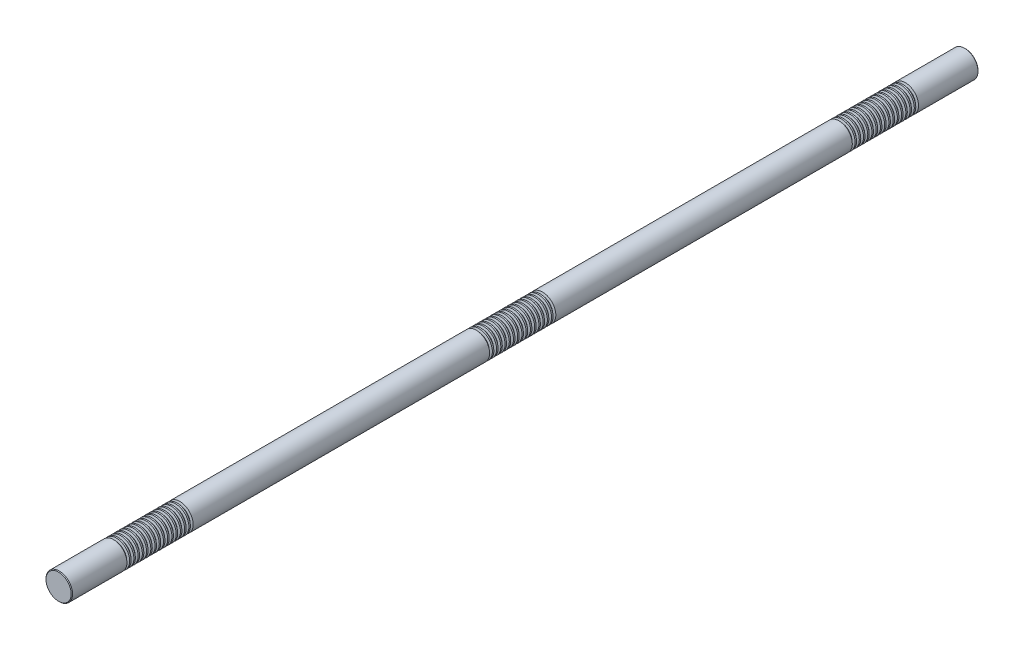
ISO-10303-21;
HEADER;
FILE_DESCRIPTION(('STEP AP214'),'2;1');
FILE_NAME('part.step','',(''),(''),'','','');
FILE_SCHEMA(('AUTOMOTIVE_DESIGN { 1 0 10303 214 1 1 1 1 }'));
ENDSEC;
DATA;
#1=APPLICATION_CONTEXT('core data for automotive mechanical design processes');
#2=APPLICATION_PROTOCOL_DEFINITION('international standard','automotive_design',2000,#1);
#3=PRODUCT_CONTEXT('',#1,'mechanical');
#4=PRODUCT('Part','Part','',(#3));
#5=PRODUCT_RELATED_PRODUCT_CATEGORY('part','',(#4));
#6=PRODUCT_DEFINITION_FORMATION('','',#4);
#7=PRODUCT_DEFINITION_CONTEXT('part definition',#1,'design');
#8=PRODUCT_DEFINITION('design','',#6,#7);
#9=PRODUCT_DEFINITION_SHAPE('','',#8);
#10=(LENGTH_UNIT() NAMED_UNIT(*) SI_UNIT(.MILLI.,.METRE.));
#11=(NAMED_UNIT(*) PLANE_ANGLE_UNIT() SI_UNIT($,.RADIAN.));
#12=(NAMED_UNIT(*) SI_UNIT($,.STERADIAN.) SOLID_ANGLE_UNIT());
#13=UNCERTAINTY_MEASURE_WITH_UNIT(LENGTH_MEASURE(1.E-05),#10,'distance_accuracy_value','');
#14=(GEOMETRIC_REPRESENTATION_CONTEXT(3) GLOBAL_UNCERTAINTY_ASSIGNED_CONTEXT((#13)) GLOBAL_UNIT_ASSIGNED_CONTEXT((#10,
#11,#12)) REPRESENTATION_CONTEXT('',''));
#15=CARTESIAN_POINT('',(0.,0.,0.));
#16=DIRECTION('',(0.,0.,1.));
#17=DIRECTION('',(1.,0.,0.));
#18=AXIS2_PLACEMENT_3D('',#15,#16,#17);
#19=CARTESIAN_POINT('',(0.,0.,750.));
#20=DIRECTION('',(0.,0.,-1.));
#21=DIRECTION('',(-1.,0.,0.));
#22=AXIS2_PLACEMENT_3D('',#19,#20,#21);
#23=CYLINDRICAL_SURFACE('',#22,22.);
#24=CARTESIAN_POINT('',(0.,0.,652.035898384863));
#25=DIRECTION('',(0.,0.,1.));
#26=DIRECTION('',(1.,0.,0.));
#27=AXIS2_PLACEMENT_3D('',#24,#25,#26);
#28=CIRCLE('',#27,22.);
#29=CARTESIAN_POINT('',(22.,0.,652.035898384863));
#30=VERTEX_POINT('',#29);
#31=EDGE_CURVE('E802',#30,#30,#28,.T.);
#32=ORIENTED_EDGE('',*,*,#31,.T.);
#33=EDGE_LOOP('',(#32));
#34=FACE_BOUND('',#33,.T.);
#35=CARTESIAN_POINT('',(0.,0.,654.464101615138));
#36=DIRECTION('',(0.,0.,1.));
#37=DIRECTION('',(1.,0.,0.));
#38=AXIS2_PLACEMENT_3D('',#35,#36,#37);
#39=CIRCLE('',#38,22.);
#40=CARTESIAN_POINT('',(22.,0.,654.464101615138));
#41=VERTEX_POINT('',#40);
#42=EDGE_CURVE('E813',#41,#41,#39,.T.);
#43=ORIENTED_EDGE('',*,*,#42,.F.);
#44=EDGE_LOOP('',(#43));
#45=FACE_BOUND('',#44,.T.);
#46=ADVANCED_FACE('F37',(#34,#45),#23,.T.);
#47=CARTESIAN_POINT('',(0.,0.,645.035898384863));
#48=DIRECTION('',(0.,0.,1.));
#49=DIRECTION('',(1.,0.,0.));
#50=AXIS2_PLACEMENT_3D('',#47,#48,#49);
#51=CIRCLE('',#50,22.);
#52=CARTESIAN_POINT('',(22.,0.,645.035898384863));
#53=VERTEX_POINT('',#52);
#54=EDGE_CURVE('E786',#53,#53,#51,.T.);
#55=ORIENTED_EDGE('',*,*,#54,.T.);
#56=EDGE_LOOP('',(#55));
#57=FACE_BOUND('',#56,.T.);
#58=CARTESIAN_POINT('',(0.,0.,647.464101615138));
#59=DIRECTION('',(0.,0.,1.));
#60=DIRECTION('',(1.,0.,0.));
#61=AXIS2_PLACEMENT_3D('',#58,#59,#60);
#62=CIRCLE('',#61,22.);
#63=CARTESIAN_POINT('',(22.,0.,647.464101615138));
#64=VERTEX_POINT('',#63);
#65=EDGE_CURVE('E798',#64,#64,#62,.T.);
#66=ORIENTED_EDGE('',*,*,#65,.F.);
#67=EDGE_LOOP('',(#66));
#68=FACE_BOUND('',#67,.T.);
#69=ADVANCED_FACE('F849',(#57,#68),#23,.T.);
#70=CARTESIAN_POINT('',(0.,0.,638.035898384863));
#71=DIRECTION('',(0.,0.,1.));
#72=DIRECTION('',(1.,0.,0.));
#73=AXIS2_PLACEMENT_3D('',#70,#71,#72);
#74=CIRCLE('',#73,22.);
#75=CARTESIAN_POINT('',(22.,0.,638.035898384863));
#76=VERTEX_POINT('',#75);
#77=EDGE_CURVE('E771',#76,#76,#74,.T.);
#78=ORIENTED_EDGE('',*,*,#77,.T.);
#79=EDGE_LOOP('',(#78));
#80=FACE_BOUND('',#79,.T.);
#81=CARTESIAN_POINT('',(0.,0.,640.464101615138));
#82=DIRECTION('',(0.,0.,1.));
#83=DIRECTION('',(1.,0.,0.));
#84=AXIS2_PLACEMENT_3D('',#81,#82,#83);
#85=CIRCLE('',#84,22.);
#86=CARTESIAN_POINT('',(22.,0.,640.464101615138));
#87=VERTEX_POINT('',#86);
#88=EDGE_CURVE('E782',#87,#87,#85,.T.);
#89=ORIENTED_EDGE('',*,*,#88,.F.);
#90=EDGE_LOOP('',(#89));
#91=FACE_BOUND('',#90,.T.);
#92=ADVANCED_FACE('F857',(#80,#91),#23,.T.);
#93=CARTESIAN_POINT('',(0.,0.,631.035898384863));
#94=DIRECTION('',(0.,0.,1.));
#95=DIRECTION('',(1.,0.,0.));
#96=AXIS2_PLACEMENT_3D('',#93,#94,#95);
#97=CIRCLE('',#96,22.);
#98=CARTESIAN_POINT('',(22.,0.,631.035898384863));
#99=VERTEX_POINT('',#98);
#100=EDGE_CURVE('E755',#99,#99,#97,.T.);
#101=ORIENTED_EDGE('',*,*,#100,.T.);
#102=EDGE_LOOP('',(#101));
#103=FACE_BOUND('',#102,.T.);
#104=CARTESIAN_POINT('',(0.,0.,633.464101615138));
#105=DIRECTION('',(0.,0.,1.));
#106=DIRECTION('',(1.,0.,0.));
#107=AXIS2_PLACEMENT_3D('',#104,#105,#106);
#108=CIRCLE('',#107,22.);
#109=CARTESIAN_POINT('',(22.,0.,633.464101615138));
#110=VERTEX_POINT('',#109);
#111=EDGE_CURVE('E767',#110,#110,#108,.T.);
#112=ORIENTED_EDGE('',*,*,#111,.F.);
#113=EDGE_LOOP('',(#112));
#114=FACE_BOUND('',#113,.T.);
#115=ADVANCED_FACE('F1864',(#103,#114),#23,.T.);
#116=CARTESIAN_POINT('',(0.,0.,624.035898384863));
#117=DIRECTION('',(0.,0.,1.));
#118=DIRECTION('',(1.,0.,0.));
#119=AXIS2_PLACEMENT_3D('',#116,#117,#118);
#120=CIRCLE('',#119,22.);
#121=CARTESIAN_POINT('',(22.,0.,624.035898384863));
#122=VERTEX_POINT('',#121);
#123=EDGE_CURVE('E739',#122,#122,#120,.T.);
#124=ORIENTED_EDGE('',*,*,#123,.T.);
#125=EDGE_LOOP('',(#124));
#126=FACE_BOUND('',#125,.T.);
#127=CARTESIAN_POINT('',(0.,0.,626.464101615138));
#128=DIRECTION('',(0.,0.,1.));
#129=DIRECTION('',(1.,0.,0.));
#130=AXIS2_PLACEMENT_3D('',#127,#128,#129);
#131=CIRCLE('',#130,22.);
#132=CARTESIAN_POINT('',(22.,0.,626.464101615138));
#133=VERTEX_POINT('',#132);
#134=EDGE_CURVE('E751',#133,#133,#131,.T.);
#135=ORIENTED_EDGE('',*,*,#134,.F.);
#136=EDGE_LOOP('',(#135));
#137=FACE_BOUND('',#136,.T.);
#138=ADVANCED_FACE('F1841',(#126,#137),#23,.T.);
#139=CARTESIAN_POINT('',(0.,0.,617.035898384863));
#140=DIRECTION('',(0.,0.,1.));
#141=DIRECTION('',(1.,0.,0.));
#142=AXIS2_PLACEMENT_3D('',#139,#140,#141);
#143=CIRCLE('',#142,22.);
#144=CARTESIAN_POINT('',(22.,0.,617.035898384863));
#145=VERTEX_POINT('',#144);
#146=EDGE_CURVE('E723',#145,#145,#143,.T.);
#147=ORIENTED_EDGE('',*,*,#146,.T.);
#148=EDGE_LOOP('',(#147));
#149=FACE_BOUND('',#148,.T.);
#150=CARTESIAN_POINT('',(0.,0.,619.464101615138));
#151=DIRECTION('',(0.,0.,1.));
#152=DIRECTION('',(1.,0.,0.));
#153=AXIS2_PLACEMENT_3D('',#150,#151,#152);
#154=CIRCLE('',#153,22.);
#155=CARTESIAN_POINT('',(22.,0.,619.464101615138));
#156=VERTEX_POINT('',#155);
#157=EDGE_CURVE('E735',#156,#156,#154,.T.);
#158=ORIENTED_EDGE('',*,*,#157,.F.);
#159=EDGE_LOOP('',(#158));
#160=FACE_BOUND('',#159,.T.);
#161=ADVANCED_FACE('F1818',(#149,#160),#23,.T.);
#162=CARTESIAN_POINT('',(0.,0.,610.035898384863));
#163=DIRECTION('',(0.,0.,1.));
#164=DIRECTION('',(1.,0.,0.));
#165=AXIS2_PLACEMENT_3D('',#162,#163,#164);
#166=CIRCLE('',#165,22.);
#167=CARTESIAN_POINT('',(22.,0.,610.035898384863));
#168=VERTEX_POINT('',#167);
#169=EDGE_CURVE('E707',#168,#168,#166,.T.);
#170=ORIENTED_EDGE('',*,*,#169,.T.);
#171=EDGE_LOOP('',(#170));
#172=FACE_BOUND('',#171,.T.);
#173=CARTESIAN_POINT('',(0.,0.,612.464101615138));
#174=DIRECTION('',(0.,0.,1.));
#175=DIRECTION('',(1.,0.,0.));
#176=AXIS2_PLACEMENT_3D('',#173,#174,#175);
#177=CIRCLE('',#176,22.);
#178=CARTESIAN_POINT('',(22.,0.,612.464101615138));
#179=VERTEX_POINT('',#178);
#180=EDGE_CURVE('E719',#179,#179,#177,.T.);
#181=ORIENTED_EDGE('',*,*,#180,.F.);
#182=EDGE_LOOP('',(#181));
#183=FACE_BOUND('',#182,.T.);
#184=ADVANCED_FACE('F1795',(#172,#183),#23,.T.);
#185=CARTESIAN_POINT('',(0.,0.,603.035898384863));
#186=DIRECTION('',(0.,0.,1.));
#187=DIRECTION('',(1.,0.,0.));
#188=AXIS2_PLACEMENT_3D('',#185,#186,#187);
#189=CIRCLE('',#188,22.);
#190=CARTESIAN_POINT('',(22.,0.,603.035898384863));
#191=VERTEX_POINT('',#190);
#192=EDGE_CURVE('E691',#191,#191,#189,.T.);
#193=ORIENTED_EDGE('',*,*,#192,.T.);
#194=EDGE_LOOP('',(#193));
#195=FACE_BOUND('',#194,.T.);
#196=CARTESIAN_POINT('',(0.,0.,605.464101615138));
#197=DIRECTION('',(0.,0.,1.));
#198=DIRECTION('',(1.,0.,0.));
#199=AXIS2_PLACEMENT_3D('',#196,#197,#198);
#200=CIRCLE('',#199,22.);
#201=CARTESIAN_POINT('',(22.,0.,605.464101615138));
#202=VERTEX_POINT('',#201);
#203=EDGE_CURVE('E703',#202,#202,#200,.T.);
#204=ORIENTED_EDGE('',*,*,#203,.F.);
#205=EDGE_LOOP('',(#204));
#206=FACE_BOUND('',#205,.T.);
#207=ADVANCED_FACE('F1772',(#195,#206),#23,.T.);
#208=CARTESIAN_POINT('',(0.,0.,596.035898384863));
#209=DIRECTION('',(0.,0.,1.));
#210=DIRECTION('',(1.,0.,0.));
#211=AXIS2_PLACEMENT_3D('',#208,#209,#210);
#212=CIRCLE('',#211,22.);
#213=CARTESIAN_POINT('',(22.,0.,596.035898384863));
#214=VERTEX_POINT('',#213);
#215=EDGE_CURVE('E675',#214,#214,#212,.T.);
#216=ORIENTED_EDGE('',*,*,#215,.T.);
#217=EDGE_LOOP('',(#216));
#218=FACE_BOUND('',#217,.T.);
#219=CARTESIAN_POINT('',(0.,0.,598.464101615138));
#220=DIRECTION('',(0.,0.,1.));
#221=DIRECTION('',(1.,0.,0.));
#222=AXIS2_PLACEMENT_3D('',#219,#220,#221);
#223=CIRCLE('',#222,22.);
#224=CARTESIAN_POINT('',(22.,0.,598.464101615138));
#225=VERTEX_POINT('',#224);
#226=EDGE_CURVE('E687',#225,#225,#223,.T.);
#227=ORIENTED_EDGE('',*,*,#226,.F.);
#228=EDGE_LOOP('',(#227));
#229=FACE_BOUND('',#228,.T.);
#230=ADVANCED_FACE('F1749',(#218,#229),#23,.T.);
#231=CARTESIAN_POINT('',(0.,0.,589.035898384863));
#232=DIRECTION('',(0.,0.,1.));
#233=DIRECTION('',(1.,0.,0.));
#234=AXIS2_PLACEMENT_3D('',#231,#232,#233);
#235=CIRCLE('',#234,22.);
#236=CARTESIAN_POINT('',(22.,0.,589.035898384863));
#237=VERTEX_POINT('',#236);
#238=EDGE_CURVE('E659',#237,#237,#235,.T.);
#239=ORIENTED_EDGE('',*,*,#238,.T.);
#240=EDGE_LOOP('',(#239));
#241=FACE_BOUND('',#240,.T.);
#242=CARTESIAN_POINT('',(0.,0.,591.464101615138));
#243=DIRECTION('',(0.,0.,1.));
#244=DIRECTION('',(1.,0.,0.));
#245=AXIS2_PLACEMENT_3D('',#242,#243,#244);
#246=CIRCLE('',#245,22.);
#247=CARTESIAN_POINT('',(22.,0.,591.464101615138));
#248=VERTEX_POINT('',#247);
#249=EDGE_CURVE('E671',#248,#248,#246,.T.);
#250=ORIENTED_EDGE('',*,*,#249,.F.);
#251=EDGE_LOOP('',(#250));
#252=FACE_BOUND('',#251,.T.);
#253=ADVANCED_FACE('F1726',(#241,#252),#23,.T.);
#254=CARTESIAN_POINT('',(0.,0.,582.035898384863));
#255=DIRECTION('',(0.,0.,1.));
#256=DIRECTION('',(1.,0.,0.));
#257=AXIS2_PLACEMENT_3D('',#254,#255,#256);
#258=CIRCLE('',#257,22.);
#259=CARTESIAN_POINT('',(22.,0.,582.035898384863));
#260=VERTEX_POINT('',#259);
#261=EDGE_CURVE('E643',#260,#260,#258,.T.);
#262=ORIENTED_EDGE('',*,*,#261,.T.);
#263=EDGE_LOOP('',(#262));
#264=FACE_BOUND('',#263,.T.);
#265=CARTESIAN_POINT('',(0.,0.,584.464101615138));
#266=DIRECTION('',(0.,0.,1.));
#267=DIRECTION('',(1.,0.,0.));
#268=AXIS2_PLACEMENT_3D('',#265,#266,#267);
#269=CIRCLE('',#268,22.);
#270=CARTESIAN_POINT('',(22.,0.,584.464101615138));
#271=VERTEX_POINT('',#270);
#272=EDGE_CURVE('E655',#271,#271,#269,.T.);
#273=ORIENTED_EDGE('',*,*,#272,.F.);
#274=EDGE_LOOP('',(#273));
#275=FACE_BOUND('',#274,.T.);
#276=ADVANCED_FACE('F1703',(#264,#275),#23,.T.);
#277=CARTESIAN_POINT('',(0.,0.,575.035898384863));
#278=DIRECTION('',(0.,0.,1.));
#279=DIRECTION('',(1.,0.,0.));
#280=AXIS2_PLACEMENT_3D('',#277,#278,#279);
#281=CIRCLE('',#280,22.);
#282=CARTESIAN_POINT('',(22.,0.,575.035898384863));
#283=VERTEX_POINT('',#282);
#284=EDGE_CURVE('E627',#283,#283,#281,.T.);
#285=ORIENTED_EDGE('',*,*,#284,.T.);
#286=EDGE_LOOP('',(#285));
#287=FACE_BOUND('',#286,.T.);
#288=CARTESIAN_POINT('',(0.,0.,577.464101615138));
#289=DIRECTION('',(0.,0.,1.));
#290=DIRECTION('',(1.,0.,0.));
#291=AXIS2_PLACEMENT_3D('',#288,#289,#290);
#292=CIRCLE('',#291,22.);
#293=CARTESIAN_POINT('',(22.,0.,577.464101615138));
#294=VERTEX_POINT('',#293);
#295=EDGE_CURVE('E639',#294,#294,#292,.T.);
#296=ORIENTED_EDGE('',*,*,#295,.F.);
#297=EDGE_LOOP('',(#296));
#298=FACE_BOUND('',#297,.T.);
#299=ADVANCED_FACE('F1680',(#287,#298),#23,.T.);
#300=CARTESIAN_POINT('',(0.,0.,568.035898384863));
#301=DIRECTION('',(0.,0.,1.));
#302=DIRECTION('',(1.,0.,0.));
#303=AXIS2_PLACEMENT_3D('',#300,#301,#302);
#304=CIRCLE('',#303,22.);
#305=CARTESIAN_POINT('',(22.,0.,568.035898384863));
#306=VERTEX_POINT('',#305);
#307=EDGE_CURVE('E611',#306,#306,#304,.T.);
#308=ORIENTED_EDGE('',*,*,#307,.T.);
#309=EDGE_LOOP('',(#308));
#310=FACE_BOUND('',#309,.T.);
#311=CARTESIAN_POINT('',(0.,0.,570.464101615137));
#312=DIRECTION('',(0.,0.,1.));
#313=DIRECTION('',(1.,0.,0.));
#314=AXIS2_PLACEMENT_3D('',#311,#312,#313);
#315=CIRCLE('',#314,22.);
#316=CARTESIAN_POINT('',(22.,0.,570.464101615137));
#317=VERTEX_POINT('',#316);
#318=EDGE_CURVE('E623',#317,#317,#315,.T.);
#319=ORIENTED_EDGE('',*,*,#318,.F.);
#320=EDGE_LOOP('',(#319));
#321=FACE_BOUND('',#320,.T.);
#322=ADVANCED_FACE('F1657',(#310,#321),#23,.T.);
#323=CARTESIAN_POINT('',(0.,0.,561.035898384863));
#324=DIRECTION('',(0.,0.,1.));
#325=DIRECTION('',(1.,0.,0.));
#326=AXIS2_PLACEMENT_3D('',#323,#324,#325);
#327=CIRCLE('',#326,22.);
#328=CARTESIAN_POINT('',(22.,0.,561.035898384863));
#329=VERTEX_POINT('',#328);
#330=EDGE_CURVE('E595',#329,#329,#327,.T.);
#331=ORIENTED_EDGE('',*,*,#330,.T.);
#332=EDGE_LOOP('',(#331));
#333=FACE_BOUND('',#332,.T.);
#334=CARTESIAN_POINT('',(0.,0.,563.464101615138));
#335=DIRECTION('',(0.,0.,1.));
#336=DIRECTION('',(1.,0.,0.));
#337=AXIS2_PLACEMENT_3D('',#334,#335,#336);
#338=CIRCLE('',#337,22.);
#339=CARTESIAN_POINT('',(22.,0.,563.464101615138));
#340=VERTEX_POINT('',#339);
#341=EDGE_CURVE('E607',#340,#340,#338,.T.);
#342=ORIENTED_EDGE('',*,*,#341,.F.);
#343=EDGE_LOOP('',(#342));
#344=FACE_BOUND('',#343,.T.);
#345=ADVANCED_FACE('F1638',(#333,#344),#23,.T.);
#346=CARTESIAN_POINT('',(0.,0.,554.035898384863));
#347=DIRECTION('',(0.,0.,1.));
#348=DIRECTION('',(1.,0.,0.));
#349=AXIS2_PLACEMENT_3D('',#346,#347,#348);
#350=CIRCLE('',#349,22.);
#351=CARTESIAN_POINT('',(22.,0.,554.035898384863));
#352=VERTEX_POINT('',#351);
#353=EDGE_CURVE('E339',#352,#352,#350,.T.);
#354=ORIENTED_EDGE('',*,*,#353,.T.);
#355=EDGE_LOOP('',(#354));
#356=FACE_BOUND('',#355,.T.);
#357=CARTESIAN_POINT('',(0.,0.,556.464101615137));
#358=DIRECTION('',(0.,0.,1.));
#359=DIRECTION('',(1.,0.,0.));
#360=AXIS2_PLACEMENT_3D('',#357,#358,#359);
#361=CIRCLE('',#360,22.);
#362=CARTESIAN_POINT('',(22.,0.,556.464101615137));
#363=VERTEX_POINT('',#362);
#364=EDGE_CURVE('E591',#363,#363,#361,.T.);
#365=ORIENTED_EDGE('',*,*,#364,.F.);
#366=EDGE_LOOP('',(#365));
#367=FACE_BOUND('',#366,.T.);
#368=ADVANCED_FACE('F1587',(#356,#367),#23,.T.);
#369=CARTESIAN_POINT('',(0.,0.,52.0358983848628));
#370=DIRECTION('',(0.,0.,1.));
#371=DIRECTION('',(1.,0.,0.));
#372=AXIS2_PLACEMENT_3D('',#369,#370,#371);
#373=CIRCLE('',#372,22.);
#374=CARTESIAN_POINT('',(22.,0.,52.0358983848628));
#375=VERTEX_POINT('',#374);
#376=EDGE_CURVE('E563',#375,#375,#373,.T.);
#377=ORIENTED_EDGE('',*,*,#376,.T.);
#378=EDGE_LOOP('',(#377));
#379=FACE_BOUND('',#378,.T.);
#380=CARTESIAN_POINT('',(0.,0.,54.4641016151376));
#381=DIRECTION('',(0.,0.,1.));
#382=DIRECTION('',(1.,0.,0.));
#383=AXIS2_PLACEMENT_3D('',#380,#381,#382);
#384=CIRCLE('',#383,22.);
#385=CARTESIAN_POINT('',(22.,0.,54.4641016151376));
#386=VERTEX_POINT('',#385);
#387=EDGE_CURVE('E575',#386,#386,#384,.T.);
#388=ORIENTED_EDGE('',*,*,#387,.F.);
#389=EDGE_LOOP('',(#388));
#390=FACE_BOUND('',#389,.T.);
#391=ADVANCED_FACE('F1563',(#379,#390),#23,.T.);
#392=CARTESIAN_POINT('',(0.,0.,45.0358983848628));
#393=DIRECTION('',(0.,0.,1.));
#394=DIRECTION('',(1.,0.,0.));
#395=AXIS2_PLACEMENT_3D('',#392,#393,#394);
#396=CIRCLE('',#395,22.);
#397=CARTESIAN_POINT('',(22.,0.,45.0358983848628));
#398=VERTEX_POINT('',#397);
#399=EDGE_CURVE('E547',#398,#398,#396,.T.);
#400=ORIENTED_EDGE('',*,*,#399,.T.);
#401=EDGE_LOOP('',(#400));
#402=FACE_BOUND('',#401,.T.);
#403=CARTESIAN_POINT('',(0.,0.,47.4641016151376));
#404=DIRECTION('',(0.,0.,1.));
#405=DIRECTION('',(1.,0.,0.));
#406=AXIS2_PLACEMENT_3D('',#403,#404,#405);
#407=CIRCLE('',#406,22.);
#408=CARTESIAN_POINT('',(22.,0.,47.4641016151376));
#409=VERTEX_POINT('',#408);
#410=EDGE_CURVE('E559',#409,#409,#407,.T.);
#411=ORIENTED_EDGE('',*,*,#410,.F.);
#412=EDGE_LOOP('',(#411));
#413=FACE_BOUND('',#412,.T.);
#414=ADVANCED_FACE('F1540',(#402,#413),#23,.T.);
#415=CARTESIAN_POINT('',(0.,0.,38.0358983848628));
#416=DIRECTION('',(0.,0.,1.));
#417=DIRECTION('',(1.,0.,0.));
#418=AXIS2_PLACEMENT_3D('',#415,#416,#417);
#419=CIRCLE('',#418,22.);
#420=CARTESIAN_POINT('',(22.,0.,38.0358983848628));
#421=VERTEX_POINT('',#420);
#422=EDGE_CURVE('E531',#421,#421,#419,.T.);
#423=ORIENTED_EDGE('',*,*,#422,.T.);
#424=EDGE_LOOP('',(#423));
#425=FACE_BOUND('',#424,.T.);
#426=CARTESIAN_POINT('',(0.,0.,40.4641016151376));
#427=DIRECTION('',(0.,0.,1.));
#428=DIRECTION('',(1.,0.,0.));
#429=AXIS2_PLACEMENT_3D('',#426,#427,#428);
#430=CIRCLE('',#429,22.);
#431=CARTESIAN_POINT('',(22.,0.,40.4641016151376));
#432=VERTEX_POINT('',#431);
#433=EDGE_CURVE('E543',#432,#432,#430,.T.);
#434=ORIENTED_EDGE('',*,*,#433,.F.);
#435=EDGE_LOOP('',(#434));
#436=FACE_BOUND('',#435,.T.);
#437=ADVANCED_FACE('F1517',(#425,#436),#23,.T.);
#438=CARTESIAN_POINT('',(0.,0.,31.0358983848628));
#439=DIRECTION('',(0.,0.,1.));
#440=DIRECTION('',(1.,0.,0.));
#441=AXIS2_PLACEMENT_3D('',#438,#439,#440);
#442=CIRCLE('',#441,22.);
#443=CARTESIAN_POINT('',(22.,0.,31.0358983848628));
#444=VERTEX_POINT('',#443);
#445=EDGE_CURVE('E515',#444,#444,#442,.T.);
#446=ORIENTED_EDGE('',*,*,#445,.T.);
#447=EDGE_LOOP('',(#446));
#448=FACE_BOUND('',#447,.T.);
#449=CARTESIAN_POINT('',(0.,0.,33.4641016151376));
#450=DIRECTION('',(0.,0.,1.));
#451=DIRECTION('',(1.,0.,0.));
#452=AXIS2_PLACEMENT_3D('',#449,#450,#451);
#453=CIRCLE('',#452,22.);
#454=CARTESIAN_POINT('',(22.,0.,33.4641016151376));
#455=VERTEX_POINT('',#454);
#456=EDGE_CURVE('E527',#455,#455,#453,.T.);
#457=ORIENTED_EDGE('',*,*,#456,.F.);
#458=EDGE_LOOP('',(#457));
#459=FACE_BOUND('',#458,.T.);
#460=ADVANCED_FACE('F1494',(#448,#459),#23,.T.);
#461=CARTESIAN_POINT('',(0.,0.,24.0358983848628));
#462=DIRECTION('',(0.,0.,1.));
#463=DIRECTION('',(1.,0.,0.));
#464=AXIS2_PLACEMENT_3D('',#461,#462,#463);
#465=CIRCLE('',#464,22.);
#466=CARTESIAN_POINT('',(22.,0.,24.0358983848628));
#467=VERTEX_POINT('',#466);
#468=EDGE_CURVE('E499',#467,#467,#465,.T.);
#469=ORIENTED_EDGE('',*,*,#468,.T.);
#470=EDGE_LOOP('',(#469));
#471=FACE_BOUND('',#470,.T.);
#472=CARTESIAN_POINT('',(0.,0.,26.4641016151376));
#473=DIRECTION('',(0.,0.,1.));
#474=DIRECTION('',(1.,0.,0.));
#475=AXIS2_PLACEMENT_3D('',#472,#473,#474);
#476=CIRCLE('',#475,22.);
#477=CARTESIAN_POINT('',(22.,0.,26.4641016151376));
#478=VERTEX_POINT('',#477);
#479=EDGE_CURVE('E511',#478,#478,#476,.T.);
#480=ORIENTED_EDGE('',*,*,#479,.F.);
#481=EDGE_LOOP('',(#480));
#482=FACE_BOUND('',#481,.T.);
#483=ADVANCED_FACE('F1471',(#471,#482),#23,.T.);
#484=CARTESIAN_POINT('',(0.,0.,17.0358983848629));
#485=DIRECTION('',(0.,0.,1.));
#486=DIRECTION('',(1.,0.,0.));
#487=AXIS2_PLACEMENT_3D('',#484,#485,#486);
#488=CIRCLE('',#487,22.);
#489=CARTESIAN_POINT('',(22.,0.,17.0358983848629));
#490=VERTEX_POINT('',#489);
#491=EDGE_CURVE('E483',#490,#490,#488,.T.);
#492=ORIENTED_EDGE('',*,*,#491,.T.);
#493=EDGE_LOOP('',(#492));
#494=FACE_BOUND('',#493,.T.);
#495=CARTESIAN_POINT('',(0.,0.,19.4641016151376));
#496=DIRECTION('',(0.,0.,1.));
#497=DIRECTION('',(1.,0.,0.));
#498=AXIS2_PLACEMENT_3D('',#495,#496,#497);
#499=CIRCLE('',#498,22.);
#500=CARTESIAN_POINT('',(22.,0.,19.4641016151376));
#501=VERTEX_POINT('',#500);
#502=EDGE_CURVE('E495',#501,#501,#499,.T.);
#503=ORIENTED_EDGE('',*,*,#502,.F.);
#504=EDGE_LOOP('',(#503));
#505=FACE_BOUND('',#504,.T.);
#506=ADVANCED_FACE('F1448',(#494,#505),#23,.T.);
#507=CARTESIAN_POINT('',(0.,0.,10.0358983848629));
#508=DIRECTION('',(0.,0.,1.));
#509=DIRECTION('',(1.,0.,0.));
#510=AXIS2_PLACEMENT_3D('',#507,#508,#509);
#511=CIRCLE('',#510,22.);
#512=CARTESIAN_POINT('',(22.,0.,10.0358983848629));
#513=VERTEX_POINT('',#512);
#514=EDGE_CURVE('E467',#513,#513,#511,.T.);
#515=ORIENTED_EDGE('',*,*,#514,.T.);
#516=EDGE_LOOP('',(#515));
#517=FACE_BOUND('',#516,.T.);
#518=CARTESIAN_POINT('',(0.,0.,12.4641016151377));
#519=DIRECTION('',(0.,0.,1.));
#520=DIRECTION('',(1.,0.,0.));
#521=AXIS2_PLACEMENT_3D('',#518,#519,#520);
#522=CIRCLE('',#521,22.);
#523=CARTESIAN_POINT('',(22.,0.,12.4641016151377));
#524=VERTEX_POINT('',#523);
#525=EDGE_CURVE('E479',#524,#524,#522,.T.);
#526=ORIENTED_EDGE('',*,*,#525,.F.);
#527=EDGE_LOOP('',(#526));
#528=FACE_BOUND('',#527,.T.);
#529=ADVANCED_FACE('F1425',(#517,#528),#23,.T.);
#530=CARTESIAN_POINT('',(0.,0.,3.03589838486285));
#531=DIRECTION('',(0.,0.,1.));
#532=DIRECTION('',(1.,0.,0.));
#533=AXIS2_PLACEMENT_3D('',#530,#531,#532);
#534=CIRCLE('',#533,22.);
#535=CARTESIAN_POINT('',(22.,0.,3.03589838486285));
#536=VERTEX_POINT('',#535);
#537=EDGE_CURVE('E451',#536,#536,#534,.T.);
#538=ORIENTED_EDGE('',*,*,#537,.T.);
#539=EDGE_LOOP('',(#538));
#540=FACE_BOUND('',#539,.T.);
#541=CARTESIAN_POINT('',(0.,0.,5.46410161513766));
#542=DIRECTION('',(0.,0.,1.));
#543=DIRECTION('',(1.,0.,0.));
#544=AXIS2_PLACEMENT_3D('',#541,#542,#543);
#545=CIRCLE('',#544,22.);
#546=CARTESIAN_POINT('',(22.,0.,5.46410161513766));
#547=VERTEX_POINT('',#546);
#548=EDGE_CURVE('E463',#547,#547,#545,.T.);
#549=ORIENTED_EDGE('',*,*,#548,.F.);
#550=EDGE_LOOP('',(#549));
#551=FACE_BOUND('',#550,.T.);
#552=ADVANCED_FACE('F1402',(#540,#551),#23,.T.);
#553=CARTESIAN_POINT('',(0.,0.,-3.96410161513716));
#554=DIRECTION('',(0.,0.,1.));
#555=DIRECTION('',(1.,0.,0.));
#556=AXIS2_PLACEMENT_3D('',#553,#554,#555);
#557=CIRCLE('',#556,22.);
#558=CARTESIAN_POINT('',(22.,0.,-3.96410161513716));
#559=VERTEX_POINT('',#558);
#560=EDGE_CURVE('E435',#559,#559,#557,.T.);
#561=ORIENTED_EDGE('',*,*,#560,.T.);
#562=EDGE_LOOP('',(#561));
#563=FACE_BOUND('',#562,.T.);
#564=CARTESIAN_POINT('',(0.,0.,-1.53589838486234));
#565=DIRECTION('',(0.,0.,1.));
#566=DIRECTION('',(1.,0.,0.));
#567=AXIS2_PLACEMENT_3D('',#564,#565,#566);
#568=CIRCLE('',#567,22.);
#569=CARTESIAN_POINT('',(22.,0.,-1.53589838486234));
#570=VERTEX_POINT('',#569);
#571=EDGE_CURVE('E447',#570,#570,#568,.T.);
#572=ORIENTED_EDGE('',*,*,#571,.F.);
#573=EDGE_LOOP('',(#572));
#574=FACE_BOUND('',#573,.T.);
#575=ADVANCED_FACE('F1379',(#563,#574),#23,.T.);
#576=CARTESIAN_POINT('',(0.,0.,-10.9641016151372));
#577=DIRECTION('',(0.,0.,1.));
#578=DIRECTION('',(1.,0.,0.));
#579=AXIS2_PLACEMENT_3D('',#576,#577,#578);
#580=CIRCLE('',#579,22.);
#581=CARTESIAN_POINT('',(22.,0.,-10.9641016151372));
#582=VERTEX_POINT('',#581);
#583=EDGE_CURVE('E419',#582,#582,#580,.T.);
#584=ORIENTED_EDGE('',*,*,#583,.T.);
#585=EDGE_LOOP('',(#584));
#586=FACE_BOUND('',#585,.T.);
#587=CARTESIAN_POINT('',(0.,0.,-8.53589838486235));
#588=DIRECTION('',(0.,0.,1.));
#589=DIRECTION('',(1.,0.,0.));
#590=AXIS2_PLACEMENT_3D('',#587,#588,#589);
#591=CIRCLE('',#590,22.);
#592=CARTESIAN_POINT('',(22.,0.,-8.53589838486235));
#593=VERTEX_POINT('',#592);
#594=EDGE_CURVE('E431',#593,#593,#591,.T.);
#595=ORIENTED_EDGE('',*,*,#594,.F.);
#596=EDGE_LOOP('',(#595));
#597=FACE_BOUND('',#596,.T.);
#598=ADVANCED_FACE('F1356',(#586,#597),#23,.T.);
#599=CARTESIAN_POINT('',(0.,0.,-17.9641016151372));
#600=DIRECTION('',(0.,0.,1.));
#601=DIRECTION('',(1.,0.,0.));
#602=AXIS2_PLACEMENT_3D('',#599,#600,#601);
#603=CIRCLE('',#602,22.);
#604=CARTESIAN_POINT('',(22.,0.,-17.9641016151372));
#605=VERTEX_POINT('',#604);
#606=EDGE_CURVE('E403',#605,#605,#603,.T.);
#607=ORIENTED_EDGE('',*,*,#606,.T.);
#608=EDGE_LOOP('',(#607));
#609=FACE_BOUND('',#608,.T.);
#610=CARTESIAN_POINT('',(0.,0.,-15.5358983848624));
#611=DIRECTION('',(0.,0.,1.));
#612=DIRECTION('',(1.,0.,0.));
#613=AXIS2_PLACEMENT_3D('',#610,#611,#612);
#614=CIRCLE('',#613,22.);
#615=CARTESIAN_POINT('',(22.,0.,-15.5358983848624));
#616=VERTEX_POINT('',#615);
#617=EDGE_CURVE('E415',#616,#616,#614,.T.);
#618=ORIENTED_EDGE('',*,*,#617,.F.);
#619=EDGE_LOOP('',(#618));
#620=FACE_BOUND('',#619,.T.);
#621=ADVANCED_FACE('F1333',(#609,#620),#23,.T.);
#622=CARTESIAN_POINT('',(0.,0.,-24.9641016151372));
#623=DIRECTION('',(0.,0.,1.));
#624=DIRECTION('',(1.,0.,0.));
#625=AXIS2_PLACEMENT_3D('',#622,#623,#624);
#626=CIRCLE('',#625,22.);
#627=CARTESIAN_POINT('',(22.,0.,-24.9641016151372));
#628=VERTEX_POINT('',#627);
#629=EDGE_CURVE('E387',#628,#628,#626,.T.);
#630=ORIENTED_EDGE('',*,*,#629,.T.);
#631=EDGE_LOOP('',(#630));
#632=FACE_BOUND('',#631,.T.);
#633=CARTESIAN_POINT('',(0.,0.,-22.5358983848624));
#634=DIRECTION('',(0.,0.,1.));
#635=DIRECTION('',(1.,0.,0.));
#636=AXIS2_PLACEMENT_3D('',#633,#634,#635);
#637=CIRCLE('',#636,22.);
#638=CARTESIAN_POINT('',(22.,0.,-22.5358983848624));
#639=VERTEX_POINT('',#638);
#640=EDGE_CURVE('E399',#639,#639,#637,.T.);
#641=ORIENTED_EDGE('',*,*,#640,.F.);
#642=EDGE_LOOP('',(#641));
#643=FACE_BOUND('',#642,.T.);
#644=ADVANCED_FACE('F1310',(#632,#643),#23,.T.);
#645=CARTESIAN_POINT('',(0.,0.,-31.9641016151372));
#646=DIRECTION('',(0.,0.,1.));
#647=DIRECTION('',(1.,0.,0.));
#648=AXIS2_PLACEMENT_3D('',#645,#646,#647);
#649=CIRCLE('',#648,22.);
#650=CARTESIAN_POINT('',(22.,0.,-31.9641016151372));
#651=VERTEX_POINT('',#650);
#652=EDGE_CURVE('E371',#651,#651,#649,.T.);
#653=ORIENTED_EDGE('',*,*,#652,.T.);
#654=EDGE_LOOP('',(#653));
#655=FACE_BOUND('',#654,.T.);
#656=CARTESIAN_POINT('',(0.,0.,-29.5358983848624));
#657=DIRECTION('',(0.,0.,1.));
#658=DIRECTION('',(1.,0.,0.));
#659=AXIS2_PLACEMENT_3D('',#656,#657,#658);
#660=CIRCLE('',#659,22.);
#661=CARTESIAN_POINT('',(22.,0.,-29.5358983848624));
#662=VERTEX_POINT('',#661);
#663=EDGE_CURVE('E383',#662,#662,#660,.T.);
#664=ORIENTED_EDGE('',*,*,#663,.F.);
#665=EDGE_LOOP('',(#664));
#666=FACE_BOUND('',#665,.T.);
#667=ADVANCED_FACE('F1287',(#655,#666),#23,.T.);
#668=CARTESIAN_POINT('',(0.,0.,-38.9641016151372));
#669=DIRECTION('',(0.,0.,1.));
#670=DIRECTION('',(1.,0.,0.));
#671=AXIS2_PLACEMENT_3D('',#668,#669,#670);
#672=CIRCLE('',#671,22.);
#673=CARTESIAN_POINT('',(22.,0.,-38.9641016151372));
#674=VERTEX_POINT('',#673);
#675=EDGE_CURVE('E355',#674,#674,#672,.T.);
#676=ORIENTED_EDGE('',*,*,#675,.T.);
#677=EDGE_LOOP('',(#676));
#678=FACE_BOUND('',#677,.T.);
#679=CARTESIAN_POINT('',(0.,0.,-36.5358983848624));
#680=DIRECTION('',(0.,0.,1.));
#681=DIRECTION('',(1.,0.,0.));
#682=AXIS2_PLACEMENT_3D('',#679,#680,#681);
#683=CIRCLE('',#682,22.);
#684=CARTESIAN_POINT('',(22.,0.,-36.5358983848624));
#685=VERTEX_POINT('',#684);
#686=EDGE_CURVE('E367',#685,#685,#683,.T.);
#687=ORIENTED_EDGE('',*,*,#686,.F.);
#688=EDGE_LOOP('',(#687));
#689=FACE_BOUND('',#688,.T.);
#690=ADVANCED_FACE('F1264',(#678,#689),#23,.T.);
#691=CARTESIAN_POINT('',(0.,0.,-45.9641016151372));
#692=DIRECTION('',(0.,0.,1.));
#693=DIRECTION('',(1.,0.,0.));
#694=AXIS2_PLACEMENT_3D('',#691,#692,#693);
#695=CIRCLE('',#694,22.);
#696=CARTESIAN_POINT('',(22.,0.,-45.9641016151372));
#697=VERTEX_POINT('',#696);
#698=EDGE_CURVE('E323',#697,#697,#695,.T.);
#699=ORIENTED_EDGE('',*,*,#698,.T.);
#700=EDGE_LOOP('',(#699));
#701=FACE_BOUND('',#700,.T.);
#702=CARTESIAN_POINT('',(0.,0.,-43.5358983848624));
#703=DIRECTION('',(0.,0.,1.));
#704=DIRECTION('',(1.,0.,0.));
#705=AXIS2_PLACEMENT_3D('',#702,#703,#704);
#706=CIRCLE('',#705,22.);
#707=CARTESIAN_POINT('',(22.,0.,-43.5358983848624));
#708=VERTEX_POINT('',#707);
#709=EDGE_CURVE('E351',#708,#708,#706,.T.);
#710=ORIENTED_EDGE('',*,*,#709,.F.);
#711=EDGE_LOOP('',(#710));
#712=FACE_BOUND('',#711,.T.);
#713=ADVANCED_FACE('F1241',(#701,#712),#23,.T.);
#714=CARTESIAN_POINT('',(0.,0.,-540.964101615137));
#715=DIRECTION('',(0.,0.,1.));
#716=DIRECTION('',(1.,0.,0.));
#717=AXIS2_PLACEMENT_3D('',#714,#715,#716);
#718=CIRCLE('',#717,22.);
#719=CARTESIAN_POINT('',(22.,0.,-540.964101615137));
#720=VERTEX_POINT('',#719);
#721=EDGE_CURVE('E307',#720,#720,#718,.T.);
#722=ORIENTED_EDGE('',*,*,#721,.T.);
#723=EDGE_LOOP('',(#722));
#724=FACE_BOUND('',#723,.T.);
#725=CARTESIAN_POINT('',(0.,0.,-50.5358983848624));
#726=DIRECTION('',(0.,0.,1.));
#727=DIRECTION('',(1.,0.,0.));
#728=AXIS2_PLACEMENT_3D('',#725,#726,#727);
#729=CIRCLE('',#728,22.);
#730=CARTESIAN_POINT('',(22.,0.,-50.5358983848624));
#731=VERTEX_POINT('',#730);
#732=EDGE_CURVE('E319',#731,#731,#729,.T.);
#733=ORIENTED_EDGE('',*,*,#732,.F.);
#734=EDGE_LOOP('',(#733));
#735=FACE_BOUND('',#734,.T.);
#736=ADVANCED_FACE('F1218',(#724,#735),#23,.T.);
#737=CARTESIAN_POINT('',(0.,0.,-547.964101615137));
#738=DIRECTION('',(0.,0.,1.));
#739=DIRECTION('',(1.,0.,0.));
#740=AXIS2_PLACEMENT_3D('',#737,#738,#739);
#741=CIRCLE('',#740,22.);
#742=CARTESIAN_POINT('',(22.,0.,-547.964101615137));
#743=VERTEX_POINT('',#742);
#744=EDGE_CURVE('E291',#743,#743,#741,.T.);
#745=ORIENTED_EDGE('',*,*,#744,.T.);
#746=EDGE_LOOP('',(#745));
#747=FACE_BOUND('',#746,.T.);
#748=CARTESIAN_POINT('',(0.,0.,-545.535898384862));
#749=DIRECTION('',(0.,0.,1.));
#750=DIRECTION('',(1.,0.,0.));
#751=AXIS2_PLACEMENT_3D('',#748,#749,#750);
#752=CIRCLE('',#751,22.);
#753=CARTESIAN_POINT('',(22.,0.,-545.535898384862));
#754=VERTEX_POINT('',#753);
#755=EDGE_CURVE('E303',#754,#754,#752,.T.);
#756=ORIENTED_EDGE('',*,*,#755,.F.);
#757=EDGE_LOOP('',(#756));
#758=FACE_BOUND('',#757,.T.);
#759=ADVANCED_FACE('F1195',(#747,#758),#23,.T.);
#760=CARTESIAN_POINT('',(0.,0.,-554.964101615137));
#761=DIRECTION('',(0.,0.,1.));
#762=DIRECTION('',(1.,0.,0.));
#763=AXIS2_PLACEMENT_3D('',#760,#761,#762);
#764=CIRCLE('',#763,22.);
#765=CARTESIAN_POINT('',(22.,0.,-554.964101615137));
#766=VERTEX_POINT('',#765);
#767=EDGE_CURVE('E275',#766,#766,#764,.T.);
#768=ORIENTED_EDGE('',*,*,#767,.T.);
#769=EDGE_LOOP('',(#768));
#770=FACE_BOUND('',#769,.T.);
#771=CARTESIAN_POINT('',(0.,0.,-552.535898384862));
#772=DIRECTION('',(0.,0.,1.));
#773=DIRECTION('',(1.,0.,0.));
#774=AXIS2_PLACEMENT_3D('',#771,#772,#773);
#775=CIRCLE('',#774,22.);
#776=CARTESIAN_POINT('',(22.,0.,-552.535898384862));
#777=VERTEX_POINT('',#776);
#778=EDGE_CURVE('E287',#777,#777,#775,.T.);
#779=ORIENTED_EDGE('',*,*,#778,.F.);
#780=EDGE_LOOP('',(#779));
#781=FACE_BOUND('',#780,.T.);
#782=ADVANCED_FACE('F1172',(#770,#781),#23,.T.);
#783=CARTESIAN_POINT('',(0.,0.,-561.964101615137));
#784=DIRECTION('',(0.,0.,1.));
#785=DIRECTION('',(1.,0.,0.));
#786=AXIS2_PLACEMENT_3D('',#783,#784,#785);
#787=CIRCLE('',#786,22.);
#788=CARTESIAN_POINT('',(22.,0.,-561.964101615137));
#789=VERTEX_POINT('',#788);
#790=EDGE_CURVE('E259',#789,#789,#787,.T.);
#791=ORIENTED_EDGE('',*,*,#790,.T.);
#792=EDGE_LOOP('',(#791));
#793=FACE_BOUND('',#792,.T.);
#794=CARTESIAN_POINT('',(0.,0.,-559.535898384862));
#795=DIRECTION('',(0.,0.,1.));
#796=DIRECTION('',(1.,0.,0.));
#797=AXIS2_PLACEMENT_3D('',#794,#795,#796);
#798=CIRCLE('',#797,22.);
#799=CARTESIAN_POINT('',(22.,0.,-559.535898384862));
#800=VERTEX_POINT('',#799);
#801=EDGE_CURVE('E271',#800,#800,#798,.T.);
#802=ORIENTED_EDGE('',*,*,#801,.F.);
#803=EDGE_LOOP('',(#802));
#804=FACE_BOUND('',#803,.T.);
#805=ADVANCED_FACE('F1149',(#793,#804),#23,.T.);
#806=CARTESIAN_POINT('',(0.,0.,-568.964101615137));
#807=DIRECTION('',(0.,0.,1.));
#808=DIRECTION('',(1.,0.,0.));
#809=AXIS2_PLACEMENT_3D('',#806,#807,#808);
#810=CIRCLE('',#809,22.);
#811=CARTESIAN_POINT('',(22.,0.,-568.964101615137));
#812=VERTEX_POINT('',#811);
#813=EDGE_CURVE('E243',#812,#812,#810,.T.);
#814=ORIENTED_EDGE('',*,*,#813,.T.);
#815=EDGE_LOOP('',(#814));
#816=FACE_BOUND('',#815,.T.);
#817=CARTESIAN_POINT('',(0.,0.,-566.535898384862));
#818=DIRECTION('',(0.,0.,1.));
#819=DIRECTION('',(1.,0.,0.));
#820=AXIS2_PLACEMENT_3D('',#817,#818,#819);
#821=CIRCLE('',#820,22.);
#822=CARTESIAN_POINT('',(22.,0.,-566.535898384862));
#823=VERTEX_POINT('',#822);
#824=EDGE_CURVE('E255',#823,#823,#821,.T.);
#825=ORIENTED_EDGE('',*,*,#824,.F.);
#826=EDGE_LOOP('',(#825));
#827=FACE_BOUND('',#826,.T.);
#828=ADVANCED_FACE('F1126',(#816,#827),#23,.T.);
#829=CARTESIAN_POINT('',(0.,0.,-575.964101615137));
#830=DIRECTION('',(0.,0.,1.));
#831=DIRECTION('',(1.,0.,0.));
#832=AXIS2_PLACEMENT_3D('',#829,#830,#831);
#833=CIRCLE('',#832,22.);
#834=CARTESIAN_POINT('',(22.,0.,-575.964101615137));
#835=VERTEX_POINT('',#834);
#836=EDGE_CURVE('E227',#835,#835,#833,.T.);
#837=ORIENTED_EDGE('',*,*,#836,.T.);
#838=EDGE_LOOP('',(#837));
#839=FACE_BOUND('',#838,.T.);
#840=CARTESIAN_POINT('',(0.,0.,-573.535898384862));
#841=DIRECTION('',(0.,0.,1.));
#842=DIRECTION('',(1.,0.,0.));
#843=AXIS2_PLACEMENT_3D('',#840,#841,#842);
#844=CIRCLE('',#843,22.);
#845=CARTESIAN_POINT('',(22.,0.,-573.535898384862));
#846=VERTEX_POINT('',#845);
#847=EDGE_CURVE('E239',#846,#846,#844,.T.);
#848=ORIENTED_EDGE('',*,*,#847,.F.);
#849=EDGE_LOOP('',(#848));
#850=FACE_BOUND('',#849,.T.);
#851=ADVANCED_FACE('F1103',(#839,#850),#23,.T.);
#852=CARTESIAN_POINT('',(0.,0.,-582.964101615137));
#853=DIRECTION('',(0.,0.,1.));
#854=DIRECTION('',(1.,0.,0.));
#855=AXIS2_PLACEMENT_3D('',#852,#853,#854);
#856=CIRCLE('',#855,22.);
#857=CARTESIAN_POINT('',(22.,0.,-582.964101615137));
#858=VERTEX_POINT('',#857);
#859=EDGE_CURVE('E212',#858,#858,#856,.T.);
#860=ORIENTED_EDGE('',*,*,#859,.T.);
#861=EDGE_LOOP('',(#860));
#862=FACE_BOUND('',#861,.T.);
#863=CARTESIAN_POINT('',(0.,0.,-580.535898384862));
#864=DIRECTION('',(0.,0.,1.));
#865=DIRECTION('',(1.,0.,0.));
#866=AXIS2_PLACEMENT_3D('',#863,#864,#865);
#867=CIRCLE('',#866,22.);
#868=CARTESIAN_POINT('',(22.,0.,-580.535898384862));
#869=VERTEX_POINT('',#868);
#870=EDGE_CURVE('E223',#869,#869,#867,.T.);
#871=ORIENTED_EDGE('',*,*,#870,.F.);
#872=EDGE_LOOP('',(#871));
#873=FACE_BOUND('',#872,.T.);
#874=ADVANCED_FACE('F1080',(#862,#873),#23,.T.);
#875=CARTESIAN_POINT('',(0.,0.,-589.964101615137));
#876=DIRECTION('',(0.,0.,1.));
#877=DIRECTION('',(1.,0.,0.));
#878=AXIS2_PLACEMENT_3D('',#875,#876,#877);
#879=CIRCLE('',#878,22.);
#880=CARTESIAN_POINT('',(22.,0.,-589.964101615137));
#881=VERTEX_POINT('',#880);
#882=EDGE_CURVE('E196',#881,#881,#879,.T.);
#883=ORIENTED_EDGE('',*,*,#882,.T.);
#884=EDGE_LOOP('',(#883));
#885=FACE_BOUND('',#884,.T.);
#886=CARTESIAN_POINT('',(0.,0.,-587.535898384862));
#887=DIRECTION('',(0.,0.,1.));
#888=DIRECTION('',(1.,0.,0.));
#889=AXIS2_PLACEMENT_3D('',#886,#887,#888);
#890=CIRCLE('',#889,22.);
#891=CARTESIAN_POINT('',(22.,0.,-587.535898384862));
#892=VERTEX_POINT('',#891);
#893=EDGE_CURVE('E208',#892,#892,#890,.T.);
#894=ORIENTED_EDGE('',*,*,#893,.F.);
#895=EDGE_LOOP('',(#894));
#896=FACE_BOUND('',#895,.T.);
#897=ADVANCED_FACE('F1057',(#885,#896),#23,.T.);
#898=CARTESIAN_POINT('',(0.,0.,-596.964101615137));
#899=DIRECTION('',(0.,0.,1.));
#900=DIRECTION('',(1.,0.,0.));
#901=AXIS2_PLACEMENT_3D('',#898,#899,#900);
#902=CIRCLE('',#901,22.);
#903=CARTESIAN_POINT('',(22.,0.,-596.964101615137));
#904=VERTEX_POINT('',#903);
#905=EDGE_CURVE('E181',#904,#904,#902,.T.);
#906=ORIENTED_EDGE('',*,*,#905,.T.);
#907=EDGE_LOOP('',(#906));
#908=FACE_BOUND('',#907,.T.);
#909=CARTESIAN_POINT('',(0.,0.,-594.535898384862));
#910=DIRECTION('',(0.,0.,1.));
#911=DIRECTION('',(1.,0.,0.));
#912=AXIS2_PLACEMENT_3D('',#909,#910,#911);
#913=CIRCLE('',#912,22.);
#914=CARTESIAN_POINT('',(22.,0.,-594.535898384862));
#915=VERTEX_POINT('',#914);
#916=EDGE_CURVE('E192',#915,#915,#913,.T.);
#917=ORIENTED_EDGE('',*,*,#916,.F.);
#918=EDGE_LOOP('',(#917));
#919=FACE_BOUND('',#918,.T.);
#920=ADVANCED_FACE('F1034',(#908,#919),#23,.T.);
#921=CARTESIAN_POINT('',(0.,0.,-603.964101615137));
#922=DIRECTION('',(0.,0.,1.));
#923=DIRECTION('',(1.,0.,0.));
#924=AXIS2_PLACEMENT_3D('',#921,#922,#923);
#925=CIRCLE('',#924,22.);
#926=CARTESIAN_POINT('',(22.,0.,-603.964101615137));
#927=VERTEX_POINT('',#926);
#928=EDGE_CURVE('E165',#927,#927,#925,.T.);
#929=ORIENTED_EDGE('',*,*,#928,.T.);
#930=EDGE_LOOP('',(#929));
#931=FACE_BOUND('',#930,.T.);
#932=CARTESIAN_POINT('',(0.,0.,-601.535898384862));
#933=DIRECTION('',(0.,0.,1.));
#934=DIRECTION('',(1.,0.,0.));
#935=AXIS2_PLACEMENT_3D('',#932,#933,#934);
#936=CIRCLE('',#935,22.);
#937=CARTESIAN_POINT('',(22.,0.,-601.535898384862));
#938=VERTEX_POINT('',#937);
#939=EDGE_CURVE('E177',#938,#938,#936,.T.);
#940=ORIENTED_EDGE('',*,*,#939,.F.);
#941=EDGE_LOOP('',(#940));
#942=FACE_BOUND('',#941,.T.);
#943=ADVANCED_FACE('F1011',(#931,#942),#23,.T.);
#944=CARTESIAN_POINT('',(0.,0.,-610.964101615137));
#945=DIRECTION('',(0.,0.,1.));
#946=DIRECTION('',(1.,0.,0.));
#947=AXIS2_PLACEMENT_3D('',#944,#945,#946);
#948=CIRCLE('',#947,22.);
#949=CARTESIAN_POINT('',(22.,0.,-610.964101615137));
#950=VERTEX_POINT('',#949);
#951=EDGE_CURVE('E149',#950,#950,#948,.T.);
#952=ORIENTED_EDGE('',*,*,#951,.T.);
#953=EDGE_LOOP('',(#952));
#954=FACE_BOUND('',#953,.T.);
#955=CARTESIAN_POINT('',(0.,0.,-608.535898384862));
#956=DIRECTION('',(0.,0.,1.));
#957=DIRECTION('',(1.,0.,0.));
#958=AXIS2_PLACEMENT_3D('',#955,#956,#957);
#959=CIRCLE('',#958,22.);
#960=CARTESIAN_POINT('',(22.,0.,-608.535898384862));
#961=VERTEX_POINT('',#960);
#962=EDGE_CURVE('E161',#961,#961,#959,.T.);
#963=ORIENTED_EDGE('',*,*,#962,.F.);
#964=EDGE_LOOP('',(#963));
#965=FACE_BOUND('',#964,.T.);
#966=ADVANCED_FACE('F988',(#954,#965),#23,.T.);
#967=CARTESIAN_POINT('',(0.,0.,-617.964101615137));
#968=DIRECTION('',(0.,0.,1.));
#969=DIRECTION('',(1.,0.,0.));
#970=AXIS2_PLACEMENT_3D('',#967,#968,#969);
#971=CIRCLE('',#970,22.);
#972=CARTESIAN_POINT('',(22.,0.,-617.964101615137));
#973=VERTEX_POINT('',#972);
#974=EDGE_CURVE('E133',#973,#973,#971,.T.);
#975=ORIENTED_EDGE('',*,*,#974,.T.);
#976=EDGE_LOOP('',(#975));
#977=FACE_BOUND('',#976,.T.);
#978=CARTESIAN_POINT('',(0.,0.,-615.535898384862));
#979=DIRECTION('',(0.,0.,1.));
#980=DIRECTION('',(1.,0.,0.));
#981=AXIS2_PLACEMENT_3D('',#978,#979,#980);
#982=CIRCLE('',#981,22.);
#983=CARTESIAN_POINT('',(22.,0.,-615.535898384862));
#984=VERTEX_POINT('',#983);
#985=EDGE_CURVE('E145',#984,#984,#982,.T.);
#986=ORIENTED_EDGE('',*,*,#985,.F.);
#987=EDGE_LOOP('',(#986));
#988=FACE_BOUND('',#987,.T.);
#989=ADVANCED_FACE('F965',(#977,#988),#23,.T.);
#990=CARTESIAN_POINT('',(0.,0.,-624.964101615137));
#991=DIRECTION('',(0.,0.,1.));
#992=DIRECTION('',(1.,0.,0.));
#993=AXIS2_PLACEMENT_3D('',#990,#991,#992);
#994=CIRCLE('',#993,22.);
#995=CARTESIAN_POINT('',(22.,0.,-624.964101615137));
#996=VERTEX_POINT('',#995);
#997=EDGE_CURVE('E117',#996,#996,#994,.T.);
#998=ORIENTED_EDGE('',*,*,#997,.T.);
#999=EDGE_LOOP('',(#998));
#1000=FACE_BOUND('',#999,.T.);
#1001=CARTESIAN_POINT('',(0.,0.,-622.535898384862));
#1002=DIRECTION('',(0.,0.,1.));
#1003=DIRECTION('',(1.,0.,0.));
#1004=AXIS2_PLACEMENT_3D('',#1001,#1002,#1003);
#1005=CIRCLE('',#1004,22.);
#1006=CARTESIAN_POINT('',(22.,0.,-622.535898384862));
#1007=VERTEX_POINT('',#1006);
#1008=EDGE_CURVE('E129',#1007,#1007,#1005,.T.);
#1009=ORIENTED_EDGE('',*,*,#1008,.F.);
#1010=EDGE_LOOP('',(#1009));
#1011=FACE_BOUND('',#1010,.T.);
#1012=ADVANCED_FACE('F942',(#1000,#1011),#23,.T.);
#1013=CARTESIAN_POINT('',(0.,0.,-631.964101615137));
#1014=DIRECTION('',(0.,0.,1.));
#1015=DIRECTION('',(1.,0.,0.));
#1016=AXIS2_PLACEMENT_3D('',#1013,#1014,#1015);
#1017=CIRCLE('',#1016,22.);
#1018=CARTESIAN_POINT('',(22.,0.,-631.964101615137));
#1019=VERTEX_POINT('',#1018);
#1020=EDGE_CURVE('E101',#1019,#1019,#1017,.T.);
#1021=ORIENTED_EDGE('',*,*,#1020,.T.);
#1022=EDGE_LOOP('',(#1021));
#1023=FACE_BOUND('',#1022,.T.);
#1024=CARTESIAN_POINT('',(0.,0.,-629.535898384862));
#1025=DIRECTION('',(0.,0.,1.));
#1026=DIRECTION('',(1.,0.,0.));
#1027=AXIS2_PLACEMENT_3D('',#1024,#1025,#1026);
#1028=CIRCLE('',#1027,22.);
#1029=CARTESIAN_POINT('',(22.,0.,-629.535898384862));
#1030=VERTEX_POINT('',#1029);
#1031=EDGE_CURVE('E113',#1030,#1030,#1028,.T.);
#1032=ORIENTED_EDGE('',*,*,#1031,.F.);
#1033=EDGE_LOOP('',(#1032));
#1034=FACE_BOUND('',#1033,.T.);
#1035=ADVANCED_FACE('F919',(#1023,#1034),#23,.T.);
#1036=CARTESIAN_POINT('',(0.,0.,-638.964101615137));
#1037=DIRECTION('',(0.,0.,1.));
#1038=DIRECTION('',(1.,0.,0.));
#1039=AXIS2_PLACEMENT_3D('',#1036,#1037,#1038);
#1040=CIRCLE('',#1039,22.);
#1041=CARTESIAN_POINT('',(22.,0.,-638.964101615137));
#1042=VERTEX_POINT('',#1041);
#1043=EDGE_CURVE('E85',#1042,#1042,#1040,.T.);
#1044=ORIENTED_EDGE('',*,*,#1043,.T.);
#1045=EDGE_LOOP('',(#1044));
#1046=FACE_BOUND('',#1045,.T.);
#1047=CARTESIAN_POINT('',(0.,0.,-636.535898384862));
#1048=DIRECTION('',(0.,0.,1.));
#1049=DIRECTION('',(1.,0.,0.));
#1050=AXIS2_PLACEMENT_3D('',#1047,#1048,#1049);
#1051=CIRCLE('',#1050,22.);
#1052=CARTESIAN_POINT('',(22.,0.,-636.535898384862));
#1053=VERTEX_POINT('',#1052);
#1054=EDGE_CURVE('E97',#1053,#1053,#1051,.T.);
#1055=ORIENTED_EDGE('',*,*,#1054,.F.);
#1056=EDGE_LOOP('',(#1055));
#1057=FACE_BOUND('',#1056,.T.);
#1058=ADVANCED_FACE('F872',(#1046,#1057),#23,.T.);
#1059=CARTESIAN_POINT('',(0.,0.,-645.964101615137));
#1060=DIRECTION('',(0.,0.,1.));
#1061=DIRECTION('',(1.,0.,0.));
#1062=AXIS2_PLACEMENT_3D('',#1059,#1060,#1061);
#1063=CIRCLE('',#1062,22.);
#1064=CARTESIAN_POINT('',(22.,0.,-645.964101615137));
#1065=VERTEX_POINT('',#1064);
#1066=EDGE_CURVE('E69',#1065,#1065,#1063,.T.);
#1067=ORIENTED_EDGE('',*,*,#1066,.T.);
#1068=EDGE_LOOP('',(#1067));
#1069=FACE_BOUND('',#1068,.T.);
#1070=CARTESIAN_POINT('',(0.,0.,-643.535898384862));
#1071=DIRECTION('',(0.,0.,1.));
#1072=DIRECTION('',(1.,0.,0.));
#1073=AXIS2_PLACEMENT_3D('',#1070,#1071,#1072);
#1074=CIRCLE('',#1073,22.);
#1075=CARTESIAN_POINT('',(22.,0.,-643.535898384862));
#1076=VERTEX_POINT('',#1075);
#1077=EDGE_CURVE('E81',#1076,#1076,#1074,.T.);
#1078=ORIENTED_EDGE('',*,*,#1077,.F.);
#1079=EDGE_LOOP('',(#1078));
#1080=FACE_BOUND('',#1079,.T.);
#1081=ADVANCED_FACE('F865',(#1069,#1080),#23,.T.);
#1082=CARTESIAN_POINT('',(0.,0.,-748.9));
#1083=DIRECTION('',(0.,0.,1.));
#1084=DIRECTION('',(1.,0.,0.));
#1085=AXIS2_PLACEMENT_3D('',#1082,#1083,#1084);
#1086=CIRCLE('',#1085,22.);
#1087=CARTESIAN_POINT('',(22.,0.,-748.9));
#1088=VERTEX_POINT('',#1087);
#1089=EDGE_CURVE('E52',#1088,#1088,#1086,.T.);
#1090=ORIENTED_EDGE('',*,*,#1089,.T.);
#1091=EDGE_LOOP('',(#1090));
#1092=FACE_BOUND('',#1091,.T.);
#1093=CARTESIAN_POINT('',(0.,0.,-650.535898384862));
#1094=DIRECTION('',(0.,0.,1.));
#1095=DIRECTION('',(1.,0.,0.));
#1096=AXIS2_PLACEMENT_3D('',#1093,#1094,#1095);
#1097=CIRCLE('',#1096,22.);
#1098=CARTESIAN_POINT('',(22.,0.,-650.535898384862));
#1099=VERTEX_POINT('',#1098);
#1100=EDGE_CURVE('E65',#1099,#1099,#1097,.T.);
#1101=ORIENTED_EDGE('',*,*,#1100,.F.);
#1102=EDGE_LOOP('',(#1101));
#1103=FACE_BOUND('',#1102,.T.);
#1104=ADVANCED_FACE('F853',(#1092,#1103),#23,.T.);
#1105=CARTESIAN_POINT('',(0.,0.,-750.));
#1106=DIRECTION('',(0.,0.,1.));
#1107=DIRECTION('',(1.,0.,0.));
#1108=AXIS2_PLACEMENT_3D('',#1105,#1106,#1107);
#1109=PLANE('',#1108);
#1110=CARTESIAN_POINT('',(0.,0.,-750.));
#1111=DIRECTION('',(0.,0.,1.));
#1112=DIRECTION('',(1.,0.,0.));
#1113=AXIS2_PLACEMENT_3D('',#1110,#1111,#1112);
#1114=CIRCLE('',#1113,20.8999999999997);
#1115=CARTESIAN_POINT('',(20.8999999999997,0.,-750.));
#1116=VERTEX_POINT('',#1115);
#1117=EDGE_CURVE('E45',#1116,#1116,#1114,.F.);
#1118=ORIENTED_EDGE('',*,*,#1117,.T.);
#1119=EDGE_LOOP('',(#1118));
#1120=FACE_BOUND('',#1119,.T.);
#1121=ADVANCED_FACE('F864',(#1120),#1109,.F.);
#1122=CARTESIAN_POINT('',(0.,0.,-748.9));
#1123=DIRECTION('',(0.,0.,1.));
#1124=DIRECTION('',(1.,0.,0.));
#1125=AXIS2_PLACEMENT_3D('',#1122,#1123,#1124);
#1126=CONICAL_SURFACE('',#1125,22.,0.785398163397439);
#1127=ORIENTED_EDGE('',*,*,#1117,.F.);
#1128=EDGE_LOOP('',(#1127));
#1129=FACE_BOUND('',#1128,.T.);
#1130=ORIENTED_EDGE('',*,*,#1089,.F.);
#1131=EDGE_LOOP('',(#1130));
#1132=FACE_BOUND('',#1131,.T.);
#1133=ADVANCED_FACE('F871',(#1129,#1132),#1126,.T.);
#1134=CARTESIAN_POINT('',(0.,0.,-649.464101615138));
#1135=DIRECTION('',(0.,0.,-1.));
#1136=DIRECTION('',(-1.,0.,0.));
#1137=AXIS2_PLACEMENT_3D('',#1134,#1135,#1136);
#1138=CONICAL_SURFACE('',#1137,18.,1.30899693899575);
#1139=ORIENTED_EDGE('',*,*,#1100,.T.);
#1140=EDGE_LOOP('',(#1139));
#1141=FACE_BOUND('',#1140,.T.);
#1142=CARTESIAN_POINT('',(0.,0.,-649.464101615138));
#1143=DIRECTION('',(0.,0.,1.));
#1144=DIRECTION('',(1.,0.,0.));
#1145=AXIS2_PLACEMENT_3D('',#1142,#1143,#1144);
#1146=CIRCLE('',#1145,18.);
#1147=CARTESIAN_POINT('',(18.,0.,-649.464101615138));
#1148=VERTEX_POINT('',#1147);
#1149=EDGE_CURVE('E77',#1148,#1148,#1146,.T.);
#1150=ORIENTED_EDGE('',*,*,#1149,.F.);
#1151=EDGE_LOOP('',(#1150));
#1152=FACE_BOUND('',#1151,.T.);
#1153=ADVANCED_FACE('F878',(#1141,#1152),#1138,.T.);
#1154=CARTESIAN_POINT('',(0.,0.,-645.964101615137));
#1155=DIRECTION('',(0.,0.,1.));
#1156=DIRECTION('',(1.,0.,0.));
#1157=AXIS2_PLACEMENT_3D('',#1154,#1155,#1156);
#1158=CONICAL_SURFACE('',#1157,22.,1.30899693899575);
#1159=CARTESIAN_POINT('',(0.,0.,-647.035898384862));
#1160=DIRECTION('',(0.,0.,1.));
#1161=DIRECTION('',(1.,0.,0.));
#1162=AXIS2_PLACEMENT_3D('',#1159,#1160,#1161);
#1163=CIRCLE('',#1162,18.);
#1164=CARTESIAN_POINT('',(18.,0.,-647.035898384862));
#1165=VERTEX_POINT('',#1164);
#1166=EDGE_CURVE('E73',#1165,#1165,#1163,.T.);
#1167=ORIENTED_EDGE('',*,*,#1166,.T.);
#1168=EDGE_LOOP('',(#1167));
#1169=FACE_BOUND('',#1168,.T.);
#1170=ORIENTED_EDGE('',*,*,#1066,.F.);
#1171=EDGE_LOOP('',(#1170));
#1172=FACE_BOUND('',#1171,.T.);
#1173=ADVANCED_FACE('F881',(#1169,#1172),#1158,.T.);
#1174=CARTESIAN_POINT('',(0.,0.,748.9));
#1175=DIRECTION('',(0.,0.,1.));
#1176=DIRECTION('',(1.,0.,0.));
#1177=AXIS2_PLACEMENT_3D('',#1174,#1175,#1176);
#1178=CYLINDRICAL_SURFACE('',#1177,18.);
#1179=ORIENTED_EDGE('',*,*,#1149,.T.);
#1180=EDGE_LOOP('',(#1179));
#1181=FACE_BOUND('',#1180,.T.);
#1182=ORIENTED_EDGE('',*,*,#1166,.F.);
#1183=EDGE_LOOP('',(#1182));
#1184=FACE_BOUND('',#1183,.T.);
#1185=ADVANCED_FACE('F885',(#1181,#1184),#1178,.T.);
#1186=CARTESIAN_POINT('',(0.,0.,-642.464101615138));
#1187=DIRECTION('',(0.,0.,-1.));
#1188=DIRECTION('',(-1.,0.,0.));
#1189=AXIS2_PLACEMENT_3D('',#1186,#1187,#1188);
#1190=CONICAL_SURFACE('',#1189,18.,1.30899693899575);
#1191=ORIENTED_EDGE('',*,*,#1077,.T.);
#1192=EDGE_LOOP('',(#1191));
#1193=FACE_BOUND('',#1192,.T.);
#1194=CARTESIAN_POINT('',(0.,0.,-642.464101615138));
#1195=DIRECTION('',(0.,0.,1.));
#1196=DIRECTION('',(1.,0.,0.));
#1197=AXIS2_PLACEMENT_3D('',#1194,#1195,#1196);
#1198=CIRCLE('',#1197,18.);
#1199=CARTESIAN_POINT('',(18.,0.,-642.464101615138));
#1200=VERTEX_POINT('',#1199);
#1201=EDGE_CURVE('E93',#1200,#1200,#1198,.T.);
#1202=ORIENTED_EDGE('',*,*,#1201,.F.);
#1203=EDGE_LOOP('',(#1202));
#1204=FACE_BOUND('',#1203,.T.);
#1205=ADVANCED_FACE('F888',(#1193,#1204),#1190,.T.);
#1206=CARTESIAN_POINT('',(0.,0.,-638.964101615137));
#1207=DIRECTION('',(0.,0.,1.));
#1208=DIRECTION('',(1.,0.,0.));
#1209=AXIS2_PLACEMENT_3D('',#1206,#1207,#1208);
#1210=CONICAL_SURFACE('',#1209,22.,1.30899693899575);
#1211=CARTESIAN_POINT('',(0.,0.,-640.035898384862));
#1212=DIRECTION('',(0.,0.,1.));
#1213=DIRECTION('',(1.,0.,0.));
#1214=AXIS2_PLACEMENT_3D('',#1211,#1212,#1213);
#1215=CIRCLE('',#1214,18.);
#1216=CARTESIAN_POINT('',(18.,0.,-640.035898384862));
#1217=VERTEX_POINT('',#1216);
#1218=EDGE_CURVE('E89',#1217,#1217,#1215,.T.);
#1219=ORIENTED_EDGE('',*,*,#1218,.T.);
#1220=EDGE_LOOP('',(#1219));
#1221=FACE_BOUND('',#1220,.T.);
#1222=ORIENTED_EDGE('',*,*,#1043,.F.);
#1223=EDGE_LOOP('',(#1222));
#1224=FACE_BOUND('',#1223,.T.);
#1225=ADVANCED_FACE('F901',(#1221,#1224),#1210,.T.);
#1226=CARTESIAN_POINT('',(0.,0.,-643.535898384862));
#1227=DIRECTION('',(0.,0.,1.));
#1228=DIRECTION('',(1.,0.,0.));
#1229=AXIS2_PLACEMENT_3D('',#1226,#1227,#1228);
#1230=CYLINDRICAL_SURFACE('',#1229,18.);
#1231=ORIENTED_EDGE('',*,*,#1201,.T.);
#1232=EDGE_LOOP('',(#1231));
#1233=FACE_BOUND('',#1232,.T.);
#1234=ORIENTED_EDGE('',*,*,#1218,.F.);
#1235=EDGE_LOOP('',(#1234));
#1236=FACE_BOUND('',#1235,.T.);
#1237=ADVANCED_FACE('F905',(#1233,#1236),#1230,.T.);
#1238=CARTESIAN_POINT('',(0.,0.,-635.464101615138));
#1239=DIRECTION('',(0.,0.,-1.));
#1240=DIRECTION('',(-1.,0.,0.));
#1241=AXIS2_PLACEMENT_3D('',#1238,#1239,#1240);
#1242=CONICAL_SURFACE('',#1241,18.,1.30899693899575);
#1243=ORIENTED_EDGE('',*,*,#1054,.T.);
#1244=EDGE_LOOP('',(#1243));
#1245=FACE_BOUND('',#1244,.T.);
#1246=CARTESIAN_POINT('',(0.,0.,-635.464101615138));
#1247=DIRECTION('',(0.,0.,1.));
#1248=DIRECTION('',(1.,0.,0.));
#1249=AXIS2_PLACEMENT_3D('',#1246,#1247,#1248);
#1250=CIRCLE('',#1249,18.);
#1251=CARTESIAN_POINT('',(18.,0.,-635.464101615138));
#1252=VERTEX_POINT('',#1251);
#1253=EDGE_CURVE('E109',#1252,#1252,#1250,.T.);
#1254=ORIENTED_EDGE('',*,*,#1253,.F.);
#1255=EDGE_LOOP('',(#1254));
#1256=FACE_BOUND('',#1255,.T.);
#1257=ADVANCED_FACE('F908',(#1245,#1256),#1242,.T.);
#1258=CARTESIAN_POINT('',(0.,0.,-631.964101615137));
#1259=DIRECTION('',(0.,0.,1.));
#1260=DIRECTION('',(1.,0.,0.));
#1261=AXIS2_PLACEMENT_3D('',#1258,#1259,#1260);
#1262=CONICAL_SURFACE('',#1261,22.,1.30899693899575);
#1263=CARTESIAN_POINT('',(0.,0.,-633.035898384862));
#1264=DIRECTION('',(0.,0.,1.));
#1265=DIRECTION('',(1.,0.,0.));
#1266=AXIS2_PLACEMENT_3D('',#1263,#1264,#1265);
#1267=CIRCLE('',#1266,18.);
#1268=CARTESIAN_POINT('',(18.,0.,-633.035898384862));
#1269=VERTEX_POINT('',#1268);
#1270=EDGE_CURVE('E105',#1269,#1269,#1267,.T.);
#1271=ORIENTED_EDGE('',*,*,#1270,.T.);
#1272=EDGE_LOOP('',(#1271));
#1273=FACE_BOUND('',#1272,.T.);
#1274=ORIENTED_EDGE('',*,*,#1020,.F.);
#1275=EDGE_LOOP('',(#1274));
#1276=FACE_BOUND('',#1275,.T.);
#1277=ADVANCED_FACE('F924',(#1273,#1276),#1262,.T.);
#1278=CARTESIAN_POINT('',(0.,0.,-636.535898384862));
#1279=DIRECTION('',(0.,0.,1.));
#1280=DIRECTION('',(1.,0.,0.));
#1281=AXIS2_PLACEMENT_3D('',#1278,#1279,#1280);
#1282=CYLINDRICAL_SURFACE('',#1281,18.);
#1283=ORIENTED_EDGE('',*,*,#1253,.T.);
#1284=EDGE_LOOP('',(#1283));
#1285=FACE_BOUND('',#1284,.T.);
#1286=ORIENTED_EDGE('',*,*,#1270,.F.);
#1287=EDGE_LOOP('',(#1286));
#1288=FACE_BOUND('',#1287,.T.);
#1289=ADVANCED_FACE('F928',(#1285,#1288),#1282,.T.);
#1290=CARTESIAN_POINT('',(0.,0.,-628.464101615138));
#1291=DIRECTION('',(0.,0.,-1.));
#1292=DIRECTION('',(-1.,0.,0.));
#1293=AXIS2_PLACEMENT_3D('',#1290,#1291,#1292);
#1294=CONICAL_SURFACE('',#1293,18.,1.30899693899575);
#1295=ORIENTED_EDGE('',*,*,#1031,.T.);
#1296=EDGE_LOOP('',(#1295));
#1297=FACE_BOUND('',#1296,.T.);
#1298=CARTESIAN_POINT('',(0.,0.,-628.464101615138));
#1299=DIRECTION('',(0.,0.,1.));
#1300=DIRECTION('',(1.,0.,0.));
#1301=AXIS2_PLACEMENT_3D('',#1298,#1299,#1300);
#1302=CIRCLE('',#1301,18.);
#1303=CARTESIAN_POINT('',(18.,0.,-628.464101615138));
#1304=VERTEX_POINT('',#1303);
#1305=EDGE_CURVE('E125',#1304,#1304,#1302,.T.);
#1306=ORIENTED_EDGE('',*,*,#1305,.F.);
#1307=EDGE_LOOP('',(#1306));
#1308=FACE_BOUND('',#1307,.T.);
#1309=ADVANCED_FACE('F931',(#1297,#1308),#1294,.T.);
#1310=CARTESIAN_POINT('',(0.,0.,-624.964101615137));
#1311=DIRECTION('',(0.,0.,1.));
#1312=DIRECTION('',(1.,0.,0.));
#1313=AXIS2_PLACEMENT_3D('',#1310,#1311,#1312);
#1314=CONICAL_SURFACE('',#1313,22.,1.30899693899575);
#1315=CARTESIAN_POINT('',(0.,0.,-626.035898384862));
#1316=DIRECTION('',(0.,0.,1.));
#1317=DIRECTION('',(1.,0.,0.));
#1318=AXIS2_PLACEMENT_3D('',#1315,#1316,#1317);
#1319=CIRCLE('',#1318,18.);
#1320=CARTESIAN_POINT('',(18.,0.,-626.035898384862));
#1321=VERTEX_POINT('',#1320);
#1322=EDGE_CURVE('E121',#1321,#1321,#1319,.T.);
#1323=ORIENTED_EDGE('',*,*,#1322,.T.);
#1324=EDGE_LOOP('',(#1323));
#1325=FACE_BOUND('',#1324,.T.);
#1326=ORIENTED_EDGE('',*,*,#997,.F.);
#1327=EDGE_LOOP('',(#1326));
#1328=FACE_BOUND('',#1327,.T.);
#1329=ADVANCED_FACE('F947',(#1325,#1328),#1314,.T.);
#1330=CARTESIAN_POINT('',(0.,0.,-629.535898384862));
#1331=DIRECTION('',(0.,0.,1.));
#1332=DIRECTION('',(1.,0.,0.));
#1333=AXIS2_PLACEMENT_3D('',#1330,#1331,#1332);
#1334=CYLINDRICAL_SURFACE('',#1333,18.);
#1335=ORIENTED_EDGE('',*,*,#1305,.T.);
#1336=EDGE_LOOP('',(#1335));
#1337=FACE_BOUND('',#1336,.T.);
#1338=ORIENTED_EDGE('',*,*,#1322,.F.);
#1339=EDGE_LOOP('',(#1338));
#1340=FACE_BOUND('',#1339,.T.);
#1341=ADVANCED_FACE('F951',(#1337,#1340),#1334,.T.);
#1342=CARTESIAN_POINT('',(0.,0.,-621.464101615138));
#1343=DIRECTION('',(0.,0.,-1.));
#1344=DIRECTION('',(-1.,0.,0.));
#1345=AXIS2_PLACEMENT_3D('',#1342,#1343,#1344);
#1346=CONICAL_SURFACE('',#1345,18.,1.30899693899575);
#1347=ORIENTED_EDGE('',*,*,#1008,.T.);
#1348=EDGE_LOOP('',(#1347));
#1349=FACE_BOUND('',#1348,.T.);
#1350=CARTESIAN_POINT('',(0.,0.,-621.464101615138));
#1351=DIRECTION('',(0.,0.,1.));
#1352=DIRECTION('',(1.,0.,0.));
#1353=AXIS2_PLACEMENT_3D('',#1350,#1351,#1352);
#1354=CIRCLE('',#1353,18.);
#1355=CARTESIAN_POINT('',(18.,0.,-621.464101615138));
#1356=VERTEX_POINT('',#1355);
#1357=EDGE_CURVE('E141',#1356,#1356,#1354,.T.);
#1358=ORIENTED_EDGE('',*,*,#1357,.F.);
#1359=EDGE_LOOP('',(#1358));
#1360=FACE_BOUND('',#1359,.T.);
#1361=ADVANCED_FACE('F954',(#1349,#1360),#1346,.T.);
#1362=CARTESIAN_POINT('',(0.,0.,-617.964101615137));
#1363=DIRECTION('',(0.,0.,1.));
#1364=DIRECTION('',(1.,0.,0.));
#1365=AXIS2_PLACEMENT_3D('',#1362,#1363,#1364);
#1366=CONICAL_SURFACE('',#1365,22.,1.30899693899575);
#1367=CARTESIAN_POINT('',(0.,0.,-619.035898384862));
#1368=DIRECTION('',(0.,0.,1.));
#1369=DIRECTION('',(1.,0.,0.));
#1370=AXIS2_PLACEMENT_3D('',#1367,#1368,#1369);
#1371=CIRCLE('',#1370,18.);
#1372=CARTESIAN_POINT('',(18.,0.,-619.035898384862));
#1373=VERTEX_POINT('',#1372);
#1374=EDGE_CURVE('E137',#1373,#1373,#1371,.T.);
#1375=ORIENTED_EDGE('',*,*,#1374,.T.);
#1376=EDGE_LOOP('',(#1375));
#1377=FACE_BOUND('',#1376,.T.);
#1378=ORIENTED_EDGE('',*,*,#974,.F.);
#1379=EDGE_LOOP('',(#1378));
#1380=FACE_BOUND('',#1379,.T.);
#1381=ADVANCED_FACE('F970',(#1377,#1380),#1366,.T.);
#1382=CARTESIAN_POINT('',(0.,0.,-622.535898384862));
#1383=DIRECTION('',(0.,0.,1.));
#1384=DIRECTION('',(1.,0.,0.));
#1385=AXIS2_PLACEMENT_3D('',#1382,#1383,#1384);
#1386=CYLINDRICAL_SURFACE('',#1385,18.);
#1387=ORIENTED_EDGE('',*,*,#1357,.T.);
#1388=EDGE_LOOP('',(#1387));
#1389=FACE_BOUND('',#1388,.T.);
#1390=ORIENTED_EDGE('',*,*,#1374,.F.);
#1391=EDGE_LOOP('',(#1390));
#1392=FACE_BOUND('',#1391,.T.);
#1393=ADVANCED_FACE('F974',(#1389,#1392),#1386,.T.);
#1394=CARTESIAN_POINT('',(0.,0.,-614.464101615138));
#1395=DIRECTION('',(0.,0.,-1.));
#1396=DIRECTION('',(-1.,0.,0.));
#1397=AXIS2_PLACEMENT_3D('',#1394,#1395,#1396);
#1398=CONICAL_SURFACE('',#1397,18.,1.30899693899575);
#1399=ORIENTED_EDGE('',*,*,#985,.T.);
#1400=EDGE_LOOP('',(#1399));
#1401=FACE_BOUND('',#1400,.T.);
#1402=CARTESIAN_POINT('',(0.,0.,-614.464101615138));
#1403=DIRECTION('',(0.,0.,1.));
#1404=DIRECTION('',(1.,0.,0.));
#1405=AXIS2_PLACEMENT_3D('',#1402,#1403,#1404);
#1406=CIRCLE('',#1405,18.);
#1407=CARTESIAN_POINT('',(18.,0.,-614.464101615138));
#1408=VERTEX_POINT('',#1407);
#1409=EDGE_CURVE('E157',#1408,#1408,#1406,.T.);
#1410=ORIENTED_EDGE('',*,*,#1409,.F.);
#1411=EDGE_LOOP('',(#1410));
#1412=FACE_BOUND('',#1411,.T.);
#1413=ADVANCED_FACE('F977',(#1401,#1412),#1398,.T.);
#1414=CARTESIAN_POINT('',(0.,0.,-610.964101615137));
#1415=DIRECTION('',(0.,0.,1.));
#1416=DIRECTION('',(1.,0.,0.));
#1417=AXIS2_PLACEMENT_3D('',#1414,#1415,#1416);
#1418=CONICAL_SURFACE('',#1417,22.,1.30899693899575);
#1419=CARTESIAN_POINT('',(0.,0.,-612.035898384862));
#1420=DIRECTION('',(0.,0.,1.));
#1421=DIRECTION('',(1.,0.,0.));
#1422=AXIS2_PLACEMENT_3D('',#1419,#1420,#1421);
#1423=CIRCLE('',#1422,18.);
#1424=CARTESIAN_POINT('',(18.,0.,-612.035898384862));
#1425=VERTEX_POINT('',#1424);
#1426=EDGE_CURVE('E153',#1425,#1425,#1423,.T.);
#1427=ORIENTED_EDGE('',*,*,#1426,.T.);
#1428=EDGE_LOOP('',(#1427));
#1429=FACE_BOUND('',#1428,.T.);
#1430=ORIENTED_EDGE('',*,*,#951,.F.);
#1431=EDGE_LOOP('',(#1430));
#1432=FACE_BOUND('',#1431,.T.);
#1433=ADVANCED_FACE('F993',(#1429,#1432),#1418,.T.);
#1434=CARTESIAN_POINT('',(0.,0.,-615.535898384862));
#1435=DIRECTION('',(0.,0.,1.));
#1436=DIRECTION('',(1.,0.,0.));
#1437=AXIS2_PLACEMENT_3D('',#1434,#1435,#1436);
#1438=CYLINDRICAL_SURFACE('',#1437,18.);
#1439=ORIENTED_EDGE('',*,*,#1409,.T.);
#1440=EDGE_LOOP('',(#1439));
#1441=FACE_BOUND('',#1440,.T.);
#1442=ORIENTED_EDGE('',*,*,#1426,.F.);
#1443=EDGE_LOOP('',(#1442));
#1444=FACE_BOUND('',#1443,.T.);
#1445=ADVANCED_FACE('F997',(#1441,#1444),#1438,.T.);
#1446=CARTESIAN_POINT('',(0.,0.,-607.464101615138));
#1447=DIRECTION('',(0.,0.,-1.));
#1448=DIRECTION('',(-1.,0.,0.));
#1449=AXIS2_PLACEMENT_3D('',#1446,#1447,#1448);
#1450=CONICAL_SURFACE('',#1449,18.,1.30899693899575);
#1451=ORIENTED_EDGE('',*,*,#962,.T.);
#1452=EDGE_LOOP('',(#1451));
#1453=FACE_BOUND('',#1452,.T.);
#1454=CARTESIAN_POINT('',(0.,0.,-607.464101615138));
#1455=DIRECTION('',(0.,0.,1.));
#1456=DIRECTION('',(1.,0.,0.));
#1457=AXIS2_PLACEMENT_3D('',#1454,#1455,#1456);
#1458=CIRCLE('',#1457,18.);
#1459=CARTESIAN_POINT('',(18.,0.,-607.464101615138));
#1460=VERTEX_POINT('',#1459);
#1461=EDGE_CURVE('E173',#1460,#1460,#1458,.T.);
#1462=ORIENTED_EDGE('',*,*,#1461,.F.);
#1463=EDGE_LOOP('',(#1462));
#1464=FACE_BOUND('',#1463,.T.);
#1465=ADVANCED_FACE('F1000',(#1453,#1464),#1450,.T.);
#1466=CARTESIAN_POINT('',(0.,0.,-603.964101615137));
#1467=DIRECTION('',(0.,0.,1.));
#1468=DIRECTION('',(1.,0.,0.));
#1469=AXIS2_PLACEMENT_3D('',#1466,#1467,#1468);
#1470=CONICAL_SURFACE('',#1469,22.,1.30899693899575);
#1471=CARTESIAN_POINT('',(0.,0.,-605.035898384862));
#1472=DIRECTION('',(0.,0.,1.));
#1473=DIRECTION('',(1.,0.,0.));
#1474=AXIS2_PLACEMENT_3D('',#1471,#1472,#1473);
#1475=CIRCLE('',#1474,18.);
#1476=CARTESIAN_POINT('',(18.,0.,-605.035898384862));
#1477=VERTEX_POINT('',#1476);
#1478=EDGE_CURVE('E169',#1477,#1477,#1475,.T.);
#1479=ORIENTED_EDGE('',*,*,#1478,.T.);
#1480=EDGE_LOOP('',(#1479));
#1481=FACE_BOUND('',#1480,.T.);
#1482=ORIENTED_EDGE('',*,*,#928,.F.);
#1483=EDGE_LOOP('',(#1482));
#1484=FACE_BOUND('',#1483,.T.);
#1485=ADVANCED_FACE('F1016',(#1481,#1484),#1470,.T.);
#1486=CARTESIAN_POINT('',(0.,0.,-608.535898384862));
#1487=DIRECTION('',(0.,0.,1.));
#1488=DIRECTION('',(1.,0.,0.));
#1489=AXIS2_PLACEMENT_3D('',#1486,#1487,#1488);
#1490=CYLINDRICAL_SURFACE('',#1489,18.);
#1491=ORIENTED_EDGE('',*,*,#1461,.T.);
#1492=EDGE_LOOP('',(#1491));
#1493=FACE_BOUND('',#1492,.T.);
#1494=ORIENTED_EDGE('',*,*,#1478,.F.);
#1495=EDGE_LOOP('',(#1494));
#1496=FACE_BOUND('',#1495,.T.);
#1497=ADVANCED_FACE('F1020',(#1493,#1496),#1490,.T.);
#1498=CARTESIAN_POINT('',(0.,0.,-600.464101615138));
#1499=DIRECTION('',(0.,0.,-1.));
#1500=DIRECTION('',(-1.,0.,0.));
#1501=AXIS2_PLACEMENT_3D('',#1498,#1499,#1500);
#1502=CONICAL_SURFACE('',#1501,18.,1.30899693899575);
#1503=ORIENTED_EDGE('',*,*,#939,.T.);
#1504=EDGE_LOOP('',(#1503));
#1505=FACE_BOUND('',#1504,.T.);
#1506=CARTESIAN_POINT('',(0.,0.,-600.464101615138));
#1507=DIRECTION('',(0.,0.,1.));
#1508=DIRECTION('',(1.,0.,0.));
#1509=AXIS2_PLACEMENT_3D('',#1506,#1507,#1508);
#1510=CIRCLE('',#1509,18.);
#1511=CARTESIAN_POINT('',(18.,0.,-600.464101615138));
#1512=VERTEX_POINT('',#1511);
#1513=EDGE_CURVE('E188',#1512,#1512,#1510,.T.);
#1514=ORIENTED_EDGE('',*,*,#1513,.F.);
#1515=EDGE_LOOP('',(#1514));
#1516=FACE_BOUND('',#1515,.T.);
#1517=ADVANCED_FACE('F1023',(#1505,#1516),#1502,.T.);
#1518=CARTESIAN_POINT('',(0.,0.,-596.964101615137));
#1519=DIRECTION('',(0.,0.,1.));
#1520=DIRECTION('',(1.,0.,0.));
#1521=AXIS2_PLACEMENT_3D('',#1518,#1519,#1520);
#1522=CONICAL_SURFACE('',#1521,22.,1.30899693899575);
#1523=CARTESIAN_POINT('',(0.,0.,-598.035898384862));
#1524=DIRECTION('',(0.,0.,1.));
#1525=DIRECTION('',(1.,0.,0.));
#1526=AXIS2_PLACEMENT_3D('',#1523,#1524,#1525);
#1527=CIRCLE('',#1526,18.);
#1528=CARTESIAN_POINT('',(18.,0.,-598.035898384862));
#1529=VERTEX_POINT('',#1528);
#1530=EDGE_CURVE('E184',#1529,#1529,#1527,.T.);
#1531=ORIENTED_EDGE('',*,*,#1530,.T.);
#1532=EDGE_LOOP('',(#1531));
#1533=FACE_BOUND('',#1532,.T.);
#1534=ORIENTED_EDGE('',*,*,#905,.F.);
#1535=EDGE_LOOP('',(#1534));
#1536=FACE_BOUND('',#1535,.T.);
#1537=ADVANCED_FACE('F1039',(#1533,#1536),#1522,.T.);
#1538=CARTESIAN_POINT('',(0.,0.,-601.535898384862));
#1539=DIRECTION('',(0.,0.,1.));
#1540=DIRECTION('',(1.,0.,0.));
#1541=AXIS2_PLACEMENT_3D('',#1538,#1539,#1540);
#1542=CYLINDRICAL_SURFACE('',#1541,18.);
#1543=ORIENTED_EDGE('',*,*,#1513,.T.);
#1544=EDGE_LOOP('',(#1543));
#1545=FACE_BOUND('',#1544,.T.);
#1546=ORIENTED_EDGE('',*,*,#1530,.F.);
#1547=EDGE_LOOP('',(#1546));
#1548=FACE_BOUND('',#1547,.T.);
#1549=ADVANCED_FACE('F1043',(#1545,#1548),#1542,.T.);
#1550=CARTESIAN_POINT('',(0.,0.,-593.464101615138));
#1551=DIRECTION('',(0.,0.,-1.));
#1552=DIRECTION('',(-1.,0.,0.));
#1553=AXIS2_PLACEMENT_3D('',#1550,#1551,#1552);
#1554=CONICAL_SURFACE('',#1553,18.,1.30899693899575);
#1555=ORIENTED_EDGE('',*,*,#916,.T.);
#1556=EDGE_LOOP('',(#1555));
#1557=FACE_BOUND('',#1556,.T.);
#1558=CARTESIAN_POINT('',(0.,0.,-593.464101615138));
#1559=DIRECTION('',(0.,0.,1.));
#1560=DIRECTION('',(1.,0.,0.));
#1561=AXIS2_PLACEMENT_3D('',#1558,#1559,#1560);
#1562=CIRCLE('',#1561,18.);
#1563=CARTESIAN_POINT('',(18.,0.,-593.464101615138));
#1564=VERTEX_POINT('',#1563);
#1565=EDGE_CURVE('E204',#1564,#1564,#1562,.T.);
#1566=ORIENTED_EDGE('',*,*,#1565,.F.);
#1567=EDGE_LOOP('',(#1566));
#1568=FACE_BOUND('',#1567,.T.);
#1569=ADVANCED_FACE('F1046',(#1557,#1568),#1554,.T.);
#1570=CARTESIAN_POINT('',(0.,0.,-589.964101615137));
#1571=DIRECTION('',(0.,0.,1.));
#1572=DIRECTION('',(1.,0.,0.));
#1573=AXIS2_PLACEMENT_3D('',#1570,#1571,#1572);
#1574=CONICAL_SURFACE('',#1573,22.,1.30899693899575);
#1575=CARTESIAN_POINT('',(0.,0.,-591.035898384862));
#1576=DIRECTION('',(0.,0.,1.));
#1577=DIRECTION('',(1.,0.,0.));
#1578=AXIS2_PLACEMENT_3D('',#1575,#1576,#1577);
#1579=CIRCLE('',#1578,18.);
#1580=CARTESIAN_POINT('',(18.,0.,-591.035898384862));
#1581=VERTEX_POINT('',#1580);
#1582=EDGE_CURVE('E200',#1581,#1581,#1579,.T.);
#1583=ORIENTED_EDGE('',*,*,#1582,.T.);
#1584=EDGE_LOOP('',(#1583));
#1585=FACE_BOUND('',#1584,.T.);
#1586=ORIENTED_EDGE('',*,*,#882,.F.);
#1587=EDGE_LOOP('',(#1586));
#1588=FACE_BOUND('',#1587,.T.);
#1589=ADVANCED_FACE('F1062',(#1585,#1588),#1574,.T.);
#1590=CARTESIAN_POINT('',(0.,0.,-594.535898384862));
#1591=DIRECTION('',(0.,0.,1.));
#1592=DIRECTION('',(1.,0.,0.));
#1593=AXIS2_PLACEMENT_3D('',#1590,#1591,#1592);
#1594=CYLINDRICAL_SURFACE('',#1593,18.);
#1595=ORIENTED_EDGE('',*,*,#1565,.T.);
#1596=EDGE_LOOP('',(#1595));
#1597=FACE_BOUND('',#1596,.T.);
#1598=ORIENTED_EDGE('',*,*,#1582,.F.);
#1599=EDGE_LOOP('',(#1598));
#1600=FACE_BOUND('',#1599,.T.);
#1601=ADVANCED_FACE('F1066',(#1597,#1600),#1594,.T.);
#1602=CARTESIAN_POINT('',(0.,0.,-586.464101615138));
#1603=DIRECTION('',(0.,0.,-1.));
#1604=DIRECTION('',(-1.,0.,0.));
#1605=AXIS2_PLACEMENT_3D('',#1602,#1603,#1604);
#1606=CONICAL_SURFACE('',#1605,18.,1.30899693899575);
#1607=ORIENTED_EDGE('',*,*,#893,.T.);
#1608=EDGE_LOOP('',(#1607));
#1609=FACE_BOUND('',#1608,.T.);
#1610=CARTESIAN_POINT('',(0.,0.,-586.464101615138));
#1611=DIRECTION('',(0.,0.,1.));
#1612=DIRECTION('',(1.,0.,0.));
#1613=AXIS2_PLACEMENT_3D('',#1610,#1611,#1612);
#1614=CIRCLE('',#1613,18.);
#1615=CARTESIAN_POINT('',(18.,0.,-586.464101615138));
#1616=VERTEX_POINT('',#1615);
#1617=EDGE_CURVE('E219',#1616,#1616,#1614,.T.);
#1618=ORIENTED_EDGE('',*,*,#1617,.F.);
#1619=EDGE_LOOP('',(#1618));
#1620=FACE_BOUND('',#1619,.T.);
#1621=ADVANCED_FACE('F1069',(#1609,#1620),#1606,.T.);
#1622=CARTESIAN_POINT('',(0.,0.,-582.964101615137));
#1623=DIRECTION('',(0.,0.,1.));
#1624=DIRECTION('',(1.,0.,0.));
#1625=AXIS2_PLACEMENT_3D('',#1622,#1623,#1624);
#1626=CONICAL_SURFACE('',#1625,22.,1.30899693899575);
#1627=CARTESIAN_POINT('',(0.,0.,-584.035898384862));
#1628=DIRECTION('',(0.,0.,1.));
#1629=DIRECTION('',(1.,0.,0.));
#1630=AXIS2_PLACEMENT_3D('',#1627,#1628,#1629);
#1631=CIRCLE('',#1630,18.);
#1632=CARTESIAN_POINT('',(18.,0.,-584.035898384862));
#1633=VERTEX_POINT('',#1632);
#1634=EDGE_CURVE('E216',#1633,#1633,#1631,.T.);
#1635=ORIENTED_EDGE('',*,*,#1634,.T.);
#1636=EDGE_LOOP('',(#1635));
#1637=FACE_BOUND('',#1636,.T.);
#1638=ORIENTED_EDGE('',*,*,#859,.F.);
#1639=EDGE_LOOP('',(#1638));
#1640=FACE_BOUND('',#1639,.T.);
#1641=ADVANCED_FACE('F1085',(#1637,#1640),#1626,.T.);
#1642=CARTESIAN_POINT('',(0.,0.,-587.535898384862));
#1643=DIRECTION('',(0.,0.,1.));
#1644=DIRECTION('',(1.,0.,0.));
#1645=AXIS2_PLACEMENT_3D('',#1642,#1643,#1644);
#1646=CYLINDRICAL_SURFACE('',#1645,18.);
#1647=ORIENTED_EDGE('',*,*,#1617,.T.);
#1648=EDGE_LOOP('',(#1647));
#1649=FACE_BOUND('',#1648,.T.);
#1650=ORIENTED_EDGE('',*,*,#1634,.F.);
#1651=EDGE_LOOP('',(#1650));
#1652=FACE_BOUND('',#1651,.T.);
#1653=ADVANCED_FACE('F1089',(#1649,#1652),#1646,.T.);
#1654=CARTESIAN_POINT('',(0.,0.,-579.464101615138));
#1655=DIRECTION('',(0.,0.,-1.));
#1656=DIRECTION('',(-1.,0.,0.));
#1657=AXIS2_PLACEMENT_3D('',#1654,#1655,#1656);
#1658=CONICAL_SURFACE('',#1657,18.,1.30899693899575);
#1659=ORIENTED_EDGE('',*,*,#870,.T.);
#1660=EDGE_LOOP('',(#1659));
#1661=FACE_BOUND('',#1660,.T.);
#1662=CARTESIAN_POINT('',(0.,0.,-579.464101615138));
#1663=DIRECTION('',(0.,0.,1.));
#1664=DIRECTION('',(1.,0.,0.));
#1665=AXIS2_PLACEMENT_3D('',#1662,#1663,#1664);
#1666=CIRCLE('',#1665,18.);
#1667=CARTESIAN_POINT('',(18.,0.,-579.464101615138));
#1668=VERTEX_POINT('',#1667);
#1669=EDGE_CURVE('E235',#1668,#1668,#1666,.T.);
#1670=ORIENTED_EDGE('',*,*,#1669,.F.);
#1671=EDGE_LOOP('',(#1670));
#1672=FACE_BOUND('',#1671,.T.);
#1673=ADVANCED_FACE('F1092',(#1661,#1672),#1658,.T.);
#1674=CARTESIAN_POINT('',(0.,0.,-575.964101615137));
#1675=DIRECTION('',(0.,0.,1.));
#1676=DIRECTION('',(1.,0.,0.));
#1677=AXIS2_PLACEMENT_3D('',#1674,#1675,#1676);
#1678=CONICAL_SURFACE('',#1677,22.,1.30899693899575);
#1679=CARTESIAN_POINT('',(0.,0.,-577.035898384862));
#1680=DIRECTION('',(0.,0.,1.));
#1681=DIRECTION('',(1.,0.,0.));
#1682=AXIS2_PLACEMENT_3D('',#1679,#1680,#1681);
#1683=CIRCLE('',#1682,18.);
#1684=CARTESIAN_POINT('',(18.,0.,-577.035898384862));
#1685=VERTEX_POINT('',#1684);
#1686=EDGE_CURVE('E231',#1685,#1685,#1683,.T.);
#1687=ORIENTED_EDGE('',*,*,#1686,.T.);
#1688=EDGE_LOOP('',(#1687));
#1689=FACE_BOUND('',#1688,.T.);
#1690=ORIENTED_EDGE('',*,*,#836,.F.);
#1691=EDGE_LOOP('',(#1690));
#1692=FACE_BOUND('',#1691,.T.);
#1693=ADVANCED_FACE('F1108',(#1689,#1692),#1678,.T.);
#1694=CARTESIAN_POINT('',(0.,0.,-580.535898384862));
#1695=DIRECTION('',(0.,0.,1.));
#1696=DIRECTION('',(1.,0.,0.));
#1697=AXIS2_PLACEMENT_3D('',#1694,#1695,#1696);
#1698=CYLINDRICAL_SURFACE('',#1697,18.);
#1699=ORIENTED_EDGE('',*,*,#1669,.T.);
#1700=EDGE_LOOP('',(#1699));
#1701=FACE_BOUND('',#1700,.T.);
#1702=ORIENTED_EDGE('',*,*,#1686,.F.);
#1703=EDGE_LOOP('',(#1702));
#1704=FACE_BOUND('',#1703,.T.);
#1705=ADVANCED_FACE('F1112',(#1701,#1704),#1698,.T.);
#1706=CARTESIAN_POINT('',(0.,0.,-572.464101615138));
#1707=DIRECTION('',(0.,0.,-1.));
#1708=DIRECTION('',(-1.,0.,0.));
#1709=AXIS2_PLACEMENT_3D('',#1706,#1707,#1708);
#1710=CONICAL_SURFACE('',#1709,18.,1.30899693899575);
#1711=ORIENTED_EDGE('',*,*,#847,.T.);
#1712=EDGE_LOOP('',(#1711));
#1713=FACE_BOUND('',#1712,.T.);
#1714=CARTESIAN_POINT('',(0.,0.,-572.464101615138));
#1715=DIRECTION('',(0.,0.,1.));
#1716=DIRECTION('',(1.,0.,0.));
#1717=AXIS2_PLACEMENT_3D('',#1714,#1715,#1716);
#1718=CIRCLE('',#1717,18.);
#1719=CARTESIAN_POINT('',(18.,0.,-572.464101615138));
#1720=VERTEX_POINT('',#1719);
#1721=EDGE_CURVE('E251',#1720,#1720,#1718,.T.);
#1722=ORIENTED_EDGE('',*,*,#1721,.F.);
#1723=EDGE_LOOP('',(#1722));
#1724=FACE_BOUND('',#1723,.T.);
#1725=ADVANCED_FACE('F1115',(#1713,#1724),#1710,.T.);
#1726=CARTESIAN_POINT('',(0.,0.,-568.964101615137));
#1727=DIRECTION('',(0.,0.,1.));
#1728=DIRECTION('',(1.,0.,0.));
#1729=AXIS2_PLACEMENT_3D('',#1726,#1727,#1728);
#1730=CONICAL_SURFACE('',#1729,22.,1.30899693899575);
#1731=CARTESIAN_POINT('',(0.,0.,-570.035898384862));
#1732=DIRECTION('',(0.,0.,1.));
#1733=DIRECTION('',(1.,0.,0.));
#1734=AXIS2_PLACEMENT_3D('',#1731,#1732,#1733);
#1735=CIRCLE('',#1734,18.);
#1736=CARTESIAN_POINT('',(18.,0.,-570.035898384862));
#1737=VERTEX_POINT('',#1736);
#1738=EDGE_CURVE('E247',#1737,#1737,#1735,.T.);
#1739=ORIENTED_EDGE('',*,*,#1738,.T.);
#1740=EDGE_LOOP('',(#1739));
#1741=FACE_BOUND('',#1740,.T.);
#1742=ORIENTED_EDGE('',*,*,#813,.F.);
#1743=EDGE_LOOP('',(#1742));
#1744=FACE_BOUND('',#1743,.T.);
#1745=ADVANCED_FACE('F1131',(#1741,#1744),#1730,.T.);
#1746=CARTESIAN_POINT('',(0.,0.,-573.535898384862));
#1747=DIRECTION('',(0.,0.,1.));
#1748=DIRECTION('',(1.,0.,0.));
#1749=AXIS2_PLACEMENT_3D('',#1746,#1747,#1748);
#1750=CYLINDRICAL_SURFACE('',#1749,18.);
#1751=ORIENTED_EDGE('',*,*,#1721,.T.);
#1752=EDGE_LOOP('',(#1751));
#1753=FACE_BOUND('',#1752,.T.);
#1754=ORIENTED_EDGE('',*,*,#1738,.F.);
#1755=EDGE_LOOP('',(#1754));
#1756=FACE_BOUND('',#1755,.T.);
#1757=ADVANCED_FACE('F1135',(#1753,#1756),#1750,.T.);
#1758=CARTESIAN_POINT('',(0.,0.,-565.464101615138));
#1759=DIRECTION('',(0.,0.,-1.));
#1760=DIRECTION('',(-1.,0.,0.));
#1761=AXIS2_PLACEMENT_3D('',#1758,#1759,#1760);
#1762=CONICAL_SURFACE('',#1761,18.,1.30899693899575);
#1763=ORIENTED_EDGE('',*,*,#824,.T.);
#1764=EDGE_LOOP('',(#1763));
#1765=FACE_BOUND('',#1764,.T.);
#1766=CARTESIAN_POINT('',(0.,0.,-565.464101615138));
#1767=DIRECTION('',(0.,0.,1.));
#1768=DIRECTION('',(1.,0.,0.));
#1769=AXIS2_PLACEMENT_3D('',#1766,#1767,#1768);
#1770=CIRCLE('',#1769,18.);
#1771=CARTESIAN_POINT('',(18.,0.,-565.464101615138));
#1772=VERTEX_POINT('',#1771);
#1773=EDGE_CURVE('E267',#1772,#1772,#1770,.T.);
#1774=ORIENTED_EDGE('',*,*,#1773,.F.);
#1775=EDGE_LOOP('',(#1774));
#1776=FACE_BOUND('',#1775,.T.);
#1777=ADVANCED_FACE('F1138',(#1765,#1776),#1762,.T.);
#1778=CARTESIAN_POINT('',(0.,0.,-561.964101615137));
#1779=DIRECTION('',(0.,0.,1.));
#1780=DIRECTION('',(1.,0.,0.));
#1781=AXIS2_PLACEMENT_3D('',#1778,#1779,#1780);
#1782=CONICAL_SURFACE('',#1781,22.,1.30899693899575);
#1783=CARTESIAN_POINT('',(0.,0.,-563.035898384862));
#1784=DIRECTION('',(0.,0.,1.));
#1785=DIRECTION('',(1.,0.,0.));
#1786=AXIS2_PLACEMENT_3D('',#1783,#1784,#1785);
#1787=CIRCLE('',#1786,18.);
#1788=CARTESIAN_POINT('',(18.,0.,-563.035898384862));
#1789=VERTEX_POINT('',#1788);
#1790=EDGE_CURVE('E263',#1789,#1789,#1787,.T.);
#1791=ORIENTED_EDGE('',*,*,#1790,.T.);
#1792=EDGE_LOOP('',(#1791));
#1793=FACE_BOUND('',#1792,.T.);
#1794=ORIENTED_EDGE('',*,*,#790,.F.);
#1795=EDGE_LOOP('',(#1794));
#1796=FACE_BOUND('',#1795,.T.);
#1797=ADVANCED_FACE('F1154',(#1793,#1796),#1782,.T.);
#1798=CARTESIAN_POINT('',(0.,0.,-566.535898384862));
#1799=DIRECTION('',(0.,0.,1.));
#1800=DIRECTION('',(1.,0.,0.));
#1801=AXIS2_PLACEMENT_3D('',#1798,#1799,#1800);
#1802=CYLINDRICAL_SURFACE('',#1801,18.);
#1803=ORIENTED_EDGE('',*,*,#1773,.T.);
#1804=EDGE_LOOP('',(#1803));
#1805=FACE_BOUND('',#1804,.T.);
#1806=ORIENTED_EDGE('',*,*,#1790,.F.);
#1807=EDGE_LOOP('',(#1806));
#1808=FACE_BOUND('',#1807,.T.);
#1809=ADVANCED_FACE('F1158',(#1805,#1808),#1802,.T.);
#1810=CARTESIAN_POINT('',(0.,0.,-558.464101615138));
#1811=DIRECTION('',(0.,0.,-1.));
#1812=DIRECTION('',(-1.,0.,0.));
#1813=AXIS2_PLACEMENT_3D('',#1810,#1811,#1812);
#1814=CONICAL_SURFACE('',#1813,18.,1.30899693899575);
#1815=ORIENTED_EDGE('',*,*,#801,.T.);
#1816=EDGE_LOOP('',(#1815));
#1817=FACE_BOUND('',#1816,.T.);
#1818=CARTESIAN_POINT('',(0.,0.,-558.464101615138));
#1819=DIRECTION('',(0.,0.,1.));
#1820=DIRECTION('',(1.,0.,0.));
#1821=AXIS2_PLACEMENT_3D('',#1818,#1819,#1820);
#1822=CIRCLE('',#1821,18.);
#1823=CARTESIAN_POINT('',(18.,0.,-558.464101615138));
#1824=VERTEX_POINT('',#1823);
#1825=EDGE_CURVE('E283',#1824,#1824,#1822,.T.);
#1826=ORIENTED_EDGE('',*,*,#1825,.F.);
#1827=EDGE_LOOP('',(#1826));
#1828=FACE_BOUND('',#1827,.T.);
#1829=ADVANCED_FACE('F1161',(#1817,#1828),#1814,.T.);
#1830=CARTESIAN_POINT('',(0.,0.,-554.964101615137));
#1831=DIRECTION('',(0.,0.,1.));
#1832=DIRECTION('',(1.,0.,0.));
#1833=AXIS2_PLACEMENT_3D('',#1830,#1831,#1832);
#1834=CONICAL_SURFACE('',#1833,22.,1.30899693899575);
#1835=CARTESIAN_POINT('',(0.,0.,-556.035898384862));
#1836=DIRECTION('',(0.,0.,1.));
#1837=DIRECTION('',(1.,0.,0.));
#1838=AXIS2_PLACEMENT_3D('',#1835,#1836,#1837);
#1839=CIRCLE('',#1838,18.);
#1840=CARTESIAN_POINT('',(18.,0.,-556.035898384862));
#1841=VERTEX_POINT('',#1840);
#1842=EDGE_CURVE('E279',#1841,#1841,#1839,.T.);
#1843=ORIENTED_EDGE('',*,*,#1842,.T.);
#1844=EDGE_LOOP('',(#1843));
#1845=FACE_BOUND('',#1844,.T.);
#1846=ORIENTED_EDGE('',*,*,#767,.F.);
#1847=EDGE_LOOP('',(#1846));
#1848=FACE_BOUND('',#1847,.T.);
#1849=ADVANCED_FACE('F1177',(#1845,#1848),#1834,.T.);
#1850=CARTESIAN_POINT('',(0.,0.,-559.535898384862));
#1851=DIRECTION('',(0.,0.,1.));
#1852=DIRECTION('',(1.,0.,0.));
#1853=AXIS2_PLACEMENT_3D('',#1850,#1851,#1852);
#1854=CYLINDRICAL_SURFACE('',#1853,18.);
#1855=ORIENTED_EDGE('',*,*,#1825,.T.);
#1856=EDGE_LOOP('',(#1855));
#1857=FACE_BOUND('',#1856,.T.);
#1858=ORIENTED_EDGE('',*,*,#1842,.F.);
#1859=EDGE_LOOP('',(#1858));
#1860=FACE_BOUND('',#1859,.T.);
#1861=ADVANCED_FACE('F1181',(#1857,#1860),#1854,.T.);
#1862=CARTESIAN_POINT('',(0.,0.,-551.464101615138));
#1863=DIRECTION('',(0.,0.,-1.));
#1864=DIRECTION('',(-1.,0.,0.));
#1865=AXIS2_PLACEMENT_3D('',#1862,#1863,#1864);
#1866=CONICAL_SURFACE('',#1865,18.,1.30899693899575);
#1867=ORIENTED_EDGE('',*,*,#778,.T.);
#1868=EDGE_LOOP('',(#1867));
#1869=FACE_BOUND('',#1868,.T.);
#1870=CARTESIAN_POINT('',(0.,0.,-551.464101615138));
#1871=DIRECTION('',(0.,0.,1.));
#1872=DIRECTION('',(1.,0.,0.));
#1873=AXIS2_PLACEMENT_3D('',#1870,#1871,#1872);
#1874=CIRCLE('',#1873,18.);
#1875=CARTESIAN_POINT('',(18.,0.,-551.464101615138));
#1876=VERTEX_POINT('',#1875);
#1877=EDGE_CURVE('E299',#1876,#1876,#1874,.T.);
#1878=ORIENTED_EDGE('',*,*,#1877,.F.);
#1879=EDGE_LOOP('',(#1878));
#1880=FACE_BOUND('',#1879,.T.);
#1881=ADVANCED_FACE('F1184',(#1869,#1880),#1866,.T.);
#1882=CARTESIAN_POINT('',(0.,0.,-547.964101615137));
#1883=DIRECTION('',(0.,0.,1.));
#1884=DIRECTION('',(1.,0.,0.));
#1885=AXIS2_PLACEMENT_3D('',#1882,#1883,#1884);
#1886=CONICAL_SURFACE('',#1885,22.,1.30899693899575);
#1887=CARTESIAN_POINT('',(0.,0.,-549.035898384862));
#1888=DIRECTION('',(0.,0.,1.));
#1889=DIRECTION('',(1.,0.,0.));
#1890=AXIS2_PLACEMENT_3D('',#1887,#1888,#1889);
#1891=CIRCLE('',#1890,18.);
#1892=CARTESIAN_POINT('',(18.,0.,-549.035898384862));
#1893=VERTEX_POINT('',#1892);
#1894=EDGE_CURVE('E295',#1893,#1893,#1891,.T.);
#1895=ORIENTED_EDGE('',*,*,#1894,.T.);
#1896=EDGE_LOOP('',(#1895));
#1897=FACE_BOUND('',#1896,.T.);
#1898=ORIENTED_EDGE('',*,*,#744,.F.);
#1899=EDGE_LOOP('',(#1898));
#1900=FACE_BOUND('',#1899,.T.);
#1901=ADVANCED_FACE('F1200',(#1897,#1900),#1886,.T.);
#1902=CARTESIAN_POINT('',(0.,0.,-552.535898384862));
#1903=DIRECTION('',(0.,0.,1.));
#1904=DIRECTION('',(1.,0.,0.));
#1905=AXIS2_PLACEMENT_3D('',#1902,#1903,#1904);
#1906=CYLINDRICAL_SURFACE('',#1905,18.);
#1907=ORIENTED_EDGE('',*,*,#1877,.T.);
#1908=EDGE_LOOP('',(#1907));
#1909=FACE_BOUND('',#1908,.T.);
#1910=ORIENTED_EDGE('',*,*,#1894,.F.);
#1911=EDGE_LOOP('',(#1910));
#1912=FACE_BOUND('',#1911,.T.);
#1913=ADVANCED_FACE('F1204',(#1909,#1912),#1906,.T.);
#1914=CARTESIAN_POINT('',(0.,0.,-544.464101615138));
#1915=DIRECTION('',(0.,0.,-1.));
#1916=DIRECTION('',(-1.,0.,0.));
#1917=AXIS2_PLACEMENT_3D('',#1914,#1915,#1916);
#1918=CONICAL_SURFACE('',#1917,18.,1.30899693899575);
#1919=ORIENTED_EDGE('',*,*,#755,.T.);
#1920=EDGE_LOOP('',(#1919));
#1921=FACE_BOUND('',#1920,.T.);
#1922=CARTESIAN_POINT('',(0.,0.,-544.464101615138));
#1923=DIRECTION('',(0.,0.,1.));
#1924=DIRECTION('',(1.,0.,0.));
#1925=AXIS2_PLACEMENT_3D('',#1922,#1923,#1924);
#1926=CIRCLE('',#1925,18.);
#1927=CARTESIAN_POINT('',(18.,0.,-544.464101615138));
#1928=VERTEX_POINT('',#1927);
#1929=EDGE_CURVE('E315',#1928,#1928,#1926,.T.);
#1930=ORIENTED_EDGE('',*,*,#1929,.F.);
#1931=EDGE_LOOP('',(#1930));
#1932=FACE_BOUND('',#1931,.T.);
#1933=ADVANCED_FACE('F1207',(#1921,#1932),#1918,.T.);
#1934=CARTESIAN_POINT('',(0.,0.,-540.964101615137));
#1935=DIRECTION('',(0.,0.,1.));
#1936=DIRECTION('',(1.,0.,0.));
#1937=AXIS2_PLACEMENT_3D('',#1934,#1935,#1936);
#1938=CONICAL_SURFACE('',#1937,22.,1.30899693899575);
#1939=CARTESIAN_POINT('',(0.,0.,-542.035898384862));
#1940=DIRECTION('',(0.,0.,1.));
#1941=DIRECTION('',(1.,0.,0.));
#1942=AXIS2_PLACEMENT_3D('',#1939,#1940,#1941);
#1943=CIRCLE('',#1942,18.);
#1944=CARTESIAN_POINT('',(18.,0.,-542.035898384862));
#1945=VERTEX_POINT('',#1944);
#1946=EDGE_CURVE('E311',#1945,#1945,#1943,.T.);
#1947=ORIENTED_EDGE('',*,*,#1946,.T.);
#1948=EDGE_LOOP('',(#1947));
#1949=FACE_BOUND('',#1948,.T.);
#1950=ORIENTED_EDGE('',*,*,#721,.F.);
#1951=EDGE_LOOP('',(#1950));
#1952=FACE_BOUND('',#1951,.T.);
#1953=ADVANCED_FACE('F1223',(#1949,#1952),#1938,.T.);
#1954=CARTESIAN_POINT('',(0.,0.,-545.535898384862));
#1955=DIRECTION('',(0.,0.,1.));
#1956=DIRECTION('',(1.,0.,0.));
#1957=AXIS2_PLACEMENT_3D('',#1954,#1955,#1956);
#1958=CYLINDRICAL_SURFACE('',#1957,18.);
#1959=ORIENTED_EDGE('',*,*,#1929,.T.);
#1960=EDGE_LOOP('',(#1959));
#1961=FACE_BOUND('',#1960,.T.);
#1962=ORIENTED_EDGE('',*,*,#1946,.F.);
#1963=EDGE_LOOP('',(#1962));
#1964=FACE_BOUND('',#1963,.T.);
#1965=ADVANCED_FACE('F1227',(#1961,#1964),#1958,.T.);
#1966=CARTESIAN_POINT('',(0.,0.,-49.4641016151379));
#1967=DIRECTION('',(0.,0.,-1.));
#1968=DIRECTION('',(-1.,0.,0.));
#1969=AXIS2_PLACEMENT_3D('',#1966,#1967,#1968);
#1970=CONICAL_SURFACE('',#1969,18.,1.30899693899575);
#1971=ORIENTED_EDGE('',*,*,#732,.T.);
#1972=EDGE_LOOP('',(#1971));
#1973=FACE_BOUND('',#1972,.T.);
#1974=CARTESIAN_POINT('',(0.,0.,-49.4641016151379));
#1975=DIRECTION('',(0.,0.,1.));
#1976=DIRECTION('',(1.,0.,0.));
#1977=AXIS2_PLACEMENT_3D('',#1974,#1975,#1976);
#1978=CIRCLE('',#1977,18.);
#1979=CARTESIAN_POINT('',(18.,0.,-49.4641016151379));
#1980=VERTEX_POINT('',#1979);
#1981=EDGE_CURVE('E331',#1980,#1980,#1978,.T.);
#1982=ORIENTED_EDGE('',*,*,#1981,.F.);
#1983=EDGE_LOOP('',(#1982));
#1984=FACE_BOUND('',#1983,.T.);
#1985=ADVANCED_FACE('F1230',(#1973,#1984),#1970,.T.);
#1986=CARTESIAN_POINT('',(0.,0.,-45.9641016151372));
#1987=DIRECTION('',(0.,0.,1.));
#1988=DIRECTION('',(1.,0.,0.));
#1989=AXIS2_PLACEMENT_3D('',#1986,#1987,#1988);
#1990=CONICAL_SURFACE('',#1989,22.,1.30899693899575);
#1991=CARTESIAN_POINT('',(0.,0.,-47.0358983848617));
#1992=DIRECTION('',(0.,0.,1.));
#1993=DIRECTION('',(1.,0.,0.));
#1994=AXIS2_PLACEMENT_3D('',#1991,#1992,#1993);
#1995=CIRCLE('',#1994,18.);
#1996=CARTESIAN_POINT('',(18.,0.,-47.0358983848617));
#1997=VERTEX_POINT('',#1996);
#1998=EDGE_CURVE('E327',#1997,#1997,#1995,.T.);
#1999=ORIENTED_EDGE('',*,*,#1998,.T.);
#2000=EDGE_LOOP('',(#1999));
#2001=FACE_BOUND('',#2000,.T.);
#2002=ORIENTED_EDGE('',*,*,#698,.F.);
#2003=EDGE_LOOP('',(#2002));
#2004=FACE_BOUND('',#2003,.T.);
#2005=ADVANCED_FACE('F1246',(#2001,#2004),#1990,.T.);
#2006=CARTESIAN_POINT('',(0.,0.,-50.5358983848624));
#2007=DIRECTION('',(0.,0.,1.));
#2008=DIRECTION('',(1.,0.,0.));
#2009=AXIS2_PLACEMENT_3D('',#2006,#2007,#2008);
#2010=CYLINDRICAL_SURFACE('',#2009,18.);
#2011=ORIENTED_EDGE('',*,*,#1981,.T.);
#2012=EDGE_LOOP('',(#2011));
#2013=FACE_BOUND('',#2012,.T.);
#2014=ORIENTED_EDGE('',*,*,#1998,.F.);
#2015=EDGE_LOOP('',(#2014));
#2016=FACE_BOUND('',#2015,.T.);
#2017=ADVANCED_FACE('F1250',(#2013,#2016),#2010,.T.);
#2018=CARTESIAN_POINT('',(0.,0.,-42.4641016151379));
#2019=DIRECTION('',(0.,0.,-1.));
#2020=DIRECTION('',(-1.,0.,0.));
#2021=AXIS2_PLACEMENT_3D('',#2018,#2019,#2020);
#2022=CONICAL_SURFACE('',#2021,18.,1.30899693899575);
#2023=ORIENTED_EDGE('',*,*,#709,.T.);
#2024=EDGE_LOOP('',(#2023));
#2025=FACE_BOUND('',#2024,.T.);
#2026=CARTESIAN_POINT('',(0.,0.,-42.4641016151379));
#2027=DIRECTION('',(0.,0.,1.));
#2028=DIRECTION('',(1.,0.,0.));
#2029=AXIS2_PLACEMENT_3D('',#2026,#2027,#2028);
#2030=CIRCLE('',#2029,18.);
#2031=CARTESIAN_POINT('',(18.,0.,-42.4641016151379));
#2032=VERTEX_POINT('',#2031);
#2033=EDGE_CURVE('E363',#2032,#2032,#2030,.T.);
#2034=ORIENTED_EDGE('',*,*,#2033,.F.);
#2035=EDGE_LOOP('',(#2034));
#2036=FACE_BOUND('',#2035,.T.);
#2037=ADVANCED_FACE('F1253',(#2025,#2036),#2022,.T.);
#2038=CARTESIAN_POINT('',(0.,0.,-38.9641016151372));
#2039=DIRECTION('',(0.,0.,1.));
#2040=DIRECTION('',(1.,0.,0.));
#2041=AXIS2_PLACEMENT_3D('',#2038,#2039,#2040);
#2042=CONICAL_SURFACE('',#2041,22.,1.30899693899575);
#2043=CARTESIAN_POINT('',(0.,0.,-40.0358983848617));
#2044=DIRECTION('',(0.,0.,1.));
#2045=DIRECTION('',(1.,0.,0.));
#2046=AXIS2_PLACEMENT_3D('',#2043,#2044,#2045);
#2047=CIRCLE('',#2046,18.);
#2048=CARTESIAN_POINT('',(18.,0.,-40.0358983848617));
#2049=VERTEX_POINT('',#2048);
#2050=EDGE_CURVE('E359',#2049,#2049,#2047,.T.);
#2051=ORIENTED_EDGE('',*,*,#2050,.T.);
#2052=EDGE_LOOP('',(#2051));
#2053=FACE_BOUND('',#2052,.T.);
#2054=ORIENTED_EDGE('',*,*,#675,.F.);
#2055=EDGE_LOOP('',(#2054));
#2056=FACE_BOUND('',#2055,.T.);
#2057=ADVANCED_FACE('F1269',(#2053,#2056),#2042,.T.);
#2058=CARTESIAN_POINT('',(0.,0.,-43.5358983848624));
#2059=DIRECTION('',(0.,0.,1.));
#2060=DIRECTION('',(1.,0.,0.));
#2061=AXIS2_PLACEMENT_3D('',#2058,#2059,#2060);
#2062=CYLINDRICAL_SURFACE('',#2061,18.);
#2063=ORIENTED_EDGE('',*,*,#2033,.T.);
#2064=EDGE_LOOP('',(#2063));
#2065=FACE_BOUND('',#2064,.T.);
#2066=ORIENTED_EDGE('',*,*,#2050,.F.);
#2067=EDGE_LOOP('',(#2066));
#2068=FACE_BOUND('',#2067,.T.);
#2069=ADVANCED_FACE('F1273',(#2065,#2068),#2062,.T.);
#2070=CARTESIAN_POINT('',(0.,0.,-35.4641016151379));
#2071=DIRECTION('',(0.,0.,-1.));
#2072=DIRECTION('',(-1.,0.,0.));
#2073=AXIS2_PLACEMENT_3D('',#2070,#2071,#2072);
#2074=CONICAL_SURFACE('',#2073,18.,1.30899693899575);
#2075=ORIENTED_EDGE('',*,*,#686,.T.);
#2076=EDGE_LOOP('',(#2075));
#2077=FACE_BOUND('',#2076,.T.);
#2078=CARTESIAN_POINT('',(0.,0.,-35.4641016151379));
#2079=DIRECTION('',(0.,0.,1.));
#2080=DIRECTION('',(1.,0.,0.));
#2081=AXIS2_PLACEMENT_3D('',#2078,#2079,#2080);
#2082=CIRCLE('',#2081,18.);
#2083=CARTESIAN_POINT('',(18.,0.,-35.4641016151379));
#2084=VERTEX_POINT('',#2083);
#2085=EDGE_CURVE('E379',#2084,#2084,#2082,.T.);
#2086=ORIENTED_EDGE('',*,*,#2085,.F.);
#2087=EDGE_LOOP('',(#2086));
#2088=FACE_BOUND('',#2087,.T.);
#2089=ADVANCED_FACE('F1276',(#2077,#2088),#2074,.T.);
#2090=CARTESIAN_POINT('',(0.,0.,-31.9641016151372));
#2091=DIRECTION('',(0.,0.,1.));
#2092=DIRECTION('',(1.,0.,0.));
#2093=AXIS2_PLACEMENT_3D('',#2090,#2091,#2092);
#2094=CONICAL_SURFACE('',#2093,22.,1.30899693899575);
#2095=CARTESIAN_POINT('',(0.,0.,-33.0358983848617));
#2096=DIRECTION('',(0.,0.,1.));
#2097=DIRECTION('',(1.,0.,0.));
#2098=AXIS2_PLACEMENT_3D('',#2095,#2096,#2097);
#2099=CIRCLE('',#2098,18.);
#2100=CARTESIAN_POINT('',(18.,0.,-33.0358983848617));
#2101=VERTEX_POINT('',#2100);
#2102=EDGE_CURVE('E375',#2101,#2101,#2099,.T.);
#2103=ORIENTED_EDGE('',*,*,#2102,.T.);
#2104=EDGE_LOOP('',(#2103));
#2105=FACE_BOUND('',#2104,.T.);
#2106=ORIENTED_EDGE('',*,*,#652,.F.);
#2107=EDGE_LOOP('',(#2106));
#2108=FACE_BOUND('',#2107,.T.);
#2109=ADVANCED_FACE('F1292',(#2105,#2108),#2094,.T.);
#2110=CARTESIAN_POINT('',(0.,0.,-36.5358983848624));
#2111=DIRECTION('',(0.,0.,1.));
#2112=DIRECTION('',(1.,0.,0.));
#2113=AXIS2_PLACEMENT_3D('',#2110,#2111,#2112);
#2114=CYLINDRICAL_SURFACE('',#2113,18.);
#2115=ORIENTED_EDGE('',*,*,#2085,.T.);
#2116=EDGE_LOOP('',(#2115));
#2117=FACE_BOUND('',#2116,.T.);
#2118=ORIENTED_EDGE('',*,*,#2102,.F.);
#2119=EDGE_LOOP('',(#2118));
#2120=FACE_BOUND('',#2119,.T.);
#2121=ADVANCED_FACE('F1296',(#2117,#2120),#2114,.T.);
#2122=CARTESIAN_POINT('',(0.,0.,-28.4641016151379));
#2123=DIRECTION('',(0.,0.,-1.));
#2124=DIRECTION('',(-1.,0.,0.));
#2125=AXIS2_PLACEMENT_3D('',#2122,#2123,#2124);
#2126=CONICAL_SURFACE('',#2125,18.,1.30899693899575);
#2127=ORIENTED_EDGE('',*,*,#663,.T.);
#2128=EDGE_LOOP('',(#2127));
#2129=FACE_BOUND('',#2128,.T.);
#2130=CARTESIAN_POINT('',(0.,0.,-28.4641016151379));
#2131=DIRECTION('',(0.,0.,1.));
#2132=DIRECTION('',(1.,0.,0.));
#2133=AXIS2_PLACEMENT_3D('',#2130,#2131,#2132);
#2134=CIRCLE('',#2133,18.);
#2135=CARTESIAN_POINT('',(18.,0.,-28.4641016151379));
#2136=VERTEX_POINT('',#2135);
#2137=EDGE_CURVE('E395',#2136,#2136,#2134,.T.);
#2138=ORIENTED_EDGE('',*,*,#2137,.F.);
#2139=EDGE_LOOP('',(#2138));
#2140=FACE_BOUND('',#2139,.T.);
#2141=ADVANCED_FACE('F1299',(#2129,#2140),#2126,.T.);
#2142=CARTESIAN_POINT('',(0.,0.,-24.9641016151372));
#2143=DIRECTION('',(0.,0.,1.));
#2144=DIRECTION('',(1.,0.,0.));
#2145=AXIS2_PLACEMENT_3D('',#2142,#2143,#2144);
#2146=CONICAL_SURFACE('',#2145,22.,1.30899693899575);
#2147=CARTESIAN_POINT('',(0.,0.,-26.0358983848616));
#2148=DIRECTION('',(0.,0.,1.));
#2149=DIRECTION('',(1.,0.,0.));
#2150=AXIS2_PLACEMENT_3D('',#2147,#2148,#2149);
#2151=CIRCLE('',#2150,18.);
#2152=CARTESIAN_POINT('',(18.,0.,-26.0358983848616));
#2153=VERTEX_POINT('',#2152);
#2154=EDGE_CURVE('E391',#2153,#2153,#2151,.T.);
#2155=ORIENTED_EDGE('',*,*,#2154,.T.);
#2156=EDGE_LOOP('',(#2155));
#2157=FACE_BOUND('',#2156,.T.);
#2158=ORIENTED_EDGE('',*,*,#629,.F.);
#2159=EDGE_LOOP('',(#2158));
#2160=FACE_BOUND('',#2159,.T.);
#2161=ADVANCED_FACE('F1315',(#2157,#2160),#2146,.T.);
#2162=CARTESIAN_POINT('',(0.,0.,-29.5358983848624));
#2163=DIRECTION('',(0.,0.,1.));
#2164=DIRECTION('',(1.,0.,0.));
#2165=AXIS2_PLACEMENT_3D('',#2162,#2163,#2164);
#2166=CYLINDRICAL_SURFACE('',#2165,18.);
#2167=ORIENTED_EDGE('',*,*,#2137,.T.);
#2168=EDGE_LOOP('',(#2167));
#2169=FACE_BOUND('',#2168,.T.);
#2170=ORIENTED_EDGE('',*,*,#2154,.F.);
#2171=EDGE_LOOP('',(#2170));
#2172=FACE_BOUND('',#2171,.T.);
#2173=ADVANCED_FACE('F1319',(#2169,#2172),#2166,.T.);
#2174=CARTESIAN_POINT('',(0.,0.,-21.4641016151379));
#2175=DIRECTION('',(0.,0.,-1.));
#2176=DIRECTION('',(-1.,0.,0.));
#2177=AXIS2_PLACEMENT_3D('',#2174,#2175,#2176);
#2178=CONICAL_SURFACE('',#2177,18.,1.30899693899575);
#2179=ORIENTED_EDGE('',*,*,#640,.T.);
#2180=EDGE_LOOP('',(#2179));
#2181=FACE_BOUND('',#2180,.T.);
#2182=CARTESIAN_POINT('',(0.,0.,-21.4641016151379));
#2183=DIRECTION('',(0.,0.,1.));
#2184=DIRECTION('',(1.,0.,0.));
#2185=AXIS2_PLACEMENT_3D('',#2182,#2183,#2184);
#2186=CIRCLE('',#2185,18.);
#2187=CARTESIAN_POINT('',(18.,0.,-21.4641016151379));
#2188=VERTEX_POINT('',#2187);
#2189=EDGE_CURVE('E411',#2188,#2188,#2186,.T.);
#2190=ORIENTED_EDGE('',*,*,#2189,.F.);
#2191=EDGE_LOOP('',(#2190));
#2192=FACE_BOUND('',#2191,.T.);
#2193=ADVANCED_FACE('F1322',(#2181,#2192),#2178,.T.);
#2194=CARTESIAN_POINT('',(0.,0.,-17.9641016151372));
#2195=DIRECTION('',(0.,0.,1.));
#2196=DIRECTION('',(1.,0.,0.));
#2197=AXIS2_PLACEMENT_3D('',#2194,#2195,#2196);
#2198=CONICAL_SURFACE('',#2197,22.,1.30899693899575);
#2199=CARTESIAN_POINT('',(0.,0.,-19.0358983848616));
#2200=DIRECTION('',(0.,0.,1.));
#2201=DIRECTION('',(1.,0.,0.));
#2202=AXIS2_PLACEMENT_3D('',#2199,#2200,#2201);
#2203=CIRCLE('',#2202,18.);
#2204=CARTESIAN_POINT('',(18.,0.,-19.0358983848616));
#2205=VERTEX_POINT('',#2204);
#2206=EDGE_CURVE('E407',#2205,#2205,#2203,.T.);
#2207=ORIENTED_EDGE('',*,*,#2206,.T.);
#2208=EDGE_LOOP('',(#2207));
#2209=FACE_BOUND('',#2208,.T.);
#2210=ORIENTED_EDGE('',*,*,#606,.F.);
#2211=EDGE_LOOP('',(#2210));
#2212=FACE_BOUND('',#2211,.T.);
#2213=ADVANCED_FACE('F1338',(#2209,#2212),#2198,.T.);
#2214=CARTESIAN_POINT('',(0.,0.,-22.5358983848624));
#2215=DIRECTION('',(0.,0.,1.));
#2216=DIRECTION('',(1.,0.,0.));
#2217=AXIS2_PLACEMENT_3D('',#2214,#2215,#2216);
#2218=CYLINDRICAL_SURFACE('',#2217,18.);
#2219=ORIENTED_EDGE('',*,*,#2189,.T.);
#2220=EDGE_LOOP('',(#2219));
#2221=FACE_BOUND('',#2220,.T.);
#2222=ORIENTED_EDGE('',*,*,#2206,.F.);
#2223=EDGE_LOOP('',(#2222));
#2224=FACE_BOUND('',#2223,.T.);
#2225=ADVANCED_FACE('F1342',(#2221,#2224),#2218,.T.);
#2226=CARTESIAN_POINT('',(0.,0.,-14.4641016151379));
#2227=DIRECTION('',(0.,0.,-1.));
#2228=DIRECTION('',(-1.,0.,0.));
#2229=AXIS2_PLACEMENT_3D('',#2226,#2227,#2228);
#2230=CONICAL_SURFACE('',#2229,18.,1.30899693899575);
#2231=ORIENTED_EDGE('',*,*,#617,.T.);
#2232=EDGE_LOOP('',(#2231));
#2233=FACE_BOUND('',#2232,.T.);
#2234=CARTESIAN_POINT('',(0.,0.,-14.4641016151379));
#2235=DIRECTION('',(0.,0.,1.));
#2236=DIRECTION('',(1.,0.,0.));
#2237=AXIS2_PLACEMENT_3D('',#2234,#2235,#2236);
#2238=CIRCLE('',#2237,18.);
#2239=CARTESIAN_POINT('',(18.,0.,-14.4641016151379));
#2240=VERTEX_POINT('',#2239);
#2241=EDGE_CURVE('E427',#2240,#2240,#2238,.T.);
#2242=ORIENTED_EDGE('',*,*,#2241,.F.);
#2243=EDGE_LOOP('',(#2242));
#2244=FACE_BOUND('',#2243,.T.);
#2245=ADVANCED_FACE('F1345',(#2233,#2244),#2230,.T.);
#2246=CARTESIAN_POINT('',(0.,0.,-10.9641016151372));
#2247=DIRECTION('',(0.,0.,1.));
#2248=DIRECTION('',(1.,0.,0.));
#2249=AXIS2_PLACEMENT_3D('',#2246,#2247,#2248);
#2250=CONICAL_SURFACE('',#2249,22.,1.30899693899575);
#2251=CARTESIAN_POINT('',(0.,0.,-12.0358983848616));
#2252=DIRECTION('',(0.,0.,1.));
#2253=DIRECTION('',(1.,0.,0.));
#2254=AXIS2_PLACEMENT_3D('',#2251,#2252,#2253);
#2255=CIRCLE('',#2254,18.);
#2256=CARTESIAN_POINT('',(18.,0.,-12.0358983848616));
#2257=VERTEX_POINT('',#2256);
#2258=EDGE_CURVE('E423',#2257,#2257,#2255,.T.);
#2259=ORIENTED_EDGE('',*,*,#2258,.T.);
#2260=EDGE_LOOP('',(#2259));
#2261=FACE_BOUND('',#2260,.T.);
#2262=ORIENTED_EDGE('',*,*,#583,.F.);
#2263=EDGE_LOOP('',(#2262));
#2264=FACE_BOUND('',#2263,.T.);
#2265=ADVANCED_FACE('F1361',(#2261,#2264),#2250,.T.);
#2266=CARTESIAN_POINT('',(0.,0.,-15.5358983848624));
#2267=DIRECTION('',(0.,0.,1.));
#2268=DIRECTION('',(1.,0.,0.));
#2269=AXIS2_PLACEMENT_3D('',#2266,#2267,#2268);
#2270=CYLINDRICAL_SURFACE('',#2269,18.);
#2271=ORIENTED_EDGE('',*,*,#2241,.T.);
#2272=EDGE_LOOP('',(#2271));
#2273=FACE_BOUND('',#2272,.T.);
#2274=ORIENTED_EDGE('',*,*,#2258,.F.);
#2275=EDGE_LOOP('',(#2274));
#2276=FACE_BOUND('',#2275,.T.);
#2277=ADVANCED_FACE('F1365',(#2273,#2276),#2270,.T.);
#2278=CARTESIAN_POINT('',(0.,0.,-7.46410161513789));
#2279=DIRECTION('',(0.,0.,-1.));
#2280=DIRECTION('',(-1.,0.,0.));
#2281=AXIS2_PLACEMENT_3D('',#2278,#2279,#2280);
#2282=CONICAL_SURFACE('',#2281,18.,1.30899693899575);
#2283=ORIENTED_EDGE('',*,*,#594,.T.);
#2284=EDGE_LOOP('',(#2283));
#2285=FACE_BOUND('',#2284,.T.);
#2286=CARTESIAN_POINT('',(0.,0.,-7.46410161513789));
#2287=DIRECTION('',(0.,0.,1.));
#2288=DIRECTION('',(1.,0.,0.));
#2289=AXIS2_PLACEMENT_3D('',#2286,#2287,#2288);
#2290=CIRCLE('',#2289,18.);
#2291=CARTESIAN_POINT('',(18.,0.,-7.46410161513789));
#2292=VERTEX_POINT('',#2291);
#2293=EDGE_CURVE('E443',#2292,#2292,#2290,.T.);
#2294=ORIENTED_EDGE('',*,*,#2293,.F.);
#2295=EDGE_LOOP('',(#2294));
#2296=FACE_BOUND('',#2295,.T.);
#2297=ADVANCED_FACE('F1368',(#2285,#2296),#2282,.T.);
#2298=CARTESIAN_POINT('',(0.,0.,-3.96410161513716));
#2299=DIRECTION('',(0.,0.,1.));
#2300=DIRECTION('',(1.,0.,0.));
#2301=AXIS2_PLACEMENT_3D('',#2298,#2299,#2300);
#2302=CONICAL_SURFACE('',#2301,22.,1.30899693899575);
#2303=CARTESIAN_POINT('',(0.,0.,-5.03589838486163));
#2304=DIRECTION('',(0.,0.,1.));
#2305=DIRECTION('',(1.,0.,0.));
#2306=AXIS2_PLACEMENT_3D('',#2303,#2304,#2305);
#2307=CIRCLE('',#2306,18.);
#2308=CARTESIAN_POINT('',(18.,0.,-5.03589838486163));
#2309=VERTEX_POINT('',#2308);
#2310=EDGE_CURVE('E439',#2309,#2309,#2307,.T.);
#2311=ORIENTED_EDGE('',*,*,#2310,.T.);
#2312=EDGE_LOOP('',(#2311));
#2313=FACE_BOUND('',#2312,.T.);
#2314=ORIENTED_EDGE('',*,*,#560,.F.);
#2315=EDGE_LOOP('',(#2314));
#2316=FACE_BOUND('',#2315,.T.);
#2317=ADVANCED_FACE('F1384',(#2313,#2316),#2302,.T.);
#2318=CARTESIAN_POINT('',(0.,0.,-8.53589838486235));
#2319=DIRECTION('',(0.,0.,1.));
#2320=DIRECTION('',(1.,0.,0.));
#2321=AXIS2_PLACEMENT_3D('',#2318,#2319,#2320);
#2322=CYLINDRICAL_SURFACE('',#2321,18.);
#2323=ORIENTED_EDGE('',*,*,#2293,.T.);
#2324=EDGE_LOOP('',(#2323));
#2325=FACE_BOUND('',#2324,.T.);
#2326=ORIENTED_EDGE('',*,*,#2310,.F.);
#2327=EDGE_LOOP('',(#2326));
#2328=FACE_BOUND('',#2327,.T.);
#2329=ADVANCED_FACE('F1388',(#2325,#2328),#2322,.T.);
#2330=CARTESIAN_POINT('',(0.,0.,-0.46410161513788));
#2331=DIRECTION('',(0.,0.,-1.));
#2332=DIRECTION('',(-1.,0.,0.));
#2333=AXIS2_PLACEMENT_3D('',#2330,#2331,#2332);
#2334=CONICAL_SURFACE('',#2333,18.,1.30899693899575);
#2335=ORIENTED_EDGE('',*,*,#571,.T.);
#2336=EDGE_LOOP('',(#2335));
#2337=FACE_BOUND('',#2336,.T.);
#2338=CARTESIAN_POINT('',(0.,0.,-0.46410161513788));
#2339=DIRECTION('',(0.,0.,1.));
#2340=DIRECTION('',(1.,0.,0.));
#2341=AXIS2_PLACEMENT_3D('',#2338,#2339,#2340);
#2342=CIRCLE('',#2341,18.);
#2343=CARTESIAN_POINT('',(18.,0.,-0.46410161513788));
#2344=VERTEX_POINT('',#2343);
#2345=EDGE_CURVE('E459',#2344,#2344,#2342,.T.);
#2346=ORIENTED_EDGE('',*,*,#2345,.F.);
#2347=EDGE_LOOP('',(#2346));
#2348=FACE_BOUND('',#2347,.T.);
#2349=ADVANCED_FACE('F1391',(#2337,#2348),#2334,.T.);
#2350=CARTESIAN_POINT('',(0.,0.,3.03589838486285));
#2351=DIRECTION('',(0.,0.,1.));
#2352=DIRECTION('',(1.,0.,0.));
#2353=AXIS2_PLACEMENT_3D('',#2350,#2351,#2352);
#2354=CONICAL_SURFACE('',#2353,22.,1.30899693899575);
#2355=CARTESIAN_POINT('',(0.,0.,1.96410161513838));
#2356=DIRECTION('',(0.,0.,1.));
#2357=DIRECTION('',(1.,0.,0.));
#2358=AXIS2_PLACEMENT_3D('',#2355,#2356,#2357);
#2359=CIRCLE('',#2358,18.);
#2360=CARTESIAN_POINT('',(18.,0.,1.96410161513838));
#2361=VERTEX_POINT('',#2360);
#2362=EDGE_CURVE('E455',#2361,#2361,#2359,.T.);
#2363=ORIENTED_EDGE('',*,*,#2362,.T.);
#2364=EDGE_LOOP('',(#2363));
#2365=FACE_BOUND('',#2364,.T.);
#2366=ORIENTED_EDGE('',*,*,#537,.F.);
#2367=EDGE_LOOP('',(#2366));
#2368=FACE_BOUND('',#2367,.T.);
#2369=ADVANCED_FACE('F1407',(#2365,#2368),#2354,.T.);
#2370=CARTESIAN_POINT('',(0.,0.,-1.53589838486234));
#2371=DIRECTION('',(0.,0.,1.));
#2372=DIRECTION('',(1.,0.,0.));
#2373=AXIS2_PLACEMENT_3D('',#2370,#2371,#2372);
#2374=CYLINDRICAL_SURFACE('',#2373,18.);
#2375=ORIENTED_EDGE('',*,*,#2345,.T.);
#2376=EDGE_LOOP('',(#2375));
#2377=FACE_BOUND('',#2376,.T.);
#2378=ORIENTED_EDGE('',*,*,#2362,.F.);
#2379=EDGE_LOOP('',(#2378));
#2380=FACE_BOUND('',#2379,.T.);
#2381=ADVANCED_FACE('F1411',(#2377,#2380),#2374,.T.);
#2382=CARTESIAN_POINT('',(0.,0.,6.53589838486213));
#2383=DIRECTION('',(0.,0.,-1.));
#2384=DIRECTION('',(-1.,0.,0.));
#2385=AXIS2_PLACEMENT_3D('',#2382,#2383,#2384);
#2386=CONICAL_SURFACE('',#2385,18.,1.30899693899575);
#2387=ORIENTED_EDGE('',*,*,#548,.T.);
#2388=EDGE_LOOP('',(#2387));
#2389=FACE_BOUND('',#2388,.T.);
#2390=CARTESIAN_POINT('',(0.,0.,6.53589838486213));
#2391=DIRECTION('',(0.,0.,1.));
#2392=DIRECTION('',(1.,0.,0.));
#2393=AXIS2_PLACEMENT_3D('',#2390,#2391,#2392);
#2394=CIRCLE('',#2393,18.);
#2395=CARTESIAN_POINT('',(18.,0.,6.53589838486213));
#2396=VERTEX_POINT('',#2395);
#2397=EDGE_CURVE('E475',#2396,#2396,#2394,.T.);
#2398=ORIENTED_EDGE('',*,*,#2397,.F.);
#2399=EDGE_LOOP('',(#2398));
#2400=FACE_BOUND('',#2399,.T.);
#2401=ADVANCED_FACE('F1414',(#2389,#2400),#2386,.T.);
#2402=CARTESIAN_POINT('',(0.,0.,10.0358983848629));
#2403=DIRECTION('',(0.,0.,1.));
#2404=DIRECTION('',(1.,0.,0.));
#2405=AXIS2_PLACEMENT_3D('',#2402,#2403,#2404);
#2406=CONICAL_SURFACE('',#2405,22.,1.30899693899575);
#2407=CARTESIAN_POINT('',(0.,0.,8.96410161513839));
#2408=DIRECTION('',(0.,0.,1.));
#2409=DIRECTION('',(1.,0.,0.));
#2410=AXIS2_PLACEMENT_3D('',#2407,#2408,#2409);
#2411=CIRCLE('',#2410,18.);
#2412=CARTESIAN_POINT('',(18.,0.,8.96410161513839));
#2413=VERTEX_POINT('',#2412);
#2414=EDGE_CURVE('E471',#2413,#2413,#2411,.T.);
#2415=ORIENTED_EDGE('',*,*,#2414,.T.);
#2416=EDGE_LOOP('',(#2415));
#2417=FACE_BOUND('',#2416,.T.);
#2418=ORIENTED_EDGE('',*,*,#514,.F.);
#2419=EDGE_LOOP('',(#2418));
#2420=FACE_BOUND('',#2419,.T.);
#2421=ADVANCED_FACE('F1430',(#2417,#2420),#2406,.T.);
#2422=CARTESIAN_POINT('',(0.,0.,5.46410161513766));
#2423=DIRECTION('',(0.,0.,1.));
#2424=DIRECTION('',(1.,0.,0.));
#2425=AXIS2_PLACEMENT_3D('',#2422,#2423,#2424);
#2426=CYLINDRICAL_SURFACE('',#2425,18.);
#2427=ORIENTED_EDGE('',*,*,#2397,.T.);
#2428=EDGE_LOOP('',(#2427));
#2429=FACE_BOUND('',#2428,.T.);
#2430=ORIENTED_EDGE('',*,*,#2414,.F.);
#2431=EDGE_LOOP('',(#2430));
#2432=FACE_BOUND('',#2431,.T.);
#2433=ADVANCED_FACE('F1434',(#2429,#2432),#2426,.T.);
#2434=CARTESIAN_POINT('',(0.,0.,13.5358983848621));
#2435=DIRECTION('',(0.,0.,-1.));
#2436=DIRECTION('',(-1.,0.,0.));
#2437=AXIS2_PLACEMENT_3D('',#2434,#2435,#2436);
#2438=CONICAL_SURFACE('',#2437,18.,1.30899693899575);
#2439=ORIENTED_EDGE('',*,*,#525,.T.);
#2440=EDGE_LOOP('',(#2439));
#2441=FACE_BOUND('',#2440,.T.);
#2442=CARTESIAN_POINT('',(0.,0.,13.5358983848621));
#2443=DIRECTION('',(0.,0.,1.));
#2444=DIRECTION('',(1.,0.,0.));
#2445=AXIS2_PLACEMENT_3D('',#2442,#2443,#2444);
#2446=CIRCLE('',#2445,18.);
#2447=CARTESIAN_POINT('',(18.,0.,13.5358983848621));
#2448=VERTEX_POINT('',#2447);
#2449=EDGE_CURVE('E491',#2448,#2448,#2446,.T.);
#2450=ORIENTED_EDGE('',*,*,#2449,.F.);
#2451=EDGE_LOOP('',(#2450));
#2452=FACE_BOUND('',#2451,.T.);
#2453=ADVANCED_FACE('F1437',(#2441,#2452),#2438,.T.);
#2454=CARTESIAN_POINT('',(0.,0.,17.0358983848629));
#2455=DIRECTION('',(0.,0.,1.));
#2456=DIRECTION('',(1.,0.,0.));
#2457=AXIS2_PLACEMENT_3D('',#2454,#2455,#2456);
#2458=CONICAL_SURFACE('',#2457,22.,1.30899693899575);
#2459=CARTESIAN_POINT('',(0.,0.,15.9641016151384));
#2460=DIRECTION('',(0.,0.,1.));
#2461=DIRECTION('',(1.,0.,0.));
#2462=AXIS2_PLACEMENT_3D('',#2459,#2460,#2461);
#2463=CIRCLE('',#2462,18.);
#2464=CARTESIAN_POINT('',(18.,0.,15.9641016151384));
#2465=VERTEX_POINT('',#2464);
#2466=EDGE_CURVE('E487',#2465,#2465,#2463,.T.);
#2467=ORIENTED_EDGE('',*,*,#2466,.T.);
#2468=EDGE_LOOP('',(#2467));
#2469=FACE_BOUND('',#2468,.T.);
#2470=ORIENTED_EDGE('',*,*,#491,.F.);
#2471=EDGE_LOOP('',(#2470));
#2472=FACE_BOUND('',#2471,.T.);
#2473=ADVANCED_FACE('F1453',(#2469,#2472),#2458,.T.);
#2474=CARTESIAN_POINT('',(0.,0.,12.4641016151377));
#2475=DIRECTION('',(0.,0.,1.));
#2476=DIRECTION('',(1.,0.,0.));
#2477=AXIS2_PLACEMENT_3D('',#2474,#2475,#2476);
#2478=CYLINDRICAL_SURFACE('',#2477,18.);
#2479=ORIENTED_EDGE('',*,*,#2449,.T.);
#2480=EDGE_LOOP('',(#2479));
#2481=FACE_BOUND('',#2480,.T.);
#2482=ORIENTED_EDGE('',*,*,#2466,.F.);
#2483=EDGE_LOOP('',(#2482));
#2484=FACE_BOUND('',#2483,.T.);
#2485=ADVANCED_FACE('F1457',(#2481,#2484),#2478,.T.);
#2486=CARTESIAN_POINT('',(0.,0.,20.535898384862));
#2487=DIRECTION('',(0.,0.,-1.));
#2488=DIRECTION('',(-1.,0.,0.));
#2489=AXIS2_PLACEMENT_3D('',#2486,#2487,#2488);
#2490=CONICAL_SURFACE('',#2489,18.,1.30899693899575);
#2491=ORIENTED_EDGE('',*,*,#502,.T.);
#2492=EDGE_LOOP('',(#2491));
#2493=FACE_BOUND('',#2492,.T.);
#2494=CARTESIAN_POINT('',(0.,0.,20.535898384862));
#2495=DIRECTION('',(0.,0.,1.));
#2496=DIRECTION('',(1.,0.,0.));
#2497=AXIS2_PLACEMENT_3D('',#2494,#2495,#2496);
#2498=CIRCLE('',#2497,18.);
#2499=CARTESIAN_POINT('',(18.,0.,20.535898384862));
#2500=VERTEX_POINT('',#2499);
#2501=EDGE_CURVE('E507',#2500,#2500,#2498,.T.);
#2502=ORIENTED_EDGE('',*,*,#2501,.F.);
#2503=EDGE_LOOP('',(#2502));
#2504=FACE_BOUND('',#2503,.T.);
#2505=ADVANCED_FACE('F1460',(#2493,#2504),#2490,.T.);
#2506=CARTESIAN_POINT('',(0.,0.,24.0358983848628));
#2507=DIRECTION('',(0.,0.,1.));
#2508=DIRECTION('',(1.,0.,0.));
#2509=AXIS2_PLACEMENT_3D('',#2506,#2507,#2508);
#2510=CONICAL_SURFACE('',#2509,22.,1.30899693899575);
#2511=CARTESIAN_POINT('',(0.,0.,22.9641016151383));
#2512=DIRECTION('',(0.,0.,1.));
#2513=DIRECTION('',(1.,0.,0.));
#2514=AXIS2_PLACEMENT_3D('',#2511,#2512,#2513);
#2515=CIRCLE('',#2514,18.);
#2516=CARTESIAN_POINT('',(18.,0.,22.9641016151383));
#2517=VERTEX_POINT('',#2516);
#2518=EDGE_CURVE('E503',#2517,#2517,#2515,.T.);
#2519=ORIENTED_EDGE('',*,*,#2518,.T.);
#2520=EDGE_LOOP('',(#2519));
#2521=FACE_BOUND('',#2520,.T.);
#2522=ORIENTED_EDGE('',*,*,#468,.F.);
#2523=EDGE_LOOP('',(#2522));
#2524=FACE_BOUND('',#2523,.T.);
#2525=ADVANCED_FACE('F1476',(#2521,#2524),#2510,.T.);
#2526=CARTESIAN_POINT('',(0.,0.,19.4641016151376));
#2527=DIRECTION('',(0.,0.,1.));
#2528=DIRECTION('',(1.,0.,0.));
#2529=AXIS2_PLACEMENT_3D('',#2526,#2527,#2528);
#2530=CYLINDRICAL_SURFACE('',#2529,18.);
#2531=ORIENTED_EDGE('',*,*,#2501,.T.);
#2532=EDGE_LOOP('',(#2531));
#2533=FACE_BOUND('',#2532,.T.);
#2534=ORIENTED_EDGE('',*,*,#2518,.F.);
#2535=EDGE_LOOP('',(#2534));
#2536=FACE_BOUND('',#2535,.T.);
#2537=ADVANCED_FACE('F1480',(#2533,#2536),#2530,.T.);
#2538=CARTESIAN_POINT('',(0.,0.,27.535898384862));
#2539=DIRECTION('',(0.,0.,-1.));
#2540=DIRECTION('',(-1.,0.,0.));
#2541=AXIS2_PLACEMENT_3D('',#2538,#2539,#2540);
#2542=CONICAL_SURFACE('',#2541,18.,1.30899693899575);
#2543=ORIENTED_EDGE('',*,*,#479,.T.);
#2544=EDGE_LOOP('',(#2543));
#2545=FACE_BOUND('',#2544,.T.);
#2546=CARTESIAN_POINT('',(0.,0.,27.535898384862));
#2547=DIRECTION('',(0.,0.,1.));
#2548=DIRECTION('',(1.,0.,0.));
#2549=AXIS2_PLACEMENT_3D('',#2546,#2547,#2548);
#2550=CIRCLE('',#2549,18.);
#2551=CARTESIAN_POINT('',(18.,0.,27.535898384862));
#2552=VERTEX_POINT('',#2551);
#2553=EDGE_CURVE('E523',#2552,#2552,#2550,.T.);
#2554=ORIENTED_EDGE('',*,*,#2553,.F.);
#2555=EDGE_LOOP('',(#2554));
#2556=FACE_BOUND('',#2555,.T.);
#2557=ADVANCED_FACE('F1483',(#2545,#2556),#2542,.T.);
#2558=CARTESIAN_POINT('',(0.,0.,31.0358983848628));
#2559=DIRECTION('',(0.,0.,1.));
#2560=DIRECTION('',(1.,0.,0.));
#2561=AXIS2_PLACEMENT_3D('',#2558,#2559,#2560);
#2562=CONICAL_SURFACE('',#2561,22.,1.30899693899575);
#2563=CARTESIAN_POINT('',(0.,0.,29.9641016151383));
#2564=DIRECTION('',(0.,0.,1.));
#2565=DIRECTION('',(1.,0.,0.));
#2566=AXIS2_PLACEMENT_3D('',#2563,#2564,#2565);
#2567=CIRCLE('',#2566,18.);
#2568=CARTESIAN_POINT('',(18.,0.,29.9641016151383));
#2569=VERTEX_POINT('',#2568);
#2570=EDGE_CURVE('E519',#2569,#2569,#2567,.T.);
#2571=ORIENTED_EDGE('',*,*,#2570,.T.);
#2572=EDGE_LOOP('',(#2571));
#2573=FACE_BOUND('',#2572,.T.);
#2574=ORIENTED_EDGE('',*,*,#445,.F.);
#2575=EDGE_LOOP('',(#2574));
#2576=FACE_BOUND('',#2575,.T.);
#2577=ADVANCED_FACE('F1499',(#2573,#2576),#2562,.T.);
#2578=CARTESIAN_POINT('',(0.,0.,26.4641016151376));
#2579=DIRECTION('',(0.,0.,1.));
#2580=DIRECTION('',(1.,0.,0.));
#2581=AXIS2_PLACEMENT_3D('',#2578,#2579,#2580);
#2582=CYLINDRICAL_SURFACE('',#2581,18.);
#2583=ORIENTED_EDGE('',*,*,#2553,.T.);
#2584=EDGE_LOOP('',(#2583));
#2585=FACE_BOUND('',#2584,.T.);
#2586=ORIENTED_EDGE('',*,*,#2570,.F.);
#2587=EDGE_LOOP('',(#2586));
#2588=FACE_BOUND('',#2587,.T.);
#2589=ADVANCED_FACE('F1503',(#2585,#2588),#2582,.T.);
#2590=CARTESIAN_POINT('',(0.,0.,34.535898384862));
#2591=DIRECTION('',(0.,0.,-1.));
#2592=DIRECTION('',(-1.,0.,0.));
#2593=AXIS2_PLACEMENT_3D('',#2590,#2591,#2592);
#2594=CONICAL_SURFACE('',#2593,18.,1.30899693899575);
#2595=ORIENTED_EDGE('',*,*,#456,.T.);
#2596=EDGE_LOOP('',(#2595));
#2597=FACE_BOUND('',#2596,.T.);
#2598=CARTESIAN_POINT('',(0.,0.,34.535898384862));
#2599=DIRECTION('',(0.,0.,1.));
#2600=DIRECTION('',(1.,0.,0.));
#2601=AXIS2_PLACEMENT_3D('',#2598,#2599,#2600);
#2602=CIRCLE('',#2601,18.);
#2603=CARTESIAN_POINT('',(18.,0.,34.535898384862));
#2604=VERTEX_POINT('',#2603);
#2605=EDGE_CURVE('E539',#2604,#2604,#2602,.T.);
#2606=ORIENTED_EDGE('',*,*,#2605,.F.);
#2607=EDGE_LOOP('',(#2606));
#2608=FACE_BOUND('',#2607,.T.);
#2609=ADVANCED_FACE('F1506',(#2597,#2608),#2594,.T.);
#2610=CARTESIAN_POINT('',(0.,0.,38.0358983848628));
#2611=DIRECTION('',(0.,0.,1.));
#2612=DIRECTION('',(1.,0.,0.));
#2613=AXIS2_PLACEMENT_3D('',#2610,#2611,#2612);
#2614=CONICAL_SURFACE('',#2613,22.,1.30899693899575);
#2615=CARTESIAN_POINT('',(0.,0.,36.9641016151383));
#2616=DIRECTION('',(0.,0.,1.));
#2617=DIRECTION('',(1.,0.,0.));
#2618=AXIS2_PLACEMENT_3D('',#2615,#2616,#2617);
#2619=CIRCLE('',#2618,18.);
#2620=CARTESIAN_POINT('',(18.,0.,36.9641016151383));
#2621=VERTEX_POINT('',#2620);
#2622=EDGE_CURVE('E535',#2621,#2621,#2619,.T.);
#2623=ORIENTED_EDGE('',*,*,#2622,.T.);
#2624=EDGE_LOOP('',(#2623));
#2625=FACE_BOUND('',#2624,.T.);
#2626=ORIENTED_EDGE('',*,*,#422,.F.);
#2627=EDGE_LOOP('',(#2626));
#2628=FACE_BOUND('',#2627,.T.);
#2629=ADVANCED_FACE('F1522',(#2625,#2628),#2614,.T.);
#2630=CARTESIAN_POINT('',(0.,0.,33.4641016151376));
#2631=DIRECTION('',(0.,0.,1.));
#2632=DIRECTION('',(1.,0.,0.));
#2633=AXIS2_PLACEMENT_3D('',#2630,#2631,#2632);
#2634=CYLINDRICAL_SURFACE('',#2633,18.);
#2635=ORIENTED_EDGE('',*,*,#2605,.T.);
#2636=EDGE_LOOP('',(#2635));
#2637=FACE_BOUND('',#2636,.T.);
#2638=ORIENTED_EDGE('',*,*,#2622,.F.);
#2639=EDGE_LOOP('',(#2638));
#2640=FACE_BOUND('',#2639,.T.);
#2641=ADVANCED_FACE('F1526',(#2637,#2640),#2634,.T.);
#2642=CARTESIAN_POINT('',(0.,0.,41.535898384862));
#2643=DIRECTION('',(0.,0.,-1.));
#2644=DIRECTION('',(-1.,0.,0.));
#2645=AXIS2_PLACEMENT_3D('',#2642,#2643,#2644);
#2646=CONICAL_SURFACE('',#2645,18.,1.30899693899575);
#2647=ORIENTED_EDGE('',*,*,#433,.T.);
#2648=EDGE_LOOP('',(#2647));
#2649=FACE_BOUND('',#2648,.T.);
#2650=CARTESIAN_POINT('',(0.,0.,41.535898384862));
#2651=DIRECTION('',(0.,0.,1.));
#2652=DIRECTION('',(1.,0.,0.));
#2653=AXIS2_PLACEMENT_3D('',#2650,#2651,#2652);
#2654=CIRCLE('',#2653,18.);
#2655=CARTESIAN_POINT('',(18.,0.,41.535898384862));
#2656=VERTEX_POINT('',#2655);
#2657=EDGE_CURVE('E555',#2656,#2656,#2654,.T.);
#2658=ORIENTED_EDGE('',*,*,#2657,.F.);
#2659=EDGE_LOOP('',(#2658));
#2660=FACE_BOUND('',#2659,.T.);
#2661=ADVANCED_FACE('F1529',(#2649,#2660),#2646,.T.);
#2662=CARTESIAN_POINT('',(0.,0.,45.0358983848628));
#2663=DIRECTION('',(0.,0.,1.));
#2664=DIRECTION('',(1.,0.,0.));
#2665=AXIS2_PLACEMENT_3D('',#2662,#2663,#2664);
#2666=CONICAL_SURFACE('',#2665,22.,1.30899693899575);
#2667=CARTESIAN_POINT('',(0.,0.,43.9641016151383));
#2668=DIRECTION('',(0.,0.,1.));
#2669=DIRECTION('',(1.,0.,0.));
#2670=AXIS2_PLACEMENT_3D('',#2667,#2668,#2669);
#2671=CIRCLE('',#2670,18.);
#2672=CARTESIAN_POINT('',(18.,0.,43.9641016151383));
#2673=VERTEX_POINT('',#2672);
#2674=EDGE_CURVE('E551',#2673,#2673,#2671,.T.);
#2675=ORIENTED_EDGE('',*,*,#2674,.T.);
#2676=EDGE_LOOP('',(#2675));
#2677=FACE_BOUND('',#2676,.T.);
#2678=ORIENTED_EDGE('',*,*,#399,.F.);
#2679=EDGE_LOOP('',(#2678));
#2680=FACE_BOUND('',#2679,.T.);
#2681=ADVANCED_FACE('F1545',(#2677,#2680),#2666,.T.);
#2682=CARTESIAN_POINT('',(0.,0.,40.4641016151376));
#2683=DIRECTION('',(0.,0.,1.));
#2684=DIRECTION('',(1.,0.,0.));
#2685=AXIS2_PLACEMENT_3D('',#2682,#2683,#2684);
#2686=CYLINDRICAL_SURFACE('',#2685,18.);
#2687=ORIENTED_EDGE('',*,*,#2657,.T.);
#2688=EDGE_LOOP('',(#2687));
#2689=FACE_BOUND('',#2688,.T.);
#2690=ORIENTED_EDGE('',*,*,#2674,.F.);
#2691=EDGE_LOOP('',(#2690));
#2692=FACE_BOUND('',#2691,.T.);
#2693=ADVANCED_FACE('F1549',(#2689,#2692),#2686,.T.);
#2694=CARTESIAN_POINT('',(0.,0.,48.5358983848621));
#2695=DIRECTION('',(0.,0.,-1.));
#2696=DIRECTION('',(-1.,0.,0.));
#2697=AXIS2_PLACEMENT_3D('',#2694,#2695,#2696);
#2698=CONICAL_SURFACE('',#2697,18.,1.30899693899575);
#2699=ORIENTED_EDGE('',*,*,#410,.T.);
#2700=EDGE_LOOP('',(#2699));
#2701=FACE_BOUND('',#2700,.T.);
#2702=CARTESIAN_POINT('',(0.,0.,48.5358983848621));
#2703=DIRECTION('',(0.,0.,1.));
#2704=DIRECTION('',(1.,0.,0.));
#2705=AXIS2_PLACEMENT_3D('',#2702,#2703,#2704);
#2706=CIRCLE('',#2705,18.);
#2707=CARTESIAN_POINT('',(18.,0.,48.5358983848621));
#2708=VERTEX_POINT('',#2707);
#2709=EDGE_CURVE('E571',#2708,#2708,#2706,.T.);
#2710=ORIENTED_EDGE('',*,*,#2709,.F.);
#2711=EDGE_LOOP('',(#2710));
#2712=FACE_BOUND('',#2711,.T.);
#2713=ADVANCED_FACE('F1552',(#2701,#2712),#2698,.T.);
#2714=CARTESIAN_POINT('',(0.,0.,52.0358983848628));
#2715=DIRECTION('',(0.,0.,1.));
#2716=DIRECTION('',(1.,0.,0.));
#2717=AXIS2_PLACEMENT_3D('',#2714,#2715,#2716);
#2718=CONICAL_SURFACE('',#2717,22.,1.30899693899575);
#2719=CARTESIAN_POINT('',(0.,0.,50.9641016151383));
#2720=DIRECTION('',(0.,0.,1.));
#2721=DIRECTION('',(1.,0.,0.));
#2722=AXIS2_PLACEMENT_3D('',#2719,#2720,#2721);
#2723=CIRCLE('',#2722,18.);
#2724=CARTESIAN_POINT('',(18.,0.,50.9641016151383));
#2725=VERTEX_POINT('',#2724);
#2726=EDGE_CURVE('E567',#2725,#2725,#2723,.T.);
#2727=ORIENTED_EDGE('',*,*,#2726,.T.);
#2728=EDGE_LOOP('',(#2727));
#2729=FACE_BOUND('',#2728,.T.);
#2730=ORIENTED_EDGE('',*,*,#376,.F.);
#2731=EDGE_LOOP('',(#2730));
#2732=FACE_BOUND('',#2731,.T.);
#2733=ADVANCED_FACE('F1569',(#2729,#2732),#2718,.T.);
#2734=CARTESIAN_POINT('',(0.,0.,47.4641016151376));
#2735=DIRECTION('',(0.,0.,1.));
#2736=DIRECTION('',(1.,0.,0.));
#2737=AXIS2_PLACEMENT_3D('',#2734,#2735,#2736);
#2738=CYLINDRICAL_SURFACE('',#2737,18.);
#2739=ORIENTED_EDGE('',*,*,#2709,.T.);
#2740=EDGE_LOOP('',(#2739));
#2741=FACE_BOUND('',#2740,.T.);
#2742=ORIENTED_EDGE('',*,*,#2726,.F.);
#2743=EDGE_LOOP('',(#2742));
#2744=FACE_BOUND('',#2743,.T.);
#2745=ADVANCED_FACE('F1573',(#2741,#2744),#2738,.T.);
#2746=CARTESIAN_POINT('',(0.,0.,55.5358983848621));
#2747=DIRECTION('',(0.,0.,-1.));
#2748=DIRECTION('',(-1.,0.,0.));
#2749=AXIS2_PLACEMENT_3D('',#2746,#2747,#2748);
#2750=CONICAL_SURFACE('',#2749,18.,1.30899693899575);
#2751=ORIENTED_EDGE('',*,*,#387,.T.);
#2752=EDGE_LOOP('',(#2751));
#2753=FACE_BOUND('',#2752,.T.);
#2754=CARTESIAN_POINT('',(0.,0.,55.5358983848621));
#2755=DIRECTION('',(0.,0.,1.));
#2756=DIRECTION('',(1.,0.,0.));
#2757=AXIS2_PLACEMENT_3D('',#2754,#2755,#2756);
#2758=CIRCLE('',#2757,18.);
#2759=CARTESIAN_POINT('',(18.,0.,55.5358983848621));
#2760=VERTEX_POINT('',#2759);
#2761=EDGE_CURVE('E587',#2760,#2760,#2758,.T.);
#2762=ORIENTED_EDGE('',*,*,#2761,.F.);
#2763=EDGE_LOOP('',(#2762));
#2764=FACE_BOUND('',#2763,.T.);
#2765=ADVANCED_FACE('F1576',(#2753,#2764),#2750,.T.);
#2766=CARTESIAN_POINT('',(0.,0.,59.0358983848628));
#2767=DIRECTION('',(0.,0.,1.));
#2768=DIRECTION('',(1.,0.,0.));
#2769=AXIS2_PLACEMENT_3D('',#2766,#2767,#2768);
#2770=CONICAL_SURFACE('',#2769,22.,1.30899693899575);
#2771=CARTESIAN_POINT('',(0.,0.,57.9641016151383));
#2772=DIRECTION('',(0.,0.,1.));
#2773=DIRECTION('',(1.,0.,0.));
#2774=AXIS2_PLACEMENT_3D('',#2771,#2772,#2773);
#2775=CIRCLE('',#2774,18.);
#2776=CARTESIAN_POINT('',(18.,0.,57.9641016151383));
#2777=VERTEX_POINT('',#2776);
#2778=EDGE_CURVE('E583',#2777,#2777,#2775,.T.);
#2779=ORIENTED_EDGE('',*,*,#2778,.T.);
#2780=EDGE_LOOP('',(#2779));
#2781=FACE_BOUND('',#2780,.T.);
#2782=CARTESIAN_POINT('',(0.,0.,59.0358983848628));
#2783=DIRECTION('',(0.,0.,1.));
#2784=DIRECTION('',(1.,0.,0.));
#2785=AXIS2_PLACEMENT_3D('',#2782,#2783,#2784);
#2786=CIRCLE('',#2785,22.);
#2787=CARTESIAN_POINT('',(22.,0.,59.0358983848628));
#2788=VERTEX_POINT('',#2787);
#2789=EDGE_CURVE('E579',#2788,#2788,#2786,.T.);
#2790=ORIENTED_EDGE('',*,*,#2789,.F.);
#2791=EDGE_LOOP('',(#2790));
#2792=FACE_BOUND('',#2791,.T.);
#2793=ADVANCED_FACE('F1592',(#2781,#2792),#2770,.T.);
#2794=CARTESIAN_POINT('',(0.,0.,54.4641016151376));
#2795=DIRECTION('',(0.,0.,1.));
#2796=DIRECTION('',(1.,0.,0.));
#2797=AXIS2_PLACEMENT_3D('',#2794,#2795,#2796);
#2798=CYLINDRICAL_SURFACE('',#2797,18.);
#2799=ORIENTED_EDGE('',*,*,#2761,.T.);
#2800=EDGE_LOOP('',(#2799));
#2801=FACE_BOUND('',#2800,.T.);
#2802=ORIENTED_EDGE('',*,*,#2778,.F.);
#2803=EDGE_LOOP('',(#2802));
#2804=FACE_BOUND('',#2803,.T.);
#2805=ADVANCED_FACE('F1596',(#2801,#2804),#2798,.T.);
#2806=CARTESIAN_POINT('',(0.,0.,554.035898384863));
#2807=DIRECTION('',(0.,0.,1.));
#2808=DIRECTION('',(1.,0.,0.));
#2809=AXIS2_PLACEMENT_3D('',#2806,#2807,#2808);
#2810=CONICAL_SURFACE('',#2809,22.,1.30899693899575);
#2811=CARTESIAN_POINT('',(0.,0.,552.964101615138));
#2812=DIRECTION('',(0.,0.,1.));
#2813=DIRECTION('',(1.,0.,0.));
#2814=AXIS2_PLACEMENT_3D('',#2811,#2812,#2813);
#2815=CIRCLE('',#2814,18.);
#2816=CARTESIAN_POINT('',(18.,0.,552.964101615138));
#2817=VERTEX_POINT('',#2816);
#2818=EDGE_CURVE('E343',#2817,#2817,#2815,.T.);
#2819=ORIENTED_EDGE('',*,*,#2818,.T.);
#2820=EDGE_LOOP('',(#2819));
#2821=FACE_BOUND('',#2820,.T.);
#2822=ORIENTED_EDGE('',*,*,#353,.F.);
#2823=EDGE_LOOP('',(#2822));
#2824=FACE_BOUND('',#2823,.T.);
#2825=ADVANCED_FACE('F1599',(#2821,#2824),#2810,.T.);
#2826=CARTESIAN_POINT('',(0.,0.,549.464101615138));
#2827=DIRECTION('',(0.,0.,1.));
#2828=DIRECTION('',(1.,0.,0.));
#2829=AXIS2_PLACEMENT_3D('',#2826,#2827,#2828);
#2830=CYLINDRICAL_SURFACE('',#2829,18.);
#2831=CARTESIAN_POINT('',(0.,0.,550.535898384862));
#2832=DIRECTION('',(0.,0.,1.));
#2833=DIRECTION('',(1.,0.,0.));
#2834=AXIS2_PLACEMENT_3D('',#2831,#2832,#2833);
#2835=CIRCLE('',#2834,18.);
#2836=CARTESIAN_POINT('',(18.,0.,550.535898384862));
#2837=VERTEX_POINT('',#2836);
#2838=EDGE_CURVE('E347',#2837,#2837,#2835,.T.);
#2839=ORIENTED_EDGE('',*,*,#2838,.T.);
#2840=EDGE_LOOP('',(#2839));
#2841=FACE_BOUND('',#2840,.T.);
#2842=ORIENTED_EDGE('',*,*,#2818,.F.);
#2843=EDGE_LOOP('',(#2842));
#2844=FACE_BOUND('',#2843,.T.);
#2845=ADVANCED_FACE('F1619',(#2841,#2844),#2830,.T.);
#2846=CARTESIAN_POINT('',(0.,0.,550.535898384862));
#2847=DIRECTION('',(0.,0.,-1.));
#2848=DIRECTION('',(-1.,0.,0.));
#2849=AXIS2_PLACEMENT_3D('',#2846,#2847,#2848);
#2850=CONICAL_SURFACE('',#2849,18.,1.30899693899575);
#2851=CARTESIAN_POINT('',(0.,0.,549.464101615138));
#2852=DIRECTION('',(0.,0.,1.));
#2853=DIRECTION('',(1.,0.,0.));
#2854=AXIS2_PLACEMENT_3D('',#2851,#2852,#2853);
#2855=CIRCLE('',#2854,22.);
#2856=CARTESIAN_POINT('',(22.,0.,549.464101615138));
#2857=VERTEX_POINT('',#2856);
#2858=EDGE_CURVE('E335',#2857,#2857,#2855,.T.);
#2859=ORIENTED_EDGE('',*,*,#2858,.T.);
#2860=EDGE_LOOP('',(#2859));
#2861=FACE_BOUND('',#2860,.T.);
#2862=ORIENTED_EDGE('',*,*,#2838,.F.);
#2863=EDGE_LOOP('',(#2862));
#2864=FACE_BOUND('',#2863,.T.);
#2865=ADVANCED_FACE('F1610',(#2861,#2864),#2850,.T.);
#2866=ORIENTED_EDGE('',*,*,#2858,.F.);
#2867=EDGE_LOOP('',(#2866));
#2868=FACE_BOUND('',#2867,.T.);
#2869=ORIENTED_EDGE('',*,*,#2789,.T.);
#2870=EDGE_LOOP('',(#2869));
#2871=FACE_BOUND('',#2870,.T.);
#2872=ADVANCED_FACE('F1564',(#2868,#2871),#23,.T.);
#2873=CARTESIAN_POINT('',(0.,0.,557.535898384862));
#2874=DIRECTION('',(0.,0.,-1.));
#2875=DIRECTION('',(-1.,0.,0.));
#2876=AXIS2_PLACEMENT_3D('',#2873,#2874,#2875);
#2877=CONICAL_SURFACE('',#2876,18.,1.30899693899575);
#2878=ORIENTED_EDGE('',*,*,#364,.T.);
#2879=EDGE_LOOP('',(#2878));
#2880=FACE_BOUND('',#2879,.T.);
#2881=CARTESIAN_POINT('',(0.,0.,557.535898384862));
#2882=DIRECTION('',(0.,0.,1.));
#2883=DIRECTION('',(1.,0.,0.));
#2884=AXIS2_PLACEMENT_3D('',#2881,#2882,#2883);
#2885=CIRCLE('',#2884,18.);
#2886=CARTESIAN_POINT('',(18.,0.,557.535898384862));
#2887=VERTEX_POINT('',#2886);
#2888=EDGE_CURVE('E603',#2887,#2887,#2885,.T.);
#2889=ORIENTED_EDGE('',*,*,#2888,.F.);
#2890=EDGE_LOOP('',(#2889));
#2891=FACE_BOUND('',#2890,.T.);
#2892=ADVANCED_FACE('F1609',(#2880,#2891),#2877,.T.);
#2893=CARTESIAN_POINT('',(0.,0.,561.035898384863));
#2894=DIRECTION('',(0.,0.,1.));
#2895=DIRECTION('',(1.,0.,0.));
#2896=AXIS2_PLACEMENT_3D('',#2893,#2894,#2895);
#2897=CONICAL_SURFACE('',#2896,22.,1.30899693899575);
#2898=CARTESIAN_POINT('',(0.,0.,559.964101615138));
#2899=DIRECTION('',(0.,0.,1.));
#2900=DIRECTION('',(1.,0.,0.));
#2901=AXIS2_PLACEMENT_3D('',#2898,#2899,#2900);
#2902=CIRCLE('',#2901,18.);
#2903=CARTESIAN_POINT('',(18.,0.,559.964101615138));
#2904=VERTEX_POINT('',#2903);
#2905=EDGE_CURVE('E599',#2904,#2904,#2902,.T.);
#2906=ORIENTED_EDGE('',*,*,#2905,.T.);
#2907=EDGE_LOOP('',(#2906));
#2908=FACE_BOUND('',#2907,.T.);
#2909=ORIENTED_EDGE('',*,*,#330,.F.);
#2910=EDGE_LOOP('',(#2909));
#2911=FACE_BOUND('',#2910,.T.);
#2912=ADVANCED_FACE('F1616',(#2908,#2911),#2897,.T.);
#2913=CARTESIAN_POINT('',(0.,0.,556.464101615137));
#2914=DIRECTION('',(0.,0.,1.));
#2915=DIRECTION('',(1.,0.,0.));
#2916=AXIS2_PLACEMENT_3D('',#2913,#2914,#2915);
#2917=CYLINDRICAL_SURFACE('',#2916,18.);
#2918=ORIENTED_EDGE('',*,*,#2888,.T.);
#2919=EDGE_LOOP('',(#2918));
#2920=FACE_BOUND('',#2919,.T.);
#2921=ORIENTED_EDGE('',*,*,#2905,.F.);
#2922=EDGE_LOOP('',(#2921));
#2923=FACE_BOUND('',#2922,.T.);
#2924=ADVANCED_FACE('F1643',(#2920,#2923),#2917,.T.);
#2925=CARTESIAN_POINT('',(0.,0.,564.535898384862));
#2926=DIRECTION('',(0.,0.,-1.));
#2927=DIRECTION('',(-1.,0.,0.));
#2928=AXIS2_PLACEMENT_3D('',#2925,#2926,#2927);
#2929=CONICAL_SURFACE('',#2928,18.,1.30899693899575);
#2930=ORIENTED_EDGE('',*,*,#341,.T.);
#2931=EDGE_LOOP('',(#2930));
#2932=FACE_BOUND('',#2931,.T.);
#2933=CARTESIAN_POINT('',(0.,0.,564.535898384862));
#2934=DIRECTION('',(0.,0.,1.));
#2935=DIRECTION('',(1.,0.,0.));
#2936=AXIS2_PLACEMENT_3D('',#2933,#2934,#2935);
#2937=CIRCLE('',#2936,18.);
#2938=CARTESIAN_POINT('',(18.,0.,564.535898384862));
#2939=VERTEX_POINT('',#2938);
#2940=EDGE_CURVE('E619',#2939,#2939,#2937,.T.);
#2941=ORIENTED_EDGE('',*,*,#2940,.F.);
#2942=EDGE_LOOP('',(#2941));
#2943=FACE_BOUND('',#2942,.T.);
#2944=ADVANCED_FACE('F1646',(#2932,#2943),#2929,.T.);
#2945=CARTESIAN_POINT('',(0.,0.,568.035898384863));
#2946=DIRECTION('',(0.,0.,1.));
#2947=DIRECTION('',(1.,0.,0.));
#2948=AXIS2_PLACEMENT_3D('',#2945,#2946,#2947);
#2949=CONICAL_SURFACE('',#2948,22.,1.30899693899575);
#2950=CARTESIAN_POINT('',(0.,0.,566.964101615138));
#2951=DIRECTION('',(0.,0.,1.));
#2952=DIRECTION('',(1.,0.,0.));
#2953=AXIS2_PLACEMENT_3D('',#2950,#2951,#2952);
#2954=CIRCLE('',#2953,18.);
#2955=CARTESIAN_POINT('',(18.,0.,566.964101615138));
#2956=VERTEX_POINT('',#2955);
#2957=EDGE_CURVE('E615',#2956,#2956,#2954,.T.);
#2958=ORIENTED_EDGE('',*,*,#2957,.T.);
#2959=EDGE_LOOP('',(#2958));
#2960=FACE_BOUND('',#2959,.T.);
#2961=ORIENTED_EDGE('',*,*,#307,.F.);
#2962=EDGE_LOOP('',(#2961));
#2963=FACE_BOUND('',#2962,.T.);
#2964=ADVANCED_FACE('F1662',(#2960,#2963),#2949,.T.);
#2965=CARTESIAN_POINT('',(0.,0.,563.464101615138));
#2966=DIRECTION('',(0.,0.,1.));
#2967=DIRECTION('',(1.,0.,0.));
#2968=AXIS2_PLACEMENT_3D('',#2965,#2966,#2967);
#2969=CYLINDRICAL_SURFACE('',#2968,18.);
#2970=ORIENTED_EDGE('',*,*,#2940,.T.);
#2971=EDGE_LOOP('',(#2970));
#2972=FACE_BOUND('',#2971,.T.);
#2973=ORIENTED_EDGE('',*,*,#2957,.F.);
#2974=EDGE_LOOP('',(#2973));
#2975=FACE_BOUND('',#2974,.T.);
#2976=ADVANCED_FACE('F1666',(#2972,#2975),#2969,.T.);
#2977=CARTESIAN_POINT('',(0.,0.,571.535898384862));
#2978=DIRECTION('',(0.,0.,-1.));
#2979=DIRECTION('',(-1.,0.,0.));
#2980=AXIS2_PLACEMENT_3D('',#2977,#2978,#2979);
#2981=CONICAL_SURFACE('',#2980,18.,1.30899693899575);
#2982=ORIENTED_EDGE('',*,*,#318,.T.);
#2983=EDGE_LOOP('',(#2982));
#2984=FACE_BOUND('',#2983,.T.);
#2985=CARTESIAN_POINT('',(0.,0.,571.535898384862));
#2986=DIRECTION('',(0.,0.,1.));
#2987=DIRECTION('',(1.,0.,0.));
#2988=AXIS2_PLACEMENT_3D('',#2985,#2986,#2987);
#2989=CIRCLE('',#2988,18.);
#2990=CARTESIAN_POINT('',(18.,0.,571.535898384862));
#2991=VERTEX_POINT('',#2990);
#2992=EDGE_CURVE('E635',#2991,#2991,#2989,.T.);
#2993=ORIENTED_EDGE('',*,*,#2992,.F.);
#2994=EDGE_LOOP('',(#2993));
#2995=FACE_BOUND('',#2994,.T.);
#2996=ADVANCED_FACE('F1669',(#2984,#2995),#2981,.T.);
#2997=CARTESIAN_POINT('',(0.,0.,575.035898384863));
#2998=DIRECTION('',(0.,0.,1.));
#2999=DIRECTION('',(1.,0.,0.));
#3000=AXIS2_PLACEMENT_3D('',#2997,#2998,#2999);
#3001=CONICAL_SURFACE('',#3000,22.,1.30899693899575);
#3002=CARTESIAN_POINT('',(0.,0.,573.964101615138));
#3003=DIRECTION('',(0.,0.,1.));
#3004=DIRECTION('',(1.,0.,0.));
#3005=AXIS2_PLACEMENT_3D('',#3002,#3003,#3004);
#3006=CIRCLE('',#3005,18.);
#3007=CARTESIAN_POINT('',(18.,0.,573.964101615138));
#3008=VERTEX_POINT('',#3007);
#3009=EDGE_CURVE('E631',#3008,#3008,#3006,.T.);
#3010=ORIENTED_EDGE('',*,*,#3009,.T.);
#3011=EDGE_LOOP('',(#3010));
#3012=FACE_BOUND('',#3011,.T.);
#3013=ORIENTED_EDGE('',*,*,#284,.F.);
#3014=EDGE_LOOP('',(#3013));
#3015=FACE_BOUND('',#3014,.T.);
#3016=ADVANCED_FACE('F1685',(#3012,#3015),#3001,.T.);
#3017=CARTESIAN_POINT('',(0.,0.,570.464101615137));
#3018=DIRECTION('',(0.,0.,1.));
#3019=DIRECTION('',(1.,0.,0.));
#3020=AXIS2_PLACEMENT_3D('',#3017,#3018,#3019);
#3021=CYLINDRICAL_SURFACE('',#3020,18.);
#3022=ORIENTED_EDGE('',*,*,#2992,.T.);
#3023=EDGE_LOOP('',(#3022));
#3024=FACE_BOUND('',#3023,.T.);
#3025=ORIENTED_EDGE('',*,*,#3009,.F.);
#3026=EDGE_LOOP('',(#3025));
#3027=FACE_BOUND('',#3026,.T.);
#3028=ADVANCED_FACE('F1689',(#3024,#3027),#3021,.T.);
#3029=CARTESIAN_POINT('',(0.,0.,578.535898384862));
#3030=DIRECTION('',(0.,0.,-1.));
#3031=DIRECTION('',(-1.,0.,0.));
#3032=AXIS2_PLACEMENT_3D('',#3029,#3030,#3031);
#3033=CONICAL_SURFACE('',#3032,18.,1.30899693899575);
#3034=ORIENTED_EDGE('',*,*,#295,.T.);
#3035=EDGE_LOOP('',(#3034));
#3036=FACE_BOUND('',#3035,.T.);
#3037=CARTESIAN_POINT('',(0.,0.,578.535898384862));
#3038=DIRECTION('',(0.,0.,1.));
#3039=DIRECTION('',(1.,0.,0.));
#3040=AXIS2_PLACEMENT_3D('',#3037,#3038,#3039);
#3041=CIRCLE('',#3040,18.);
#3042=CARTESIAN_POINT('',(18.,0.,578.535898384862));
#3043=VERTEX_POINT('',#3042);
#3044=EDGE_CURVE('E651',#3043,#3043,#3041,.T.);
#3045=ORIENTED_EDGE('',*,*,#3044,.F.);
#3046=EDGE_LOOP('',(#3045));
#3047=FACE_BOUND('',#3046,.T.);
#3048=ADVANCED_FACE('F1692',(#3036,#3047),#3033,.T.);
#3049=CARTESIAN_POINT('',(0.,0.,582.035898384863));
#3050=DIRECTION('',(0.,0.,1.));
#3051=DIRECTION('',(1.,0.,0.));
#3052=AXIS2_PLACEMENT_3D('',#3049,#3050,#3051);
#3053=CONICAL_SURFACE('',#3052,22.,1.30899693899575);
#3054=CARTESIAN_POINT('',(0.,0.,580.964101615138));
#3055=DIRECTION('',(0.,0.,1.));
#3056=DIRECTION('',(1.,0.,0.));
#3057=AXIS2_PLACEMENT_3D('',#3054,#3055,#3056);
#3058=CIRCLE('',#3057,18.);
#3059=CARTESIAN_POINT('',(18.,0.,580.964101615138));
#3060=VERTEX_POINT('',#3059);
#3061=EDGE_CURVE('E647',#3060,#3060,#3058,.T.);
#3062=ORIENTED_EDGE('',*,*,#3061,.T.);
#3063=EDGE_LOOP('',(#3062));
#3064=FACE_BOUND('',#3063,.T.);
#3065=ORIENTED_EDGE('',*,*,#261,.F.);
#3066=EDGE_LOOP('',(#3065));
#3067=FACE_BOUND('',#3066,.T.);
#3068=ADVANCED_FACE('F1708',(#3064,#3067),#3053,.T.);
#3069=CARTESIAN_POINT('',(0.,0.,577.464101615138));
#3070=DIRECTION('',(0.,0.,1.));
#3071=DIRECTION('',(1.,0.,0.));
#3072=AXIS2_PLACEMENT_3D('',#3069,#3070,#3071);
#3073=CYLINDRICAL_SURFACE('',#3072,18.);
#3074=ORIENTED_EDGE('',*,*,#3044,.T.);
#3075=EDGE_LOOP('',(#3074));
#3076=FACE_BOUND('',#3075,.T.);
#3077=ORIENTED_EDGE('',*,*,#3061,.F.);
#3078=EDGE_LOOP('',(#3077));
#3079=FACE_BOUND('',#3078,.T.);
#3080=ADVANCED_FACE('F1712',(#3076,#3079),#3073,.T.);
#3081=CARTESIAN_POINT('',(0.,0.,585.535898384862));
#3082=DIRECTION('',(0.,0.,-1.));
#3083=DIRECTION('',(-1.,0.,0.));
#3084=AXIS2_PLACEMENT_3D('',#3081,#3082,#3083);
#3085=CONICAL_SURFACE('',#3084,18.,1.30899693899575);
#3086=ORIENTED_EDGE('',*,*,#272,.T.);
#3087=EDGE_LOOP('',(#3086));
#3088=FACE_BOUND('',#3087,.T.);
#3089=CARTESIAN_POINT('',(0.,0.,585.535898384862));
#3090=DIRECTION('',(0.,0.,1.));
#3091=DIRECTION('',(1.,0.,0.));
#3092=AXIS2_PLACEMENT_3D('',#3089,#3090,#3091);
#3093=CIRCLE('',#3092,18.);
#3094=CARTESIAN_POINT('',(18.,0.,585.535898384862));
#3095=VERTEX_POINT('',#3094);
#3096=EDGE_CURVE('E667',#3095,#3095,#3093,.T.);
#3097=ORIENTED_EDGE('',*,*,#3096,.F.);
#3098=EDGE_LOOP('',(#3097));
#3099=FACE_BOUND('',#3098,.T.);
#3100=ADVANCED_FACE('F1715',(#3088,#3099),#3085,.T.);
#3101=CARTESIAN_POINT('',(0.,0.,589.035898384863));
#3102=DIRECTION('',(0.,0.,1.));
#3103=DIRECTION('',(1.,0.,0.));
#3104=AXIS2_PLACEMENT_3D('',#3101,#3102,#3103);
#3105=CONICAL_SURFACE('',#3104,22.,1.30899693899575);
#3106=CARTESIAN_POINT('',(0.,0.,587.964101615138));
#3107=DIRECTION('',(0.,0.,1.));
#3108=DIRECTION('',(1.,0.,0.));
#3109=AXIS2_PLACEMENT_3D('',#3106,#3107,#3108);
#3110=CIRCLE('',#3109,18.);
#3111=CARTESIAN_POINT('',(18.,0.,587.964101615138));
#3112=VERTEX_POINT('',#3111);
#3113=EDGE_CURVE('E663',#3112,#3112,#3110,.T.);
#3114=ORIENTED_EDGE('',*,*,#3113,.T.);
#3115=EDGE_LOOP('',(#3114));
#3116=FACE_BOUND('',#3115,.T.);
#3117=ORIENTED_EDGE('',*,*,#238,.F.);
#3118=EDGE_LOOP('',(#3117));
#3119=FACE_BOUND('',#3118,.T.);
#3120=ADVANCED_FACE('F1731',(#3116,#3119),#3105,.T.);
#3121=CARTESIAN_POINT('',(0.,0.,584.464101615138));
#3122=DIRECTION('',(0.,0.,1.));
#3123=DIRECTION('',(1.,0.,0.));
#3124=AXIS2_PLACEMENT_3D('',#3121,#3122,#3123);
#3125=CYLINDRICAL_SURFACE('',#3124,18.);
#3126=ORIENTED_EDGE('',*,*,#3096,.T.);
#3127=EDGE_LOOP('',(#3126));
#3128=FACE_BOUND('',#3127,.T.);
#3129=ORIENTED_EDGE('',*,*,#3113,.F.);
#3130=EDGE_LOOP('',(#3129));
#3131=FACE_BOUND('',#3130,.T.);
#3132=ADVANCED_FACE('F1735',(#3128,#3131),#3125,.T.);
#3133=CARTESIAN_POINT('',(0.,0.,592.535898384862));
#3134=DIRECTION('',(0.,0.,-1.));
#3135=DIRECTION('',(-1.,0.,0.));
#3136=AXIS2_PLACEMENT_3D('',#3133,#3134,#3135);
#3137=CONICAL_SURFACE('',#3136,18.,1.30899693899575);
#3138=ORIENTED_EDGE('',*,*,#249,.T.);
#3139=EDGE_LOOP('',(#3138));
#3140=FACE_BOUND('',#3139,.T.);
#3141=CARTESIAN_POINT('',(0.,0.,592.535898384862));
#3142=DIRECTION('',(0.,0.,1.));
#3143=DIRECTION('',(1.,0.,0.));
#3144=AXIS2_PLACEMENT_3D('',#3141,#3142,#3143);
#3145=CIRCLE('',#3144,18.);
#3146=CARTESIAN_POINT('',(18.,0.,592.535898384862));
#3147=VERTEX_POINT('',#3146);
#3148=EDGE_CURVE('E683',#3147,#3147,#3145,.T.);
#3149=ORIENTED_EDGE('',*,*,#3148,.F.);
#3150=EDGE_LOOP('',(#3149));
#3151=FACE_BOUND('',#3150,.T.);
#3152=ADVANCED_FACE('F1738',(#3140,#3151),#3137,.T.);
#3153=CARTESIAN_POINT('',(0.,0.,596.035898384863));
#3154=DIRECTION('',(0.,0.,1.));
#3155=DIRECTION('',(1.,0.,0.));
#3156=AXIS2_PLACEMENT_3D('',#3153,#3154,#3155);
#3157=CONICAL_SURFACE('',#3156,22.,1.30899693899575);
#3158=CARTESIAN_POINT('',(0.,0.,594.964101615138));
#3159=DIRECTION('',(0.,0.,1.));
#3160=DIRECTION('',(1.,0.,0.));
#3161=AXIS2_PLACEMENT_3D('',#3158,#3159,#3160);
#3162=CIRCLE('',#3161,18.);
#3163=CARTESIAN_POINT('',(18.,0.,594.964101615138));
#3164=VERTEX_POINT('',#3163);
#3165=EDGE_CURVE('E679',#3164,#3164,#3162,.T.);
#3166=ORIENTED_EDGE('',*,*,#3165,.T.);
#3167=EDGE_LOOP('',(#3166));
#3168=FACE_BOUND('',#3167,.T.);
#3169=ORIENTED_EDGE('',*,*,#215,.F.);
#3170=EDGE_LOOP('',(#3169));
#3171=FACE_BOUND('',#3170,.T.);
#3172=ADVANCED_FACE('F1754',(#3168,#3171),#3157,.T.);
#3173=CARTESIAN_POINT('',(0.,0.,591.464101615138));
#3174=DIRECTION('',(0.,0.,1.));
#3175=DIRECTION('',(1.,0.,0.));
#3176=AXIS2_PLACEMENT_3D('',#3173,#3174,#3175);
#3177=CYLINDRICAL_SURFACE('',#3176,18.);
#3178=ORIENTED_EDGE('',*,*,#3148,.T.);
#3179=EDGE_LOOP('',(#3178));
#3180=FACE_BOUND('',#3179,.T.);
#3181=ORIENTED_EDGE('',*,*,#3165,.F.);
#3182=EDGE_LOOP('',(#3181));
#3183=FACE_BOUND('',#3182,.T.);
#3184=ADVANCED_FACE('F1758',(#3180,#3183),#3177,.T.);
#3185=CARTESIAN_POINT('',(0.,0.,599.535898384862));
#3186=DIRECTION('',(0.,0.,-1.));
#3187=DIRECTION('',(-1.,0.,0.));
#3188=AXIS2_PLACEMENT_3D('',#3185,#3186,#3187);
#3189=CONICAL_SURFACE('',#3188,18.,1.30899693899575);
#3190=ORIENTED_EDGE('',*,*,#226,.T.);
#3191=EDGE_LOOP('',(#3190));
#3192=FACE_BOUND('',#3191,.T.);
#3193=CARTESIAN_POINT('',(0.,0.,599.535898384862));
#3194=DIRECTION('',(0.,0.,1.));
#3195=DIRECTION('',(1.,0.,0.));
#3196=AXIS2_PLACEMENT_3D('',#3193,#3194,#3195);
#3197=CIRCLE('',#3196,18.);
#3198=CARTESIAN_POINT('',(18.,0.,599.535898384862));
#3199=VERTEX_POINT('',#3198);
#3200=EDGE_CURVE('E699',#3199,#3199,#3197,.T.);
#3201=ORIENTED_EDGE('',*,*,#3200,.F.);
#3202=EDGE_LOOP('',(#3201));
#3203=FACE_BOUND('',#3202,.T.);
#3204=ADVANCED_FACE('F1761',(#3192,#3203),#3189,.T.);
#3205=CARTESIAN_POINT('',(0.,0.,603.035898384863));
#3206=DIRECTION('',(0.,0.,1.));
#3207=DIRECTION('',(1.,0.,0.));
#3208=AXIS2_PLACEMENT_3D('',#3205,#3206,#3207);
#3209=CONICAL_SURFACE('',#3208,22.,1.30899693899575);
#3210=CARTESIAN_POINT('',(0.,0.,601.964101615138));
#3211=DIRECTION('',(0.,0.,1.));
#3212=DIRECTION('',(1.,0.,0.));
#3213=AXIS2_PLACEMENT_3D('',#3210,#3211,#3212);
#3214=CIRCLE('',#3213,18.);
#3215=CARTESIAN_POINT('',(18.,0.,601.964101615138));
#3216=VERTEX_POINT('',#3215);
#3217=EDGE_CURVE('E695',#3216,#3216,#3214,.T.);
#3218=ORIENTED_EDGE('',*,*,#3217,.T.);
#3219=EDGE_LOOP('',(#3218));
#3220=FACE_BOUND('',#3219,.T.);
#3221=ORIENTED_EDGE('',*,*,#192,.F.);
#3222=EDGE_LOOP('',(#3221));
#3223=FACE_BOUND('',#3222,.T.);
#3224=ADVANCED_FACE('F1777',(#3220,#3223),#3209,.T.);
#3225=CARTESIAN_POINT('',(0.,0.,598.464101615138));
#3226=DIRECTION('',(0.,0.,1.));
#3227=DIRECTION('',(1.,0.,0.));
#3228=AXIS2_PLACEMENT_3D('',#3225,#3226,#3227);
#3229=CYLINDRICAL_SURFACE('',#3228,18.);
#3230=ORIENTED_EDGE('',*,*,#3200,.T.);
#3231=EDGE_LOOP('',(#3230));
#3232=FACE_BOUND('',#3231,.T.);
#3233=ORIENTED_EDGE('',*,*,#3217,.F.);
#3234=EDGE_LOOP('',(#3233));
#3235=FACE_BOUND('',#3234,.T.);
#3236=ADVANCED_FACE('F1781',(#3232,#3235),#3229,.T.);
#3237=CARTESIAN_POINT('',(0.,0.,606.535898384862));
#3238=DIRECTION('',(0.,0.,-1.));
#3239=DIRECTION('',(-1.,0.,0.));
#3240=AXIS2_PLACEMENT_3D('',#3237,#3238,#3239);
#3241=CONICAL_SURFACE('',#3240,18.,1.30899693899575);
#3242=ORIENTED_EDGE('',*,*,#203,.T.);
#3243=EDGE_LOOP('',(#3242));
#3244=FACE_BOUND('',#3243,.T.);
#3245=CARTESIAN_POINT('',(0.,0.,606.535898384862));
#3246=DIRECTION('',(0.,0.,1.));
#3247=DIRECTION('',(1.,0.,0.));
#3248=AXIS2_PLACEMENT_3D('',#3245,#3246,#3247);
#3249=CIRCLE('',#3248,18.);
#3250=CARTESIAN_POINT('',(18.,0.,606.535898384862));
#3251=VERTEX_POINT('',#3250);
#3252=EDGE_CURVE('E715',#3251,#3251,#3249,.T.);
#3253=ORIENTED_EDGE('',*,*,#3252,.F.);
#3254=EDGE_LOOP('',(#3253));
#3255=FACE_BOUND('',#3254,.T.);
#3256=ADVANCED_FACE('F1784',(#3244,#3255),#3241,.T.);
#3257=CARTESIAN_POINT('',(0.,0.,610.035898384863));
#3258=DIRECTION('',(0.,0.,1.));
#3259=DIRECTION('',(1.,0.,0.));
#3260=AXIS2_PLACEMENT_3D('',#3257,#3258,#3259);
#3261=CONICAL_SURFACE('',#3260,22.,1.30899693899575);
#3262=CARTESIAN_POINT('',(0.,0.,608.964101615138));
#3263=DIRECTION('',(0.,0.,1.));
#3264=DIRECTION('',(1.,0.,0.));
#3265=AXIS2_PLACEMENT_3D('',#3262,#3263,#3264);
#3266=CIRCLE('',#3265,18.);
#3267=CARTESIAN_POINT('',(18.,0.,608.964101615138));
#3268=VERTEX_POINT('',#3267);
#3269=EDGE_CURVE('E711',#3268,#3268,#3266,.T.);
#3270=ORIENTED_EDGE('',*,*,#3269,.T.);
#3271=EDGE_LOOP('',(#3270));
#3272=FACE_BOUND('',#3271,.T.);
#3273=ORIENTED_EDGE('',*,*,#169,.F.);
#3274=EDGE_LOOP('',(#3273));
#3275=FACE_BOUND('',#3274,.T.);
#3276=ADVANCED_FACE('F1800',(#3272,#3275),#3261,.T.);
#3277=CARTESIAN_POINT('',(0.,0.,605.464101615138));
#3278=DIRECTION('',(0.,0.,1.));
#3279=DIRECTION('',(1.,0.,0.));
#3280=AXIS2_PLACEMENT_3D('',#3277,#3278,#3279);
#3281=CYLINDRICAL_SURFACE('',#3280,18.);
#3282=ORIENTED_EDGE('',*,*,#3252,.T.);
#3283=EDGE_LOOP('',(#3282));
#3284=FACE_BOUND('',#3283,.T.);
#3285=ORIENTED_EDGE('',*,*,#3269,.F.);
#3286=EDGE_LOOP('',(#3285));
#3287=FACE_BOUND('',#3286,.T.);
#3288=ADVANCED_FACE('F1804',(#3284,#3287),#3281,.T.);
#3289=CARTESIAN_POINT('',(0.,0.,613.535898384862));
#3290=DIRECTION('',(0.,0.,-1.));
#3291=DIRECTION('',(-1.,0.,0.));
#3292=AXIS2_PLACEMENT_3D('',#3289,#3290,#3291);
#3293=CONICAL_SURFACE('',#3292,18.,1.30899693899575);
#3294=ORIENTED_EDGE('',*,*,#180,.T.);
#3295=EDGE_LOOP('',(#3294));
#3296=FACE_BOUND('',#3295,.T.);
#3297=CARTESIAN_POINT('',(0.,0.,613.535898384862));
#3298=DIRECTION('',(0.,0.,1.));
#3299=DIRECTION('',(1.,0.,0.));
#3300=AXIS2_PLACEMENT_3D('',#3297,#3298,#3299);
#3301=CIRCLE('',#3300,18.);
#3302=CARTESIAN_POINT('',(18.,0.,613.535898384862));
#3303=VERTEX_POINT('',#3302);
#3304=EDGE_CURVE('E731',#3303,#3303,#3301,.T.);
#3305=ORIENTED_EDGE('',*,*,#3304,.F.);
#3306=EDGE_LOOP('',(#3305));
#3307=FACE_BOUND('',#3306,.T.);
#3308=ADVANCED_FACE('F1807',(#3296,#3307),#3293,.T.);
#3309=CARTESIAN_POINT('',(0.,0.,617.035898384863));
#3310=DIRECTION('',(0.,0.,1.));
#3311=DIRECTION('',(1.,0.,0.));
#3312=AXIS2_PLACEMENT_3D('',#3309,#3310,#3311);
#3313=CONICAL_SURFACE('',#3312,22.,1.30899693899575);
#3314=CARTESIAN_POINT('',(0.,0.,615.964101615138));
#3315=DIRECTION('',(0.,0.,1.));
#3316=DIRECTION('',(1.,0.,0.));
#3317=AXIS2_PLACEMENT_3D('',#3314,#3315,#3316);
#3318=CIRCLE('',#3317,18.);
#3319=CARTESIAN_POINT('',(18.,0.,615.964101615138));
#3320=VERTEX_POINT('',#3319);
#3321=EDGE_CURVE('E727',#3320,#3320,#3318,.T.);
#3322=ORIENTED_EDGE('',*,*,#3321,.T.);
#3323=EDGE_LOOP('',(#3322));
#3324=FACE_BOUND('',#3323,.T.);
#3325=ORIENTED_EDGE('',*,*,#146,.F.);
#3326=EDGE_LOOP('',(#3325));
#3327=FACE_BOUND('',#3326,.T.);
#3328=ADVANCED_FACE('F1823',(#3324,#3327),#3313,.T.);
#3329=CARTESIAN_POINT('',(0.,0.,612.464101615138));
#3330=DIRECTION('',(0.,0.,1.));
#3331=DIRECTION('',(1.,0.,0.));
#3332=AXIS2_PLACEMENT_3D('',#3329,#3330,#3331);
#3333=CYLINDRICAL_SURFACE('',#3332,18.);
#3334=ORIENTED_EDGE('',*,*,#3304,.T.);
#3335=EDGE_LOOP('',(#3334));
#3336=FACE_BOUND('',#3335,.T.);
#3337=ORIENTED_EDGE('',*,*,#3321,.F.);
#3338=EDGE_LOOP('',(#3337));
#3339=FACE_BOUND('',#3338,.T.);
#3340=ADVANCED_FACE('F1827',(#3336,#3339),#3333,.T.);
#3341=CARTESIAN_POINT('',(0.,0.,620.535898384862));
#3342=DIRECTION('',(0.,0.,-1.));
#3343=DIRECTION('',(-1.,0.,0.));
#3344=AXIS2_PLACEMENT_3D('',#3341,#3342,#3343);
#3345=CONICAL_SURFACE('',#3344,18.,1.30899693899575);
#3346=ORIENTED_EDGE('',*,*,#157,.T.);
#3347=EDGE_LOOP('',(#3346));
#3348=FACE_BOUND('',#3347,.T.);
#3349=CARTESIAN_POINT('',(0.,0.,620.535898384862));
#3350=DIRECTION('',(0.,0.,1.));
#3351=DIRECTION('',(1.,0.,0.));
#3352=AXIS2_PLACEMENT_3D('',#3349,#3350,#3351);
#3353=CIRCLE('',#3352,18.);
#3354=CARTESIAN_POINT('',(18.,0.,620.535898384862));
#3355=VERTEX_POINT('',#3354);
#3356=EDGE_CURVE('E747',#3355,#3355,#3353,.T.);
#3357=ORIENTED_EDGE('',*,*,#3356,.F.);
#3358=EDGE_LOOP('',(#3357));
#3359=FACE_BOUND('',#3358,.T.);
#3360=ADVANCED_FACE('F1830',(#3348,#3359),#3345,.T.);
#3361=CARTESIAN_POINT('',(0.,0.,624.035898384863));
#3362=DIRECTION('',(0.,0.,1.));
#3363=DIRECTION('',(1.,0.,0.));
#3364=AXIS2_PLACEMENT_3D('',#3361,#3362,#3363);
#3365=CONICAL_SURFACE('',#3364,22.,1.30899693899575);
#3366=CARTESIAN_POINT('',(0.,0.,622.964101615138));
#3367=DIRECTION('',(0.,0.,1.));
#3368=DIRECTION('',(1.,0.,0.));
#3369=AXIS2_PLACEMENT_3D('',#3366,#3367,#3368);
#3370=CIRCLE('',#3369,18.);
#3371=CARTESIAN_POINT('',(18.,0.,622.964101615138));
#3372=VERTEX_POINT('',#3371);
#3373=EDGE_CURVE('E743',#3372,#3372,#3370,.T.);
#3374=ORIENTED_EDGE('',*,*,#3373,.T.);
#3375=EDGE_LOOP('',(#3374));
#3376=FACE_BOUND('',#3375,.T.);
#3377=ORIENTED_EDGE('',*,*,#123,.F.);
#3378=EDGE_LOOP('',(#3377));
#3379=FACE_BOUND('',#3378,.T.);
#3380=ADVANCED_FACE('F1846',(#3376,#3379),#3365,.T.);
#3381=CARTESIAN_POINT('',(0.,0.,619.464101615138));
#3382=DIRECTION('',(0.,0.,1.));
#3383=DIRECTION('',(1.,0.,0.));
#3384=AXIS2_PLACEMENT_3D('',#3381,#3382,#3383);
#3385=CYLINDRICAL_SURFACE('',#3384,18.);
#3386=ORIENTED_EDGE('',*,*,#3356,.T.);
#3387=EDGE_LOOP('',(#3386));
#3388=FACE_BOUND('',#3387,.T.);
#3389=ORIENTED_EDGE('',*,*,#3373,.F.);
#3390=EDGE_LOOP('',(#3389));
#3391=FACE_BOUND('',#3390,.T.);
#3392=ADVANCED_FACE('F1850',(#3388,#3391),#3385,.T.);
#3393=CARTESIAN_POINT('',(0.,0.,627.535898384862));
#3394=DIRECTION('',(0.,0.,-1.));
#3395=DIRECTION('',(-1.,0.,0.));
#3396=AXIS2_PLACEMENT_3D('',#3393,#3394,#3395);
#3397=CONICAL_SURFACE('',#3396,18.,1.30899693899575);
#3398=ORIENTED_EDGE('',*,*,#134,.T.);
#3399=EDGE_LOOP('',(#3398));
#3400=FACE_BOUND('',#3399,.T.);
#3401=CARTESIAN_POINT('',(0.,0.,627.535898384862));
#3402=DIRECTION('',(0.,0.,1.));
#3403=DIRECTION('',(1.,0.,0.));
#3404=AXIS2_PLACEMENT_3D('',#3401,#3402,#3403);
#3405=CIRCLE('',#3404,18.);
#3406=CARTESIAN_POINT('',(18.,0.,627.535898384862));
#3407=VERTEX_POINT('',#3406);
#3408=EDGE_CURVE('E763',#3407,#3407,#3405,.T.);
#3409=ORIENTED_EDGE('',*,*,#3408,.F.);
#3410=EDGE_LOOP('',(#3409));
#3411=FACE_BOUND('',#3410,.T.);
#3412=ADVANCED_FACE('F1853',(#3400,#3411),#3397,.T.);
#3413=CARTESIAN_POINT('',(0.,0.,631.035898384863));
#3414=DIRECTION('',(0.,0.,1.));
#3415=DIRECTION('',(1.,0.,0.));
#3416=AXIS2_PLACEMENT_3D('',#3413,#3414,#3415);
#3417=CONICAL_SURFACE('',#3416,22.,1.30899693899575);
#3418=CARTESIAN_POINT('',(0.,0.,629.964101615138));
#3419=DIRECTION('',(0.,0.,1.));
#3420=DIRECTION('',(1.,0.,0.));
#3421=AXIS2_PLACEMENT_3D('',#3418,#3419,#3420);
#3422=CIRCLE('',#3421,18.);
#3423=CARTESIAN_POINT('',(18.,0.,629.964101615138));
#3424=VERTEX_POINT('',#3423);
#3425=EDGE_CURVE('E759',#3424,#3424,#3422,.T.);
#3426=ORIENTED_EDGE('',*,*,#3425,.T.);
#3427=EDGE_LOOP('',(#3426));
#3428=FACE_BOUND('',#3427,.T.);
#3429=ORIENTED_EDGE('',*,*,#100,.F.);
#3430=EDGE_LOOP('',(#3429));
#3431=FACE_BOUND('',#3430,.T.);
#3432=ADVANCED_FACE('F1869',(#3428,#3431),#3417,.T.);
#3433=CARTESIAN_POINT('',(0.,0.,626.464101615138));
#3434=DIRECTION('',(0.,0.,1.));
#3435=DIRECTION('',(1.,0.,0.));
#3436=AXIS2_PLACEMENT_3D('',#3433,#3434,#3435);
#3437=CYLINDRICAL_SURFACE('',#3436,18.);
#3438=ORIENTED_EDGE('',*,*,#3408,.T.);
#3439=EDGE_LOOP('',(#3438));
#3440=FACE_BOUND('',#3439,.T.);
#3441=ORIENTED_EDGE('',*,*,#3425,.F.);
#3442=EDGE_LOOP('',(#3441));
#3443=FACE_BOUND('',#3442,.T.);
#3444=ADVANCED_FACE('F1873',(#3440,#3443),#3437,.T.);
#3445=CARTESIAN_POINT('',(0.,0.,634.535898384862));
#3446=DIRECTION('',(0.,0.,-1.));
#3447=DIRECTION('',(-1.,0.,0.));
#3448=AXIS2_PLACEMENT_3D('',#3445,#3446,#3447);
#3449=CONICAL_SURFACE('',#3448,18.,1.30899693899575);
#3450=ORIENTED_EDGE('',*,*,#111,.T.);
#3451=EDGE_LOOP('',(#3450));
#3452=FACE_BOUND('',#3451,.T.);
#3453=CARTESIAN_POINT('',(0.,0.,634.535898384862));
#3454=DIRECTION('',(0.,0.,1.));
#3455=DIRECTION('',(1.,0.,0.));
#3456=AXIS2_PLACEMENT_3D('',#3453,#3454,#3455);
#3457=CIRCLE('',#3456,18.);
#3458=CARTESIAN_POINT('',(18.,0.,634.535898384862));
#3459=VERTEX_POINT('',#3458);
#3460=EDGE_CURVE('E779',#3459,#3459,#3457,.T.);
#3461=ORIENTED_EDGE('',*,*,#3460,.F.);
#3462=EDGE_LOOP('',(#3461));
#3463=FACE_BOUND('',#3462,.T.);
#3464=ADVANCED_FACE('F1876',(#3452,#3463),#3449,.T.);
#3465=CARTESIAN_POINT('',(0.,0.,638.035898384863));
#3466=DIRECTION('',(0.,0.,1.));
#3467=DIRECTION('',(1.,0.,0.));
#3468=AXIS2_PLACEMENT_3D('',#3465,#3466,#3467);
#3469=CONICAL_SURFACE('',#3468,22.,1.30899693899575);
#3470=CARTESIAN_POINT('',(0.,0.,636.964101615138));
#3471=DIRECTION('',(0.,0.,1.));
#3472=DIRECTION('',(1.,0.,0.));
#3473=AXIS2_PLACEMENT_3D('',#3470,#3471,#3472);
#3474=CIRCLE('',#3473,18.);
#3475=CARTESIAN_POINT('',(18.,0.,636.964101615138));
#3476=VERTEX_POINT('',#3475);
#3477=EDGE_CURVE('E775',#3476,#3476,#3474,.T.);
#3478=ORIENTED_EDGE('',*,*,#3477,.T.);
#3479=EDGE_LOOP('',(#3478));
#3480=FACE_BOUND('',#3479,.T.);
#3481=ORIENTED_EDGE('',*,*,#77,.F.);
#3482=EDGE_LOOP('',(#3481));
#3483=FACE_BOUND('',#3482,.T.);
#3484=ADVANCED_FACE('F1891',(#3480,#3483),#3469,.T.);
#3485=CARTESIAN_POINT('',(0.,0.,633.464101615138));
#3486=DIRECTION('',(0.,0.,1.));
#3487=DIRECTION('',(1.,0.,0.));
#3488=AXIS2_PLACEMENT_3D('',#3485,#3486,#3487);
#3489=CYLINDRICAL_SURFACE('',#3488,18.);
#3490=ORIENTED_EDGE('',*,*,#3460,.T.);
#3491=EDGE_LOOP('',(#3490));
#3492=FACE_BOUND('',#3491,.T.);
#3493=ORIENTED_EDGE('',*,*,#3477,.F.);
#3494=EDGE_LOOP('',(#3493));
#3495=FACE_BOUND('',#3494,.T.);
#3496=ADVANCED_FACE('F1895',(#3492,#3495),#3489,.T.);
#3497=CARTESIAN_POINT('',(0.,0.,641.535898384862));
#3498=DIRECTION('',(0.,0.,-1.));
#3499=DIRECTION('',(-1.,0.,0.));
#3500=AXIS2_PLACEMENT_3D('',#3497,#3498,#3499);
#3501=CONICAL_SURFACE('',#3500,18.,1.30899693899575);
#3502=ORIENTED_EDGE('',*,*,#88,.T.);
#3503=EDGE_LOOP('',(#3502));
#3504=FACE_BOUND('',#3503,.T.);
#3505=CARTESIAN_POINT('',(0.,0.,641.535898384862));
#3506=DIRECTION('',(0.,0.,1.));
#3507=DIRECTION('',(1.,0.,0.));
#3508=AXIS2_PLACEMENT_3D('',#3505,#3506,#3507);
#3509=CIRCLE('',#3508,18.);
#3510=CARTESIAN_POINT('',(18.,0.,641.535898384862));
#3511=VERTEX_POINT('',#3510);
#3512=EDGE_CURVE('E794',#3511,#3511,#3509,.T.);
#3513=ORIENTED_EDGE('',*,*,#3512,.F.);
#3514=EDGE_LOOP('',(#3513));
#3515=FACE_BOUND('',#3514,.T.);
#3516=ADVANCED_FACE('F1898',(#3504,#3515),#3501,.T.);
#3517=CARTESIAN_POINT('',(0.,0.,645.035898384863));
#3518=DIRECTION('',(0.,0.,1.));
#3519=DIRECTION('',(1.,0.,0.));
#3520=AXIS2_PLACEMENT_3D('',#3517,#3518,#3519);
#3521=CONICAL_SURFACE('',#3520,22.,1.30899693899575);
#3522=CARTESIAN_POINT('',(0.,0.,643.964101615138));
#3523=DIRECTION('',(0.,0.,1.));
#3524=DIRECTION('',(1.,0.,0.));
#3525=AXIS2_PLACEMENT_3D('',#3522,#3523,#3524);
#3526=CIRCLE('',#3525,18.);
#3527=CARTESIAN_POINT('',(18.,0.,643.964101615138));
#3528=VERTEX_POINT('',#3527);
#3529=EDGE_CURVE('E790',#3528,#3528,#3526,.T.);
#3530=ORIENTED_EDGE('',*,*,#3529,.T.);
#3531=EDGE_LOOP('',(#3530));
#3532=FACE_BOUND('',#3531,.T.);
#3533=ORIENTED_EDGE('',*,*,#54,.F.);
#3534=EDGE_LOOP('',(#3533));
#3535=FACE_BOUND('',#3534,.T.);
#3536=ADVANCED_FACE('F1913',(#3532,#3535),#3521,.T.);
#3537=CARTESIAN_POINT('',(0.,0.,640.464101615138));
#3538=DIRECTION('',(0.,0.,1.));
#3539=DIRECTION('',(1.,0.,0.));
#3540=AXIS2_PLACEMENT_3D('',#3537,#3538,#3539);
#3541=CYLINDRICAL_SURFACE('',#3540,18.);
#3542=ORIENTED_EDGE('',*,*,#3512,.T.);
#3543=EDGE_LOOP('',(#3542));
#3544=FACE_BOUND('',#3543,.T.);
#3545=ORIENTED_EDGE('',*,*,#3529,.F.);
#3546=EDGE_LOOP('',(#3545));
#3547=FACE_BOUND('',#3546,.T.);
#3548=ADVANCED_FACE('F1917',(#3544,#3547),#3541,.T.);
#3549=CARTESIAN_POINT('',(0.,0.,648.535898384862));
#3550=DIRECTION('',(0.,0.,-1.));
#3551=DIRECTION('',(-1.,0.,0.));
#3552=AXIS2_PLACEMENT_3D('',#3549,#3550,#3551);
#3553=CONICAL_SURFACE('',#3552,18.,1.30899693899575);
#3554=ORIENTED_EDGE('',*,*,#65,.T.);
#3555=EDGE_LOOP('',(#3554));
#3556=FACE_BOUND('',#3555,.T.);
#3557=CARTESIAN_POINT('',(0.,0.,648.535898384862));
#3558=DIRECTION('',(0.,0.,1.));
#3559=DIRECTION('',(1.,0.,0.));
#3560=AXIS2_PLACEMENT_3D('',#3557,#3558,#3559);
#3561=CIRCLE('',#3560,18.);
#3562=CARTESIAN_POINT('',(18.,0.,648.535898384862));
#3563=VERTEX_POINT('',#3562);
#3564=EDGE_CURVE('E809',#3563,#3563,#3561,.T.);
#3565=ORIENTED_EDGE('',*,*,#3564,.F.);
#3566=EDGE_LOOP('',(#3565));
#3567=FACE_BOUND('',#3566,.T.);
#3568=ADVANCED_FACE('F1920',(#3556,#3567),#3553,.T.);
#3569=CARTESIAN_POINT('',(0.,0.,652.035898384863));
#3570=DIRECTION('',(0.,0.,1.));
#3571=DIRECTION('',(1.,0.,0.));
#3572=AXIS2_PLACEMENT_3D('',#3569,#3570,#3571);
#3573=CONICAL_SURFACE('',#3572,22.,1.30899693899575);
#3574=CARTESIAN_POINT('',(0.,0.,650.964101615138));
#3575=DIRECTION('',(0.,0.,1.));
#3576=DIRECTION('',(1.,0.,0.));
#3577=AXIS2_PLACEMENT_3D('',#3574,#3575,#3576);
#3578=CIRCLE('',#3577,18.);
#3579=CARTESIAN_POINT('',(18.,0.,650.964101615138));
#3580=VERTEX_POINT('',#3579);
#3581=EDGE_CURVE('E805',#3580,#3580,#3578,.T.);
#3582=ORIENTED_EDGE('',*,*,#3581,.T.);
#3583=EDGE_LOOP('',(#3582));
#3584=FACE_BOUND('',#3583,.T.);
#3585=ORIENTED_EDGE('',*,*,#31,.F.);
#3586=EDGE_LOOP('',(#3585));
#3587=FACE_BOUND('',#3586,.T.);
#3588=ADVANCED_FACE('F845',(#3584,#3587),#3573,.T.);
#3589=CARTESIAN_POINT('',(0.,0.,647.464101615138));
#3590=DIRECTION('',(0.,0.,1.));
#3591=DIRECTION('',(1.,0.,0.));
#3592=AXIS2_PLACEMENT_3D('',#3589,#3590,#3591);
#3593=CYLINDRICAL_SURFACE('',#3592,18.);
#3594=ORIENTED_EDGE('',*,*,#3564,.T.);
#3595=EDGE_LOOP('',(#3594));
#3596=FACE_BOUND('',#3595,.T.);
#3597=ORIENTED_EDGE('',*,*,#3581,.F.);
#3598=EDGE_LOOP('',(#3597));
#3599=FACE_BOUND('',#3598,.T.);
#3600=ADVANCED_FACE('F836',(#3596,#3599),#3593,.T.);
#3601=CARTESIAN_POINT('',(0.,0.,655.535898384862));
#3602=DIRECTION('',(0.,0.,-1.));
#3603=DIRECTION('',(-1.,0.,0.));
#3604=AXIS2_PLACEMENT_3D('',#3601,#3602,#3603);
#3605=CONICAL_SURFACE('',#3604,18.,1.30899693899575);
#3606=ORIENTED_EDGE('',*,*,#42,.T.);
#3607=EDGE_LOOP('',(#3606));
#3608=FACE_BOUND('',#3607,.T.);
#3609=CARTESIAN_POINT('',(0.,0.,655.535898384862));
#3610=DIRECTION('',(0.,0.,1.));
#3611=DIRECTION('',(1.,0.,0.));
#3612=AXIS2_PLACEMENT_3D('',#3609,#3610,#3611);
#3613=CIRCLE('',#3612,18.);
#3614=CARTESIAN_POINT('',(18.,0.,655.535898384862));
#3615=VERTEX_POINT('',#3614);
#3616=EDGE_CURVE('E825',#3615,#3615,#3613,.T.);
#3617=ORIENTED_EDGE('',*,*,#3616,.F.);
#3618=EDGE_LOOP('',(#3617));
#3619=FACE_BOUND('',#3618,.T.);
#3620=ADVANCED_FACE('F833',(#3608,#3619),#3605,.T.);
#3621=CARTESIAN_POINT('',(0.,0.,659.035898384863));
#3622=DIRECTION('',(0.,0.,1.));
#3623=DIRECTION('',(1.,0.,0.));
#3624=AXIS2_PLACEMENT_3D('',#3621,#3622,#3623);
#3625=CONICAL_SURFACE('',#3624,22.,1.30899693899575);
#3626=CARTESIAN_POINT('',(0.,0.,657.964101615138));
#3627=DIRECTION('',(0.,0.,1.));
#3628=DIRECTION('',(1.,0.,0.));
#3629=AXIS2_PLACEMENT_3D('',#3626,#3627,#3628);
#3630=CIRCLE('',#3629,18.);
#3631=CARTESIAN_POINT('',(18.,0.,657.964101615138));
#3632=VERTEX_POINT('',#3631);
#3633=EDGE_CURVE('E821',#3632,#3632,#3630,.T.);
#3634=ORIENTED_EDGE('',*,*,#3633,.T.);
#3635=EDGE_LOOP('',(#3634));
#3636=FACE_BOUND('',#3635,.T.);
#3637=CARTESIAN_POINT('',(0.,0.,659.035898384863));
#3638=DIRECTION('',(0.,0.,1.));
#3639=DIRECTION('',(1.,0.,0.));
#3640=AXIS2_PLACEMENT_3D('',#3637,#3638,#3639);
#3641=CIRCLE('',#3640,22.);
#3642=CARTESIAN_POINT('',(22.,0.,659.035898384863));
#3643=VERTEX_POINT('',#3642);
#3644=EDGE_CURVE('E817',#3643,#3643,#3641,.T.);
#3645=ORIENTED_EDGE('',*,*,#3644,.F.);
#3646=EDGE_LOOP('',(#3645));
#3647=FACE_BOUND('',#3646,.T.);
#3648=ADVANCED_FACE('F835',(#3636,#3647),#3625,.T.);
#3649=CARTESIAN_POINT('',(0.,0.,654.464101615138));
#3650=DIRECTION('',(0.,0.,1.));
#3651=DIRECTION('',(1.,0.,0.));
#3652=AXIS2_PLACEMENT_3D('',#3649,#3650,#3651);
#3653=CYLINDRICAL_SURFACE('',#3652,18.);
#3654=ORIENTED_EDGE('',*,*,#3616,.T.);
#3655=EDGE_LOOP('',(#3654));
#3656=FACE_BOUND('',#3655,.T.);
#3657=ORIENTED_EDGE('',*,*,#3633,.F.);
#3658=EDGE_LOOP('',(#3657));
#3659=FACE_BOUND('',#3658,.T.);
#3660=ADVANCED_FACE('F830',(#3656,#3659),#3653,.T.);
#3661=CARTESIAN_POINT('',(0.,0.,750.));
#3662=DIRECTION('',(0.,0.,1.));
#3663=DIRECTION('',(1.,0.,0.));
#3664=AXIS2_PLACEMENT_3D('',#3661,#3662,#3663);
#3665=PLANE('',#3664);
#3666=CARTESIAN_POINT('',(0.,0.,750.));
#3667=DIRECTION('',(0.,0.,1.));
#3668=DIRECTION('',(1.,0.,0.));
#3669=AXIS2_PLACEMENT_3D('',#3666,#3667,#3668);
#3670=CIRCLE('',#3669,20.8999999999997);
#3671=CARTESIAN_POINT('',(20.8999999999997,0.,750.));
#3672=VERTEX_POINT('',#3671);
#3673=EDGE_CURVE('E10',#3672,#3672,#3670,.T.);
#3674=ORIENTED_EDGE('',*,*,#3673,.T.);
#3675=EDGE_LOOP('',(#3674));
#3676=FACE_BOUND('',#3675,.T.);
#3677=ADVANCED_FACE('F1945',(#3676),#3665,.T.);
#3678=CARTESIAN_POINT('',(0.,0.,750.));
#3679=DIRECTION('',(0.,0.,-1.));
#3680=DIRECTION('',(-1.,0.,0.));
#3681=AXIS2_PLACEMENT_3D('',#3678,#3679,#3680);
#3682=CONICAL_SURFACE('',#3681,20.8999999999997,0.78539816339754);
#3683=CARTESIAN_POINT('',(0.,0.,748.9));
#3684=DIRECTION('',(0.,0.,1.));
#3685=DIRECTION('',(1.,0.,0.));
#3686=AXIS2_PLACEMENT_3D('',#3683,#3684,#3685);
#3687=CIRCLE('',#3686,22.);
#3688=CARTESIAN_POINT('',(22.,0.,748.9));
#3689=VERTEX_POINT('',#3688);
#3690=EDGE_CURVE('E59',#3689,#3689,#3687,.F.);
#3691=ORIENTED_EDGE('',*,*,#3690,.F.);
#3692=EDGE_LOOP('',(#3691));
#3693=FACE_BOUND('',#3692,.T.);
#3694=ORIENTED_EDGE('',*,*,#3673,.F.);
#3695=EDGE_LOOP('',(#3694));
#3696=FACE_BOUND('',#3695,.T.);
#3697=ADVANCED_FACE('F39',(#3693,#3696),#3682,.T.);
#3698=ORIENTED_EDGE('',*,*,#3690,.T.);
#3699=EDGE_LOOP('',(#3698));
#3700=FACE_BOUND('',#3699,.T.);
#3701=ORIENTED_EDGE('',*,*,#3644,.T.);
#3702=EDGE_LOOP('',(#3701));
#3703=FACE_BOUND('',#3702,.T.);
#3704=ADVANCED_FACE('F852',(#3700,#3703),#23,.T.);
#3705=CLOSED_SHELL('',(#46,#69,#92,#115,#138,#161,#184,#207,#230,#253,#276,#299,#322,#345,#368,
#391,#414,#437,#460,#483,#506,#529,#552,#575,#598,#621,#644,#667,#690,#713,#736,#759,#782,#805,
#828,#851,#874,#897,#920,#943,#966,#989,#1012,#1035,#1058,#1081,#1104,#1121,#1133,#1153,#1173,
#1185,#1205,#1225,#1237,#1257,#1277,#1289,#1309,#1329,#1341,#1361,#1381,#1393,#1413,#1433,#1445,
#1465,#1485,#1497,#1517,#1537,#1549,#1569,#1589,#1601,#1621,#1641,#1653,#1673,#1693,#1705,#1725,
#1745,#1757,#1777,#1797,#1809,#1829,#1849,#1861,#1881,#1901,#1913,#1933,#1953,#1965,#1985,#2005,
#2017,#2037,#2057,#2069,#2089,#2109,#2121,#2141,#2161,#2173,#2193,#2213,#2225,#2245,#2265,#2277,
#2297,#2317,#2329,#2349,#2369,#2381,#2401,#2421,#2433,#2453,#2473,#2485,#2505,#2525,#2537,#2557,
#2577,#2589,#2609,#2629,#2641,#2661,#2681,#2693,#2713,#2733,#2745,#2765,#2793,#2805,#2825,#2845,
#2865,#2872,#2892,#2912,#2924,#2944,#2964,#2976,#2996,#3016,#3028,#3048,#3068,#3080,#3100,#3120,
#3132,#3152,#3172,#3184,#3204,#3224,#3236,#3256,#3276,#3288,#3308,#3328,#3340,#3360,#3380,#3392,
#3412,#3432,#3444,#3464,#3484,#3496,#3516,#3536,#3548,#3568,#3588,#3600,#3620,#3648,#3660,#3677,
#3697,#3704));
#3706=MANIFOLD_SOLID_BREP('B2',#3705);
#3707=ADVANCED_BREP_SHAPE_REPRESENTATION('',(#18,#3706),#14);
#3708=SHAPE_DEFINITION_REPRESENTATION(#9,#3707);
ENDSEC;
END-ISO-10303-21;
